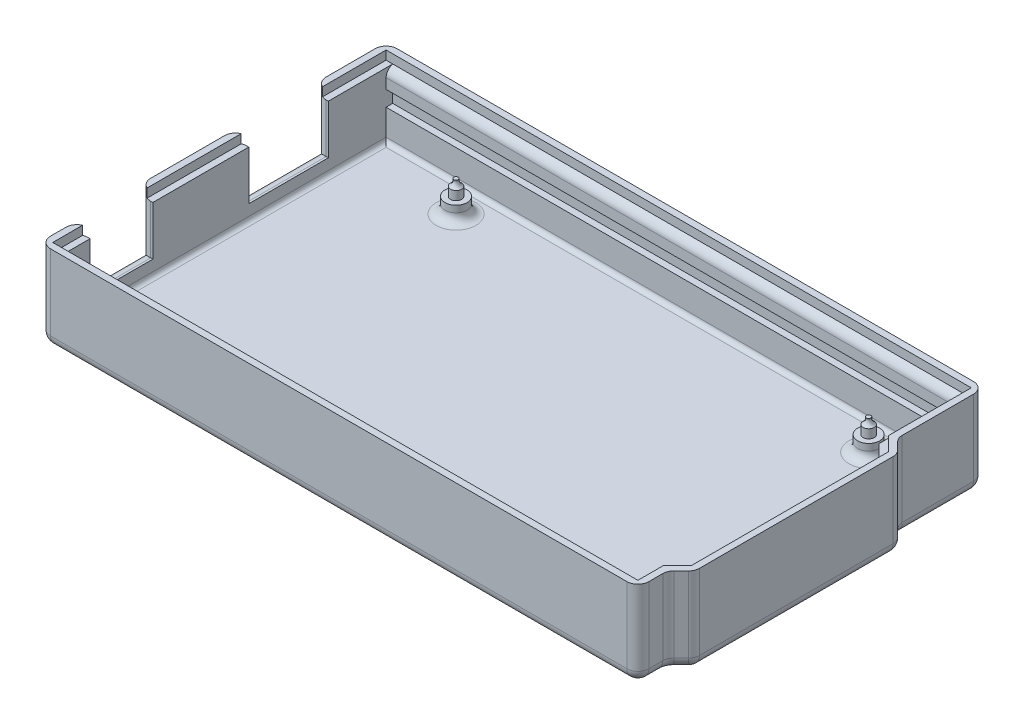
ISO-10303-21;
HEADER;
FILE_DESCRIPTION(('STEP AP214'),'2;1');
FILE_NAME('part.step','',(''),(''),'','','');
FILE_SCHEMA(('AUTOMOTIVE_DESIGN { 1 0 10303 214 1 1 1 1 }'));
ENDSEC;
DATA;
#1=APPLICATION_CONTEXT('core data for automotive mechanical design processes');
#2=APPLICATION_PROTOCOL_DEFINITION('international standard','automotive_design',2000,#1);
#3=PRODUCT_CONTEXT('',#1,'mechanical');
#4=PRODUCT('Part','Part','',(#3));
#5=PRODUCT_RELATED_PRODUCT_CATEGORY('part','',(#4));
#6=PRODUCT_DEFINITION_FORMATION('','',#4);
#7=PRODUCT_DEFINITION_CONTEXT('part definition',#1,'design');
#8=PRODUCT_DEFINITION('design','',#6,#7);
#9=PRODUCT_DEFINITION_SHAPE('','',#8);
#10=(LENGTH_UNIT() NAMED_UNIT(*) SI_UNIT(.MILLI.,.METRE.));
#11=(NAMED_UNIT(*) PLANE_ANGLE_UNIT() SI_UNIT($,.RADIAN.));
#12=(NAMED_UNIT(*) SI_UNIT($,.STERADIAN.) SOLID_ANGLE_UNIT());
#13=UNCERTAINTY_MEASURE_WITH_UNIT(LENGTH_MEASURE(1.E-05),#10,'distance_accuracy_value','');
#14=(GEOMETRIC_REPRESENTATION_CONTEXT(3) GLOBAL_UNCERTAINTY_ASSIGNED_CONTEXT((#13)) GLOBAL_UNIT_ASSIGNED_CONTEXT((#10,
#11,#12)) REPRESENTATION_CONTEXT('',''));
#15=CARTESIAN_POINT('',(0.,0.,0.));
#16=DIRECTION('',(0.,0.,1.));
#17=DIRECTION('',(1.,0.,0.));
#18=AXIS2_PLACEMENT_3D('',#15,#16,#17);
#19=CARTESIAN_POINT('',(0.,14.11,0.));
#20=DIRECTION('',(0.,-1.,0.));
#21=DIRECTION('',(0.,0.,-1.));
#22=AXIS2_PLACEMENT_3D('',#19,#20,#21);
#23=PLANE('',#22);
#24=DIRECTION('',(0.,0.,-1.));
#25=VECTOR('',#24,1.);
#26=CARTESIAN_POINT('',(71.3411254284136,14.11,26.521052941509));
#27=LINE('',#26,#25);
#28=CARTESIAN_POINT('',(71.3411254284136,14.11,31.6669403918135));
#29=VERTEX_POINT('',#28);
#30=CARTESIAN_POINT('',(71.3411254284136,14.11,26.521052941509));
#31=VERTEX_POINT('',#30);
#32=EDGE_CURVE('E746',#29,#31,#27,.T.);
#33=ORIENTED_EDGE('',*,*,#32,.F.);
#34=DIRECTION('',(1.,0.,0.));
#35=VECTOR('',#34,1.);
#36=CARTESIAN_POINT('',(72.5411254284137,14.11,31.6669403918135));
#37=LINE('',#36,#35);
#38=CARTESIAN_POINT('',(72.5411254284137,14.11,31.6669403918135));
#39=VERTEX_POINT('',#38);
#40=EDGE_CURVE('E666',#29,#39,#37,.T.);
#41=ORIENTED_EDGE('',*,*,#40,.T.);
#42=DIRECTION('',(0.,0.,-1.));
#43=VECTOR('',#42,1.);
#44=CARTESIAN_POINT('',(72.5411254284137,14.11,27.0181092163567));
#45=LINE('',#44,#43);
#46=CARTESIAN_POINT('',(72.5411254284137,14.11,27.0181092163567));
#47=VERTEX_POINT('',#46);
#48=EDGE_CURVE('E672',#39,#47,#45,.T.);
#49=ORIENTED_EDGE('',*,*,#48,.T.);
#50=DIRECTION('',(0.707106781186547,0.,-0.707106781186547));
#51=VECTOR('',#50,1.);
#52=CARTESIAN_POINT('',(75.0811254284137,14.11,24.4781092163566));
#53=LINE('',#52,#51);
#54=CARTESIAN_POINT('',(75.0811254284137,14.11,24.4781092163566));
#55=VERTEX_POINT('',#54);
#56=EDGE_CURVE('E676',#47,#55,#53,.T.);
#57=ORIENTED_EDGE('',*,*,#56,.T.);
#58=DIRECTION('',(0.,0.,-1.));
#59=VECTOR('',#58,1.);
#60=CARTESIAN_POINT('',(75.0811254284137,14.11,-11.2742284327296));
#61=LINE('',#60,#59);
#62=CARTESIAN_POINT('',(75.0811254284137,14.11,-11.2742284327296));
#63=VERTEX_POINT('',#62);
#64=EDGE_CURVE('E679',#55,#63,#61,.T.);
#65=ORIENTED_EDGE('',*,*,#64,.T.);
#66=DIRECTION('',(-0.707106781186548,0.,-0.707106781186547));
#67=VECTOR('',#66,1.);
#68=CARTESIAN_POINT('',(72.5411254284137,14.11,-13.8142284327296));
#69=LINE('',#68,#67);
#70=CARTESIAN_POINT('',(72.5411254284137,14.11,-13.8142284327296));
#71=VERTEX_POINT('',#70);
#72=EDGE_CURVE('E682',#63,#71,#69,.T.);
#73=ORIENTED_EDGE('',*,*,#72,.T.);
#74=DIRECTION('',(0.,0.,-1.));
#75=VECTOR('',#74,1.);
#76=CARTESIAN_POINT('',(72.5411254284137,14.11,-28.8730596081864));
#77=LINE('',#76,#75);
#78=CARTESIAN_POINT('',(72.5411254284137,14.11,-28.8730596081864));
#79=VERTEX_POINT('',#78);
#80=EDGE_CURVE('E685',#71,#79,#77,.T.);
#81=ORIENTED_EDGE('',*,*,#80,.T.);
#82=DIRECTION('',(-1.,0.,0.));
#83=VECTOR('',#82,1.);
#84=CARTESIAN_POINT('',(-33.7188745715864,14.11,-28.8730596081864));
#85=LINE('',#84,#83);
#86=CARTESIAN_POINT('',(71.3411254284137,14.11,-28.8730596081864));
#87=VERTEX_POINT('',#86);
#88=EDGE_CURVE('E689',#79,#87,#85,.T.);
#89=ORIENTED_EDGE('',*,*,#88,.T.);
#90=DIRECTION('',(0.,0.,-1.));
#91=VECTOR('',#90,1.);
#92=CARTESIAN_POINT('',(71.3411254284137,14.11,-27.6730596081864));
#93=LINE('',#92,#91);
#94=CARTESIAN_POINT('',(71.3411254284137,14.11,-13.3171721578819));
#95=VERTEX_POINT('',#94);
#96=EDGE_CURVE('E721',#95,#87,#93,.T.);
#97=ORIENTED_EDGE('',*,*,#96,.F.);
#98=DIRECTION('',(-0.707106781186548,0.,-0.707106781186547));
#99=VECTOR('',#98,1.);
#100=CARTESIAN_POINT('',(71.3411254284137,14.11,-13.3171721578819));
#101=LINE('',#100,#99);
#102=CARTESIAN_POINT('',(73.8811254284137,14.11,-10.7771721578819));
#103=VERTEX_POINT('',#102);
#104=EDGE_CURVE('E737',#103,#95,#101,.T.);
#105=ORIENTED_EDGE('',*,*,#104,.F.);
#106=DIRECTION('',(0.,0.,-1.));
#107=VECTOR('',#106,1.);
#108=CARTESIAN_POINT('',(73.8811254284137,14.11,-10.7771721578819));
#109=LINE('',#108,#107);
#110=CARTESIAN_POINT('',(73.8811254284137,14.11,23.9810529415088));
#111=VERTEX_POINT('',#110);
#112=EDGE_CURVE('E740',#111,#103,#109,.T.);
#113=ORIENTED_EDGE('',*,*,#112,.F.);
#114=DIRECTION('',(0.707106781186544,0.,-0.707106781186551));
#115=VECTOR('',#114,1.);
#116=CARTESIAN_POINT('',(73.8811254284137,14.11,23.9810529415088));
#117=LINE('',#116,#115);
#118=EDGE_CURVE('E743',#31,#111,#117,.T.);
#119=ORIENTED_EDGE('',*,*,#118,.F.);
#120=EDGE_LOOP('',(#33,#41,#49,#57,#65,#73,#81,#89,#97,#105,#113,#119));
#121=FACE_BOUND('',#120,.T.);
#122=ADVANCED_FACE('F90',(#121),#23,.F.);
#123=DIRECTION('',(0.,0.,1.));
#124=VECTOR('',#123,1.);
#125=CARTESIAN_POINT('',(-32.5188745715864,14.11,30.4669403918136));
#126=LINE('',#125,#124);
#127=CARTESIAN_POINT('',(-32.5188745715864,14.11,-28.8730596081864));
#128=VERTEX_POINT('',#127);
#129=CARTESIAN_POINT('',(-32.5188745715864,14.11,-17.1730596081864));
#130=VERTEX_POINT('',#129);
#131=EDGE_CURVE('E650',#128,#130,#126,.T.);
#132=ORIENTED_EDGE('',*,*,#131,.F.);
#133=CARTESIAN_POINT('',(-33.7188745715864,14.11,-28.8730596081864));
#134=VERTEX_POINT('',#133);
#135=EDGE_CURVE('E688',#128,#134,#85,.T.);
#136=ORIENTED_EDGE('',*,*,#135,.T.);
#137=DIRECTION('',(0.,0.,1.));
#138=VECTOR('',#137,1.);
#139=CARTESIAN_POINT('',(-33.7188745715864,14.11,31.6669403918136));
#140=LINE('',#139,#138);
#141=CARTESIAN_POINT('',(-33.7188745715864,14.11,-17.3400293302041));
#142=VERTEX_POINT('',#141);
#143=EDGE_CURVE('E663',#134,#142,#140,.T.);
#144=ORIENTED_EDGE('',*,*,#143,.T.);
#145=CARTESIAN_POINT('',(-32.9188745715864,14.11,-19.1730596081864));
#146=DIRECTION('',(0.,-1.,0.));
#147=DIRECTION('',(0.,0.,-1.));
#148=AXIS2_PLACEMENT_3D('',#145,#146,#147);
#149=CIRCLE('',#148,2.);
#150=CARTESIAN_POINT('',(-32.9188745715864,14.11,-17.1730596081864));
#151=VERTEX_POINT('',#150);
#152=EDGE_CURVE('E845',#142,#151,#149,.F.);
#153=ORIENTED_EDGE('',*,*,#152,.T.);
#154=DIRECTION('',(1.,0.,0.));
#155=VECTOR('',#154,1.);
#156=CARTESIAN_POINT('',(0.,14.11,-17.1730596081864));
#157=LINE('',#156,#155);
#158=EDGE_CURVE('E622',#151,#130,#157,.T.);
#159=ORIENTED_EDGE('',*,*,#158,.T.);
#160=EDGE_LOOP('',(#132,#136,#144,#153,#159));
#161=FACE_BOUND('',#160,.T.);
#162=ADVANCED_FACE('F1247',(#161),#23,.F.);
#163=CARTESIAN_POINT('',(71.3411254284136,15.71,30.4669403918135));
#164=DIRECTION('',(0.,0.,1.));
#165=DIRECTION('',(1.,0.,0.));
#166=AXIS2_PLACEMENT_3D('',#163,#164,#165);
#167=PLANE('',#166);
#168=DIRECTION('',(0.,-1.,0.));
#169=VECTOR('',#168,1.);
#170=CARTESIAN_POINT('',(-32.5188745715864,15.71,30.4669403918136));
#171=LINE('',#170,#169);
#172=CARTESIAN_POINT('',(-32.5188745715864,12.560806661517,30.4669403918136));
#173=VERTEX_POINT('',#172);
#174=CARTESIAN_POINT('',(-32.5188745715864,10.71,30.4669403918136));
#175=VERTEX_POINT('',#174);
#176=EDGE_CURVE('E770',#173,#175,#171,.T.);
#177=ORIENTED_EDGE('',*,*,#176,.F.);
#178=DIRECTION('',(-1.,0.,0.));
#179=VECTOR('',#178,1.);
#180=CARTESIAN_POINT('',(71.3411254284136,12.560806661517,30.4669403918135));
#181=LINE('',#180,#179);
#182=CARTESIAN_POINT('',(71.3411254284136,12.560806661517,30.4669403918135));
#183=VERTEX_POINT('',#182);
#184=EDGE_CURVE('E1094',#173,#183,#181,.F.);
#185=ORIENTED_EDGE('',*,*,#184,.T.);
#186=DIRECTION('',(0.,-1.,0.));
#187=VECTOR('',#186,1.);
#188=CARTESIAN_POINT('',(71.3411254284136,15.71,30.4669403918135));
#189=LINE('',#188,#187);
#190=CARTESIAN_POINT('',(71.3411254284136,10.71,30.4669403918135));
#191=VERTEX_POINT('',#190);
#192=EDGE_CURVE('E750',#183,#191,#189,.T.);
#193=ORIENTED_EDGE('',*,*,#192,.T.);
#194=DIRECTION('',(1.,0.,0.));
#195=VECTOR('',#194,1.);
#196=CARTESIAN_POINT('',(71.3411254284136,10.71,30.4669403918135));
#197=LINE('',#196,#195);
#198=EDGE_CURVE('E534',#175,#191,#197,.T.);
#199=ORIENTED_EDGE('',*,*,#198,.F.);
#200=EDGE_LOOP('',(#177,#185,#193,#199));
#201=FACE_BOUND('',#200,.T.);
#202=ADVANCED_FACE('F1227',(#201),#167,.F.);
#203=CARTESIAN_POINT('',(-32.5188745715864,15.71,-27.6730596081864));
#204=DIRECTION('',(0.,0.,-1.));
#205=DIRECTION('',(-1.,0.,0.));
#206=AXIS2_PLACEMENT_3D('',#203,#204,#205);
#207=PLANE('',#206);
#208=DIRECTION('',(0.,-1.,0.));
#209=VECTOR('',#208,1.);
#210=CARTESIAN_POINT('',(71.3411254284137,15.71,-27.6730596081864));
#211=LINE('',#210,#209);
#212=CARTESIAN_POINT('',(71.3411254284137,12.560806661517,-27.6730596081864));
#213=VERTEX_POINT('',#212);
#214=CARTESIAN_POINT('',(71.3411254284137,10.71,-27.6730596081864));
#215=VERTEX_POINT('',#214);
#216=EDGE_CURVE('E764',#213,#215,#211,.T.);
#217=ORIENTED_EDGE('',*,*,#216,.F.);
#218=DIRECTION('',(1.,0.,0.));
#219=VECTOR('',#218,1.);
#220=CARTESIAN_POINT('',(-32.5188745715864,12.560806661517,-27.6730596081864));
#221=LINE('',#220,#219);
#222=CARTESIAN_POINT('',(-32.5188745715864,12.560806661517,-27.6730596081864));
#223=VERTEX_POINT('',#222);
#224=EDGE_CURVE('E1118',#213,#223,#221,.F.);
#225=ORIENTED_EDGE('',*,*,#224,.T.);
#226=DIRECTION('',(0.,-1.,0.));
#227=VECTOR('',#226,1.);
#228=CARTESIAN_POINT('',(-32.5188745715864,15.71,-27.6730596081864));
#229=LINE('',#228,#227);
#230=CARTESIAN_POINT('',(-32.5188745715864,10.71,-27.6730596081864));
#231=VERTEX_POINT('',#230);
#232=EDGE_CURVE('E767',#223,#231,#229,.T.);
#233=ORIENTED_EDGE('',*,*,#232,.T.);
#234=DIRECTION('',(-1.,0.,0.));
#235=VECTOR('',#234,1.);
#236=CARTESIAN_POINT('',(-32.5188745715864,10.71,-27.6730596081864));
#237=LINE('',#236,#235);
#238=EDGE_CURVE('E555',#215,#231,#237,.T.);
#239=ORIENTED_EDGE('',*,*,#238,.F.);
#240=EDGE_LOOP('',(#217,#225,#233,#239));
#241=FACE_BOUND('',#240,.T.);
#242=ADVANCED_FACE('F1137',(#241),#207,.F.);
#243=CARTESIAN_POINT('',(0.,15.71,0.));
#244=DIRECTION('',(0.,-1.,0.));
#245=DIRECTION('',(0.,0.,-1.));
#246=AXIS2_PLACEMENT_3D('',#243,#244,#245);
#247=PLANE('',#246);
#248=DIRECTION('',(0.,0.,1.));
#249=VECTOR('',#248,1.);
#250=CARTESIAN_POINT('',(-33.7188745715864,15.71,31.6669403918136));
#251=LINE('',#250,#249);
#252=CARTESIAN_POINT('',(-33.7188745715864,15.71,26.2539101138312));
#253=VERTEX_POINT('',#252);
#254=CARTESIAN_POINT('',(-33.7188745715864,15.71,31.6669403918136));
#255=VERTEX_POINT('',#254);
#256=EDGE_CURVE('E662',#253,#255,#251,.T.);
#257=ORIENTED_EDGE('',*,*,#256,.F.);
#258=CARTESIAN_POINT('',(-32.9188745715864,15.71,28.0869403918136));
#259=DIRECTION('',(0.,-1.,0.));
#260=DIRECTION('',(0.,0.,-1.));
#261=AXIS2_PLACEMENT_3D('',#258,#259,#260);
#262=CIRCLE('',#261,2.);
#263=CARTESIAN_POINT('',(-34.9188745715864,15.71,28.0869403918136));
#264=VERTEX_POINT('',#263);
#265=EDGE_CURVE('E865',#253,#264,#262,.F.);
#266=ORIENTED_EDGE('',*,*,#265,.T.);
#267=DIRECTION('',(0.,0.,1.));
#268=VECTOR('',#267,1.);
#269=CARTESIAN_POINT('',(-34.9188745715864,15.71,-30.0730596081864));
#270=LINE('',#269,#268);
#271=CARTESIAN_POINT('',(-34.9188745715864,15.71,30.8669403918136));
#272=VERTEX_POINT('',#271);
#273=EDGE_CURVE('E792',#264,#272,#270,.T.);
#274=ORIENTED_EDGE('',*,*,#273,.T.);
#275=CARTESIAN_POINT('',(-32.9188745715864,15.71,30.8669403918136));
#276=DIRECTION('',(0.,-1.,0.));
#277=DIRECTION('',(0.,0.,-1.));
#278=AXIS2_PLACEMENT_3D('',#275,#276,#277);
#279=CIRCLE('',#278,2.);
#280=CARTESIAN_POINT('',(-32.9188745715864,15.71,32.8669403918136));
#281=VERTEX_POINT('',#280);
#282=EDGE_CURVE('E859',#272,#281,#279,.F.);
#283=ORIENTED_EDGE('',*,*,#282,.T.);
#284=DIRECTION('',(1.,0.,0.));
#285=VECTOR('',#284,1.);
#286=CARTESIAN_POINT('',(-34.9188745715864,15.71,32.8669403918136));
#287=LINE('',#286,#285);
#288=CARTESIAN_POINT('',(71.7411254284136,15.71,32.8669403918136));
#289=VERTEX_POINT('',#288);
#290=EDGE_CURVE('E789',#281,#289,#287,.T.);
#291=ORIENTED_EDGE('',*,*,#290,.T.);
#292=CARTESIAN_POINT('',(71.7411254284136,15.71,30.8669403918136));
#293=DIRECTION('',(0.,-1.,0.));
#294=DIRECTION('',(0.,0.,-1.));
#295=AXIS2_PLACEMENT_3D('',#292,#293,#294);
#296=CIRCLE('',#295,2.);
#297=CARTESIAN_POINT('',(73.7411254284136,15.71,30.8669403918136));
#298=VERTEX_POINT('',#297);
#299=EDGE_CURVE('E857',#289,#298,#296,.F.);
#300=ORIENTED_EDGE('',*,*,#299,.T.);
#301=DIRECTION('',(0.,0.,1.));
#302=VECTOR('',#301,1.);
#303=CARTESIAN_POINT('',(73.7411254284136,15.71,27.5151654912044));
#304=LINE('',#303,#302);
#305=CARTESIAN_POINT('',(73.7411254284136,15.71,28.3435926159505));
#306=VERTEX_POINT('',#305);
#307=EDGE_CURVE('E786',#306,#298,#304,.T.);
#308=ORIENTED_EDGE('',*,*,#307,.F.);
#309=CARTESIAN_POINT('',(75.7411254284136,15.71,28.3435926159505));
#310=DIRECTION('',(0.,-1.,0.));
#311=DIRECTION('',(0.,0.,-1.));
#312=AXIS2_PLACEMENT_3D('',#309,#310,#311);
#313=CIRCLE('',#312,2.);
#314=CARTESIAN_POINT('',(74.3269118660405,15.71,26.9293790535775));
#315=VERTEX_POINT('',#314);
#316=EDGE_CURVE('E944',#306,#315,#313,.T.);
#317=ORIENTED_EDGE('',*,*,#316,.T.);
#318=DIRECTION('',(-0.707106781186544,0.,0.707106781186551));
#319=VECTOR('',#318,1.);
#320=CARTESIAN_POINT('',(76.2464996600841,15.71,25.0097912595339));
#321=LINE('',#320,#319);
#322=CARTESIAN_POINT('',(75.6607132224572,15.71,25.5955776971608));
#323=VERTEX_POINT('',#322);
#324=EDGE_CURVE('E783',#323,#315,#321,.T.);
#325=ORIENTED_EDGE('',*,*,#324,.F.);
#326=CARTESIAN_POINT('',(74.2464996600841,15.71,24.1813641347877));
#327=DIRECTION('',(0.,-1.,0.));
#328=DIRECTION('',(0.,0.,-1.));
#329=AXIS2_PLACEMENT_3D('',#326,#327,#328);
#330=CIRCLE('',#329,2.);
#331=CARTESIAN_POINT('',(76.2464996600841,15.71,24.1813641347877));
#332=VERTEX_POINT('',#331);
#333=EDGE_CURVE('E851',#323,#332,#330,.F.);
#334=ORIENTED_EDGE('',*,*,#333,.T.);
#335=DIRECTION('',(0.,0.,1.));
#336=VECTOR('',#335,1.);
#337=CARTESIAN_POINT('',(76.246499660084,15.71,-11.805910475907));
#338=LINE('',#337,#336);
#339=CARTESIAN_POINT('',(76.246499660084,15.71,-10.9774833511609));
#340=VERTEX_POINT('',#339);
#341=EDGE_CURVE('E780',#340,#332,#338,.T.);
#342=ORIENTED_EDGE('',*,*,#341,.F.);
#343=CARTESIAN_POINT('',(74.246499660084,15.71,-10.9774833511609));
#344=DIRECTION('',(0.,-1.,0.));
#345=DIRECTION('',(0.,0.,-1.));
#346=AXIS2_PLACEMENT_3D('',#343,#344,#345);
#347=CIRCLE('',#346,2.);
#348=CARTESIAN_POINT('',(75.6607132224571,15.71,-12.391696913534));
#349=VERTEX_POINT('',#348);
#350=EDGE_CURVE('E853',#340,#349,#347,.F.);
#351=ORIENTED_EDGE('',*,*,#350,.T.);
#352=DIRECTION('',(0.707106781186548,0.,0.707106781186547));
#353=VECTOR('',#352,1.);
#354=CARTESIAN_POINT('',(73.7411254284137,15.71,-14.3112847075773));
#355=LINE('',#354,#353);
#356=CARTESIAN_POINT('',(74.3269118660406,15.71,-13.7254982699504));
#357=VERTEX_POINT('',#356);
#358=EDGE_CURVE('E777',#357,#349,#355,.T.);
#359=ORIENTED_EDGE('',*,*,#358,.F.);
#360=CARTESIAN_POINT('',(75.7411254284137,15.71,-15.1397118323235));
#361=DIRECTION('',(0.,-1.,0.));
#362=DIRECTION('',(0.,0.,-1.));
#363=AXIS2_PLACEMENT_3D('',#360,#361,#362);
#364=CIRCLE('',#363,2.);
#365=CARTESIAN_POINT('',(73.7411254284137,15.71,-15.1397118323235));
#366=VERTEX_POINT('',#365);
#367=EDGE_CURVE('E946',#357,#366,#364,.T.);
#368=ORIENTED_EDGE('',*,*,#367,.T.);
#369=DIRECTION('',(0.,0.,1.));
#370=VECTOR('',#369,1.);
#371=CARTESIAN_POINT('',(73.7411254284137,15.71,-30.0730596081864));
#372=LINE('',#371,#370);
#373=CARTESIAN_POINT('',(73.7411254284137,15.71,-28.0730596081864));
#374=VERTEX_POINT('',#373);
#375=EDGE_CURVE('E774',#374,#366,#372,.T.);
#376=ORIENTED_EDGE('',*,*,#375,.F.);
#377=CARTESIAN_POINT('',(71.7411254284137,15.71,-28.0730596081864));
#378=DIRECTION('',(0.,-1.,0.));
#379=DIRECTION('',(0.,0.,-1.));
#380=AXIS2_PLACEMENT_3D('',#377,#378,#379);
#381=CIRCLE('',#380,2.);
#382=CARTESIAN_POINT('',(71.7411254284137,15.71,-30.0730596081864));
#383=VERTEX_POINT('',#382);
#384=EDGE_CURVE('E855',#374,#383,#381,.F.);
#385=ORIENTED_EDGE('',*,*,#384,.T.);
#386=DIRECTION('',(1.,0.,0.));
#387=VECTOR('',#386,1.);
#388=CARTESIAN_POINT('',(-34.9188745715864,15.71,-30.0730596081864));
#389=LINE('',#388,#387);
#390=CARTESIAN_POINT('',(-32.9188745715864,15.71,-30.0730596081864));
#391=VERTEX_POINT('',#390);
#392=EDGE_CURVE('E752',#391,#383,#389,.T.);
#393=ORIENTED_EDGE('',*,*,#392,.F.);
#394=CARTESIAN_POINT('',(-32.9188745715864,15.71,-28.0730596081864));
#395=DIRECTION('',(0.,-1.,0.));
#396=DIRECTION('',(0.,0.,-1.));
#397=AXIS2_PLACEMENT_3D('',#394,#395,#396);
#398=CIRCLE('',#397,2.);
#399=CARTESIAN_POINT('',(-34.9188745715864,15.71,-28.0730596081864));
#400=VERTEX_POINT('',#399);
#401=EDGE_CURVE('E861',#391,#400,#398,.F.);
#402=ORIENTED_EDGE('',*,*,#401,.T.);
#403=CARTESIAN_POINT('',(-34.9188745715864,15.71,-19.1730596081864));
#404=VERTEX_POINT('',#403);
#405=EDGE_CURVE('E796',#400,#404,#270,.T.);
#406=ORIENTED_EDGE('',*,*,#405,.T.);
#407=CARTESIAN_POINT('',(-32.9188745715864,15.71,-19.1730596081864));
#408=DIRECTION('',(0.,-1.,0.));
#409=DIRECTION('',(0.,0.,-1.));
#410=AXIS2_PLACEMENT_3D('',#407,#408,#409);
#411=CIRCLE('',#410,2.);
#412=CARTESIAN_POINT('',(-33.7188745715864,15.71,-17.3400293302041));
#413=VERTEX_POINT('',#412);
#414=EDGE_CURVE('E863',#404,#413,#411,.F.);
#415=ORIENTED_EDGE('',*,*,#414,.T.);
#416=CARTESIAN_POINT('',(-33.7188745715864,15.71,-28.8730596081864));
#417=VERTEX_POINT('',#416);
#418=EDGE_CURVE('E694',#417,#413,#251,.T.);
#419=ORIENTED_EDGE('',*,*,#418,.F.);
#420=DIRECTION('',(-1.,0.,0.));
#421=VECTOR('',#420,1.);
#422=CARTESIAN_POINT('',(-33.7188745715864,15.71,-28.8730596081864));
#423=LINE('',#422,#421);
#424=CARTESIAN_POINT('',(72.5411254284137,15.71,-28.8730596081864));
#425=VERTEX_POINT('',#424);
#426=EDGE_CURVE('E716',#425,#417,#423,.T.);
#427=ORIENTED_EDGE('',*,*,#426,.F.);
#428=DIRECTION('',(0.,0.,-1.));
#429=VECTOR('',#428,1.);
#430=CARTESIAN_POINT('',(72.5411254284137,15.71,-28.8730596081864));
#431=LINE('',#430,#429);
#432=CARTESIAN_POINT('',(72.5411254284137,15.71,-13.8142284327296));
#433=VERTEX_POINT('',#432);
#434=EDGE_CURVE('E713',#433,#425,#431,.T.);
#435=ORIENTED_EDGE('',*,*,#434,.F.);
#436=DIRECTION('',(-0.707106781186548,0.,-0.707106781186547));
#437=VECTOR('',#436,1.);
#438=CARTESIAN_POINT('',(72.5411254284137,15.71,-13.8142284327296));
#439=LINE('',#438,#437);
#440=CARTESIAN_POINT('',(75.0811254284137,15.71,-11.2742284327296));
#441=VERTEX_POINT('',#440);
#442=EDGE_CURVE('E710',#441,#433,#439,.T.);
#443=ORIENTED_EDGE('',*,*,#442,.F.);
#444=DIRECTION('',(0.,0.,-1.));
#445=VECTOR('',#444,1.);
#446=CARTESIAN_POINT('',(75.0811254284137,15.71,-11.2742284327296));
#447=LINE('',#446,#445);
#448=CARTESIAN_POINT('',(75.0811254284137,15.71,24.4781092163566));
#449=VERTEX_POINT('',#448);
#450=EDGE_CURVE('E707',#449,#441,#447,.T.);
#451=ORIENTED_EDGE('',*,*,#450,.F.);
#452=DIRECTION('',(0.707106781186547,0.,-0.707106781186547));
#453=VECTOR('',#452,1.);
#454=CARTESIAN_POINT('',(75.0811254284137,15.71,24.4781092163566));
#455=LINE('',#454,#453);
#456=CARTESIAN_POINT('',(72.5411254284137,15.71,27.0181092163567));
#457=VERTEX_POINT('',#456);
#458=EDGE_CURVE('E704',#457,#449,#455,.T.);
#459=ORIENTED_EDGE('',*,*,#458,.F.);
#460=DIRECTION('',(0.,0.,-1.));
#461=VECTOR('',#460,1.);
#462=CARTESIAN_POINT('',(72.5411254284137,15.71,27.0181092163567));
#463=LINE('',#462,#461);
#464=CARTESIAN_POINT('',(72.5411254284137,15.71,31.6669403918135));
#465=VERTEX_POINT('',#464);
#466=EDGE_CURVE('E701',#465,#457,#463,.T.);
#467=ORIENTED_EDGE('',*,*,#466,.F.);
#468=DIRECTION('',(1.,0.,0.));
#469=VECTOR('',#468,1.);
#470=CARTESIAN_POINT('',(72.5411254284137,15.71,31.6669403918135));
#471=LINE('',#470,#469);
#472=EDGE_CURVE('E697',#255,#465,#471,.T.);
#473=ORIENTED_EDGE('',*,*,#472,.F.);
#474=EDGE_LOOP('',(#257,#266,#274,#283,#291,#300,#308,#317,#325,#334,#342,#351,#359,#368,#376,
#385,#393,#402,#406,#415,#419,#427,#435,#443,#451,#459,#467,#473));
#475=FACE_BOUND('',#474,.T.);
#476=ADVANCED_FACE('F1273',(#475),#247,.F.);
#477=CARTESIAN_POINT('',(-33.7188745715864,14.11,31.6669403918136));
#478=VERTEX_POINT('',#477);
#479=CARTESIAN_POINT('',(-32.5188745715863,14.11,31.6669403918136));
#480=VERTEX_POINT('',#479);
#481=EDGE_CURVE('E669',#478,#480,#37,.T.);
#482=ORIENTED_EDGE('',*,*,#481,.T.);
#483=CARTESIAN_POINT('',(-32.5188745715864,14.11,26.0869403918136));
#484=VERTEX_POINT('',#483);
#485=EDGE_CURVE('E800',#484,#480,#126,.T.);
#486=ORIENTED_EDGE('',*,*,#485,.F.);
#487=DIRECTION('',(-1.,0.,0.));
#488=VECTOR('',#487,1.);
#489=CARTESIAN_POINT('',(0.,14.11,26.0869403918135));
#490=LINE('',#489,#488);
#491=CARTESIAN_POINT('',(-32.9188745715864,14.11,26.0869403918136));
#492=VERTEX_POINT('',#491);
#493=EDGE_CURVE('E602',#484,#492,#490,.T.);
#494=ORIENTED_EDGE('',*,*,#493,.T.);
#495=CARTESIAN_POINT('',(-32.9188745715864,14.11,28.0869403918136));
#496=DIRECTION('',(0.,-1.,0.));
#497=DIRECTION('',(0.,0.,-1.));
#498=AXIS2_PLACEMENT_3D('',#495,#496,#497);
#499=CIRCLE('',#498,2.);
#500=CARTESIAN_POINT('',(-33.7188745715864,14.11,26.2539101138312));
#501=VERTEX_POINT('',#500);
#502=EDGE_CURVE('E847',#492,#501,#499,.F.);
#503=ORIENTED_EDGE('',*,*,#502,.T.);
#504=EDGE_CURVE('E668',#501,#478,#140,.T.);
#505=ORIENTED_EDGE('',*,*,#504,.T.);
#506=EDGE_LOOP('',(#482,#486,#494,#503,#505));
#507=FACE_BOUND('',#506,.T.);
#508=ADVANCED_FACE('F1254',(#507),#23,.F.);
#509=CARTESIAN_POINT('',(-33.7188745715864,14.11,31.6669403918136));
#510=DIRECTION('',(-1.,0.,0.));
#511=DIRECTION('',(0.,0.,1.));
#512=AXIS2_PLACEMENT_3D('',#509,#510,#511);
#513=PLANE('',#512);
#514=ORIENTED_EDGE('',*,*,#418,.T.);
#515=DIRECTION('',(0.,-1.,0.));
#516=VECTOR('',#515,1.);
#517=CARTESIAN_POINT('',(-33.7188745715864,15.71,-17.3400293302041));
#518=LINE('',#517,#516);
#519=EDGE_CURVE('E907',#413,#142,#518,.T.);
#520=ORIENTED_EDGE('',*,*,#519,.T.);
#521=ORIENTED_EDGE('',*,*,#143,.F.);
#522=DIRECTION('',(0.,1.,0.));
#523=VECTOR('',#522,1.);
#524=CARTESIAN_POINT('',(-33.7188745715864,14.11,-28.8730596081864));
#525=LINE('',#524,#523);
#526=EDGE_CURVE('E719',#134,#417,#525,.T.);
#527=ORIENTED_EDGE('',*,*,#526,.T.);
#528=EDGE_LOOP('',(#514,#520,#521,#527));
#529=FACE_BOUND('',#528,.T.);
#530=ADVANCED_FACE('F1266',(#529),#513,.F.);
#531=CARTESIAN_POINT('',(-33.7188745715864,15.71,-2.56608988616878));
#532=VERTEX_POINT('',#531);
#533=CARTESIAN_POINT('',(-33.7188745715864,15.71,14.5199706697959));
#534=VERTEX_POINT('',#533);
#535=EDGE_CURVE('E698',#532,#534,#251,.T.);
#536=ORIENTED_EDGE('',*,*,#535,.T.);
#537=DIRECTION('',(0.,-1.,0.));
#538=VECTOR('',#537,1.);
#539=CARTESIAN_POINT('',(-33.7188745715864,15.71,14.5199706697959));
#540=LINE('',#539,#538);
#541=CARTESIAN_POINT('',(-33.7188745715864,14.11,14.5199706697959));
#542=VERTEX_POINT('',#541);
#543=EDGE_CURVE('E894',#534,#542,#540,.T.);
#544=ORIENTED_EDGE('',*,*,#543,.T.);
#545=CARTESIAN_POINT('',(-33.7188745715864,14.11,-2.56608988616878));
#546=VERTEX_POINT('',#545);
#547=EDGE_CURVE('E667',#546,#542,#140,.T.);
#548=ORIENTED_EDGE('',*,*,#547,.F.);
#549=DIRECTION('',(0.,1.,0.));
#550=VECTOR('',#549,1.);
#551=CARTESIAN_POINT('',(-33.7188745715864,14.11,-2.56608988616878));
#552=LINE('',#551,#550);
#553=EDGE_CURVE('E892',#546,#532,#552,.T.);
#554=ORIENTED_EDGE('',*,*,#553,.T.);
#555=EDGE_LOOP('',(#536,#544,#548,#554));
#556=FACE_BOUND('',#555,.T.);
#557=ADVANCED_FACE('F1267',(#556),#513,.F.);
#558=CARTESIAN_POINT('',(-34.9188745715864,15.71,-30.0730596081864));
#559=DIRECTION('',(0.,0.,-1.));
#560=DIRECTION('',(-1.,0.,0.));
#561=AXIS2_PLACEMENT_3D('',#558,#559,#560);
#562=PLANE('',#561);
#563=DIRECTION('',(0.,-1.,0.));
#564=VECTOR('',#563,1.);
#565=CARTESIAN_POINT('',(71.7411254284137,15.71,-30.0730596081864));
#566=LINE('',#565,#564);
#567=CARTESIAN_POINT('',(71.7411254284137,2.,-30.0730596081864));
#568=VERTEX_POINT('',#567);
#569=EDGE_CURVE('E909',#383,#568,#566,.T.);
#570=ORIENTED_EDGE('',*,*,#569,.T.);
#571=DIRECTION('',(1.,0.,0.));
#572=VECTOR('',#571,1.);
#573=CARTESIAN_POINT('',(-34.9188745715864,2.,-30.0730596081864));
#574=LINE('',#573,#572);
#575=CARTESIAN_POINT('',(-32.9188745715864,2.,-30.0730596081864));
#576=VERTEX_POINT('',#575);
#577=EDGE_CURVE('E1012',#568,#576,#574,.F.);
#578=ORIENTED_EDGE('',*,*,#577,.T.);
#579=DIRECTION('',(0.,-1.,0.));
#580=VECTOR('',#579,1.);
#581=CARTESIAN_POINT('',(-32.9188745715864,15.71,-30.0730596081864));
#582=LINE('',#581,#580);
#583=EDGE_CURVE('E912',#576,#391,#582,.F.);
#584=ORIENTED_EDGE('',*,*,#583,.T.);
#585=ORIENTED_EDGE('',*,*,#392,.T.);
#586=EDGE_LOOP('',(#570,#578,#584,#585));
#587=FACE_BOUND('',#586,.T.);
#588=ADVANCED_FACE('F1475',(#587),#562,.T.);
#589=CARTESIAN_POINT('',(-34.9188745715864,15.71,-30.0730596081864));
#590=DIRECTION('',(1.,0.,0.));
#591=DIRECTION('',(0.,0.,-1.));
#592=AXIS2_PLACEMENT_3D('',#589,#590,#591);
#593=PLANE('',#592);
#594=DIRECTION('',(0.,-1.,0.));
#595=VECTOR('',#594,1.);
#596=CARTESIAN_POINT('',(-34.9188745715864,0.,-28.0730596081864));
#597=LINE('',#596,#595);
#598=CARTESIAN_POINT('',(-34.9188745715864,2.,-28.0730596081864));
#599=VERTEX_POINT('',#598);
#600=EDGE_CURVE('E869',#400,#599,#597,.T.);
#601=ORIENTED_EDGE('',*,*,#600,.T.);
#602=DIRECTION('',(0.,0.,1.));
#603=VECTOR('',#602,1.);
#604=CARTESIAN_POINT('',(-34.9188745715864,2.,30.8669403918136));
#605=LINE('',#604,#603);
#606=CARTESIAN_POINT('',(-34.9188745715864,2.,30.8669403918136));
#607=VERTEX_POINT('',#606);
#608=EDGE_CURVE('E1010',#599,#607,#605,.T.);
#609=ORIENTED_EDGE('',*,*,#608,.T.);
#610=DIRECTION('',(0.,-1.,0.));
#611=VECTOR('',#610,1.);
#612=CARTESIAN_POINT('',(-34.9188745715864,15.71,30.8669403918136));
#613=LINE('',#612,#611);
#614=EDGE_CURVE('E867',#607,#272,#613,.F.);
#615=ORIENTED_EDGE('',*,*,#614,.T.);
#616=ORIENTED_EDGE('',*,*,#273,.F.);
#617=DIRECTION('',(0.,1.,0.));
#618=VECTOR('',#617,1.);
#619=CARTESIAN_POINT('',(-34.9188745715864,15.71,28.0869403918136));
#620=LINE('',#619,#618);
#621=CARTESIAN_POINT('',(-34.9188745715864,3.2,28.0869403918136));
#622=VERTEX_POINT('',#621);
#623=EDGE_CURVE('E882',#264,#622,#620,.F.);
#624=ORIENTED_EDGE('',*,*,#623,.T.);
#625=DIRECTION('',(0.,0.,1.));
#626=VECTOR('',#625,1.);
#627=CARTESIAN_POINT('',(-34.9188745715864,3.2,-30.0730596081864));
#628=LINE('',#627,#626);
#629=CARTESIAN_POINT('',(-34.9188745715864,3.2,12.6869403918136));
#630=VERTEX_POINT('',#629);
#631=EDGE_CURVE('E880',#622,#630,#628,.F.);
#632=ORIENTED_EDGE('',*,*,#631,.T.);
#633=DIRECTION('',(0.,-1.,0.));
#634=VECTOR('',#633,1.);
#635=CARTESIAN_POINT('',(-34.9188745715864,15.71,12.6869403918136));
#636=LINE('',#635,#634);
#637=CARTESIAN_POINT('',(-34.9188745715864,15.71,12.6869403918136));
#638=VERTEX_POINT('',#637);
#639=EDGE_CURVE('E878',#630,#638,#636,.F.);
#640=ORIENTED_EDGE('',*,*,#639,.T.);
#641=CARTESIAN_POINT('',(-34.9188745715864,15.71,-0.73305960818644));
#642=VERTEX_POINT('',#641);
#643=EDGE_CURVE('E793',#642,#638,#270,.T.);
#644=ORIENTED_EDGE('',*,*,#643,.F.);
#645=DIRECTION('',(0.,1.,0.));
#646=VECTOR('',#645,1.);
#647=CARTESIAN_POINT('',(-34.9188745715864,15.71,-0.73305960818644));
#648=LINE('',#647,#646);
#649=CARTESIAN_POINT('',(-34.9188745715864,3.2,-0.733059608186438));
#650=VERTEX_POINT('',#649);
#651=EDGE_CURVE('E876',#642,#650,#648,.F.);
#652=ORIENTED_EDGE('',*,*,#651,.T.);
#653=DIRECTION('',(0.,0.,1.));
#654=VECTOR('',#653,1.);
#655=CARTESIAN_POINT('',(-34.9188745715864,3.2,-30.0730596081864));
#656=LINE('',#655,#654);
#657=CARTESIAN_POINT('',(-34.9188745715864,3.2,-19.1730596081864));
#658=VERTEX_POINT('',#657);
#659=EDGE_CURVE('E874',#650,#658,#656,.F.);
#660=ORIENTED_EDGE('',*,*,#659,.T.);
#661=DIRECTION('',(0.,-1.,0.));
#662=VECTOR('',#661,1.);
#663=CARTESIAN_POINT('',(-34.9188745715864,15.71,-19.1730596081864));
#664=LINE('',#663,#662);
#665=EDGE_CURVE('E872',#658,#404,#664,.F.);
#666=ORIENTED_EDGE('',*,*,#665,.T.);
#667=ORIENTED_EDGE('',*,*,#405,.F.);
#668=EDGE_LOOP('',(#601,#609,#615,#616,#624,#632,#640,#644,#652,#660,#666,#667));
#669=FACE_BOUND('',#668,.T.);
#670=ADVANCED_FACE('F1483',(#669),#593,.F.);
#671=CARTESIAN_POINT('',(-34.9188745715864,15.71,32.8669403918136));
#672=DIRECTION('',(0.,0.,-1.));
#673=DIRECTION('',(-1.,0.,0.));
#674=AXIS2_PLACEMENT_3D('',#671,#672,#673);
#675=PLANE('',#674);
#676=DIRECTION('',(0.,-1.,0.));
#677=VECTOR('',#676,1.);
#678=CARTESIAN_POINT('',(-32.9188745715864,15.71,32.8669403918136));
#679=LINE('',#678,#677);
#680=CARTESIAN_POINT('',(-32.9188745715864,2.,32.8669403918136));
#681=VERTEX_POINT('',#680);
#682=EDGE_CURVE('E916',#281,#681,#679,.T.);
#683=ORIENTED_EDGE('',*,*,#682,.T.);
#684=DIRECTION('',(1.,0.,0.));
#685=VECTOR('',#684,1.);
#686=CARTESIAN_POINT('',(71.7411254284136,2.,32.8669403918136));
#687=LINE('',#686,#685);
#688=CARTESIAN_POINT('',(71.7411254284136,2.,32.8669403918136));
#689=VERTEX_POINT('',#688);
#690=EDGE_CURVE('E1008',#681,#689,#687,.T.);
#691=ORIENTED_EDGE('',*,*,#690,.T.);
#692=DIRECTION('',(0.,-1.,0.));
#693=VECTOR('',#692,1.);
#694=CARTESIAN_POINT('',(71.7411254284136,15.71,32.8669403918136));
#695=LINE('',#694,#693);
#696=EDGE_CURVE('E914',#689,#289,#695,.F.);
#697=ORIENTED_EDGE('',*,*,#696,.T.);
#698=ORIENTED_EDGE('',*,*,#290,.F.);
#699=EDGE_LOOP('',(#683,#691,#697,#698));
#700=FACE_BOUND('',#699,.T.);
#701=ADVANCED_FACE('F1370',(#700),#675,.F.);
#702=CARTESIAN_POINT('',(73.7411254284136,15.71,27.5151654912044));
#703=DIRECTION('',(1.,0.,0.));
#704=DIRECTION('',(0.,0.,-1.));
#705=AXIS2_PLACEMENT_3D('',#702,#703,#704);
#706=PLANE('',#705);
#707=DIRECTION('',(0.,-1.,0.));
#708=VECTOR('',#707,1.);
#709=CARTESIAN_POINT('',(73.7411254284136,0.,30.8669403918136));
#710=LINE('',#709,#708);
#711=CARTESIAN_POINT('',(73.7411254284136,2.,30.8669403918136));
#712=VERTEX_POINT('',#711);
#713=EDGE_CURVE('E921',#298,#712,#710,.T.);
#714=ORIENTED_EDGE('',*,*,#713,.T.);
#715=DIRECTION('',(0.,0.,1.));
#716=VECTOR('',#715,1.);
#717=CARTESIAN_POINT('',(73.7411254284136,2.,27.5151654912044));
#718=LINE('',#717,#716);
#719=CARTESIAN_POINT('',(73.7411254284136,2.,28.3435926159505));
#720=VERTEX_POINT('',#719);
#721=EDGE_CURVE('E1000',#712,#720,#718,.F.);
#722=ORIENTED_EDGE('',*,*,#721,.T.);
#723=DIRECTION('',(0.,-1.,0.));
#724=VECTOR('',#723,1.);
#725=CARTESIAN_POINT('',(73.7411254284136,15.71,28.3435926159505));
#726=LINE('',#725,#724);
#727=EDGE_CURVE('E919',#720,#306,#726,.F.);
#728=ORIENTED_EDGE('',*,*,#727,.T.);
#729=ORIENTED_EDGE('',*,*,#307,.T.);
#730=EDGE_LOOP('',(#714,#722,#728,#729));
#731=FACE_BOUND('',#730,.T.);
#732=ADVANCED_FACE('F1403',(#731),#706,.T.);
#733=CARTESIAN_POINT('',(76.2464996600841,15.71,25.0097912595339));
#734=DIRECTION('',(0.707106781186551,0.,0.707106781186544));
#735=DIRECTION('',(0.707106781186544,0.,-0.707106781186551));
#736=AXIS2_PLACEMENT_3D('',#733,#734,#735);
#737=PLANE('',#736);
#738=DIRECTION('',(0.,-1.,0.));
#739=VECTOR('',#738,1.);
#740=CARTESIAN_POINT('',(74.3269118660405,0.,26.9293790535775));
#741=LINE('',#740,#739);
#742=CARTESIAN_POINT('',(74.3269118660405,2.,26.9293790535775));
#743=VERTEX_POINT('',#742);
#744=EDGE_CURVE('E926',#315,#743,#741,.T.);
#745=ORIENTED_EDGE('',*,*,#744,.T.);
#746=DIRECTION('',(-0.707106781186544,0.,0.707106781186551));
#747=VECTOR('',#746,1.);
#748=CARTESIAN_POINT('',(76.2464996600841,2.,25.0097912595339));
#749=LINE('',#748,#747);
#750=CARTESIAN_POINT('',(75.6607132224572,2.,25.5955776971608));
#751=VERTEX_POINT('',#750);
#752=EDGE_CURVE('E996',#743,#751,#749,.F.);
#753=ORIENTED_EDGE('',*,*,#752,.T.);
#754=DIRECTION('',(0.,-1.,0.));
#755=VECTOR('',#754,1.);
#756=CARTESIAN_POINT('',(75.6607132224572,15.71,25.5955776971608));
#757=LINE('',#756,#755);
#758=EDGE_CURVE('E924',#751,#323,#757,.F.);
#759=ORIENTED_EDGE('',*,*,#758,.T.);
#760=ORIENTED_EDGE('',*,*,#324,.T.);
#761=EDGE_LOOP('',(#745,#753,#759,#760));
#762=FACE_BOUND('',#761,.T.);
#763=ADVANCED_FACE('F1414',(#762),#737,.T.);
#764=CARTESIAN_POINT('',(76.246499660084,15.71,-11.805910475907));
#765=DIRECTION('',(1.,0.,0.));
#766=DIRECTION('',(0.,0.,-1.));
#767=AXIS2_PLACEMENT_3D('',#764,#765,#766);
#768=PLANE('',#767);
#769=DIRECTION('',(0.,-1.,0.));
#770=VECTOR('',#769,1.);
#771=CARTESIAN_POINT('',(76.2464996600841,15.71,24.1813641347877));
#772=LINE('',#771,#770);
#773=CARTESIAN_POINT('',(76.2464996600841,2.,24.1813641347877));
#774=VERTEX_POINT('',#773);
#775=EDGE_CURVE('E939',#332,#774,#772,.T.);
#776=ORIENTED_EDGE('',*,*,#775,.T.);
#777=DIRECTION('',(0.,0.,1.));
#778=VECTOR('',#777,1.);
#779=CARTESIAN_POINT('',(76.246499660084,2.,-11.805910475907));
#780=LINE('',#779,#778);
#781=CARTESIAN_POINT('',(76.246499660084,2.,-10.9774833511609));
#782=VERTEX_POINT('',#781);
#783=EDGE_CURVE('E992',#774,#782,#780,.F.);
#784=ORIENTED_EDGE('',*,*,#783,.T.);
#785=DIRECTION('',(0.,-1.,0.));
#786=VECTOR('',#785,1.);
#787=CARTESIAN_POINT('',(76.246499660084,15.71,-10.9774833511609));
#788=LINE('',#787,#786);
#789=EDGE_CURVE('E942',#782,#340,#788,.F.);
#790=ORIENTED_EDGE('',*,*,#789,.T.);
#791=ORIENTED_EDGE('',*,*,#341,.T.);
#792=EDGE_LOOP('',(#776,#784,#790,#791));
#793=FACE_BOUND('',#792,.T.);
#794=ADVANCED_FACE('F1433',(#793),#768,.T.);
#795=CARTESIAN_POINT('',(73.7411254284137,15.71,-14.3112847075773));
#796=DIRECTION('',(0.707106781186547,0.,-0.707106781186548));
#797=DIRECTION('',(-0.707106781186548,0.,-0.707106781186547));
#798=AXIS2_PLACEMENT_3D('',#795,#796,#797);
#799=PLANE('',#798);
#800=DIRECTION('',(0.,-1.,0.));
#801=VECTOR('',#800,1.);
#802=CARTESIAN_POINT('',(75.6607132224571,15.71,-12.391696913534));
#803=LINE('',#802,#801);
#804=CARTESIAN_POINT('',(75.6607132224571,2.,-12.391696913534));
#805=VERTEX_POINT('',#804);
#806=EDGE_CURVE('E934',#349,#805,#803,.T.);
#807=ORIENTED_EDGE('',*,*,#806,.T.);
#808=DIRECTION('',(0.707106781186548,0.,0.707106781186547));
#809=VECTOR('',#808,1.);
#810=CARTESIAN_POINT('',(73.7411254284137,2.,-14.3112847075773));
#811=LINE('',#810,#809);
#812=CARTESIAN_POINT('',(74.3269118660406,2.,-13.7254982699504));
#813=VERTEX_POINT('',#812);
#814=EDGE_CURVE('E988',#805,#813,#811,.F.);
#815=ORIENTED_EDGE('',*,*,#814,.T.);
#816=DIRECTION('',(0.,-1.,0.));
#817=VECTOR('',#816,1.);
#818=CARTESIAN_POINT('',(74.3269118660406,15.71,-13.7254982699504));
#819=LINE('',#818,#817);
#820=EDGE_CURVE('E937',#813,#357,#819,.F.);
#821=ORIENTED_EDGE('',*,*,#820,.T.);
#822=ORIENTED_EDGE('',*,*,#358,.T.);
#823=EDGE_LOOP('',(#807,#815,#821,#822));
#824=FACE_BOUND('',#823,.T.);
#825=ADVANCED_FACE('F1445',(#824),#799,.T.);
#826=CARTESIAN_POINT('',(73.7411254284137,15.71,-30.0730596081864));
#827=DIRECTION('',(1.,0.,0.));
#828=DIRECTION('',(0.,0.,-1.));
#829=AXIS2_PLACEMENT_3D('',#826,#827,#828);
#830=PLANE('',#829);
#831=DIRECTION('',(0.,-1.,0.));
#832=VECTOR('',#831,1.);
#833=CARTESIAN_POINT('',(73.7411254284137,0.,-15.1397118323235));
#834=LINE('',#833,#832);
#835=CARTESIAN_POINT('',(73.7411254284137,2.,-15.1397118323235));
#836=VERTEX_POINT('',#835);
#837=EDGE_CURVE('E929',#366,#836,#834,.T.);
#838=ORIENTED_EDGE('',*,*,#837,.T.);
#839=DIRECTION('',(0.,0.,1.));
#840=VECTOR('',#839,1.);
#841=CARTESIAN_POINT('',(73.7411254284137,2.,-30.0730596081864));
#842=LINE('',#841,#840);
#843=CARTESIAN_POINT('',(73.7411254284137,2.,-28.0730596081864));
#844=VERTEX_POINT('',#843);
#845=EDGE_CURVE('E984',#836,#844,#842,.F.);
#846=ORIENTED_EDGE('',*,*,#845,.T.);
#847=DIRECTION('',(0.,-1.,0.));
#848=VECTOR('',#847,1.);
#849=CARTESIAN_POINT('',(73.7411254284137,15.71,-28.0730596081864));
#850=LINE('',#849,#848);
#851=EDGE_CURVE('E932',#844,#374,#850,.F.);
#852=ORIENTED_EDGE('',*,*,#851,.T.);
#853=ORIENTED_EDGE('',*,*,#375,.T.);
#854=EDGE_LOOP('',(#838,#846,#852,#853));
#855=FACE_BOUND('',#854,.T.);
#856=ADVANCED_FACE('F1465',(#855),#830,.T.);
#857=ORIENTED_EDGE('',*,*,#643,.T.);
#858=CARTESIAN_POINT('',(-32.9188745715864,15.71,12.6869403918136));
#859=DIRECTION('',(0.,-1.,0.));
#860=DIRECTION('',(0.,0.,-1.));
#861=AXIS2_PLACEMENT_3D('',#858,#859,#860);
#862=CIRCLE('',#861,2.);
#863=EDGE_CURVE('E890',#638,#534,#862,.F.);
#864=ORIENTED_EDGE('',*,*,#863,.T.);
#865=ORIENTED_EDGE('',*,*,#535,.F.);
#866=CARTESIAN_POINT('',(-32.9188745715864,15.71,-0.73305960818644));
#867=DIRECTION('',(0.,-1.,0.));
#868=DIRECTION('',(0.,0.,-1.));
#869=AXIS2_PLACEMENT_3D('',#866,#867,#868);
#870=CIRCLE('',#869,2.);
#871=EDGE_CURVE('E888',#532,#642,#870,.F.);
#872=ORIENTED_EDGE('',*,*,#871,.T.);
#873=EDGE_LOOP('',(#857,#864,#865,#872));
#874=FACE_BOUND('',#873,.T.);
#875=ADVANCED_FACE('F1268',(#874),#247,.F.);
#876=CARTESIAN_POINT('',(0.,0.,0.));
#877=DIRECTION('',(0.,-1.,0.));
#878=DIRECTION('',(0.,0.,-1.));
#879=AXIS2_PLACEMENT_3D('',#876,#877,#878);
#880=PLANE('',#879);
#881=DIRECTION('',(1.,0.,0.));
#882=VECTOR('',#881,1.);
#883=CARTESIAN_POINT('',(0.,0.,-28.0730596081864));
#884=LINE('',#883,#882);
#885=CARTESIAN_POINT('',(-32.9188745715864,0.,-28.0730596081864));
#886=VERTEX_POINT('',#885);
#887=CARTESIAN_POINT('',(71.7411254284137,0.,-28.0730596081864));
#888=VERTEX_POINT('',#887);
#889=EDGE_CURVE('E963',#886,#888,#884,.T.);
#890=ORIENTED_EDGE('',*,*,#889,.T.);
#891=DIRECTION('',(0.,0.,1.));
#892=VECTOR('',#891,1.);
#893=CARTESIAN_POINT('',(71.7411254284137,0.,0.));
#894=LINE('',#893,#892);
#895=CARTESIAN_POINT('',(71.7411254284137,0.,-15.1397118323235));
#896=VERTEX_POINT('',#895);
#897=EDGE_CURVE('E981',#888,#896,#894,.T.);
#898=ORIENTED_EDGE('',*,*,#897,.T.);
#899=CARTESIAN_POINT('',(75.7411254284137,0.,-15.1397118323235));
#900=DIRECTION('',(0.,-1.,0.));
#901=DIRECTION('',(0.,0.,-1.));
#902=AXIS2_PLACEMENT_3D('',#899,#900,#901);
#903=CIRCLE('',#902,4.);
#904=CARTESIAN_POINT('',(72.9126983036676,0.,-12.3112847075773));
#905=VERTEX_POINT('',#904);
#906=EDGE_CURVE('E979',#896,#905,#903,.F.);
#907=ORIENTED_EDGE('',*,*,#906,.T.);
#908=DIRECTION('',(0.707106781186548,0.,0.707106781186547));
#909=VECTOR('',#908,1.);
#910=CARTESIAN_POINT('',(42.6119915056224,0.,-42.6119915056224));
#911=LINE('',#910,#909);
#912=CARTESIAN_POINT('',(74.246499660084,0.,-10.9774833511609));
#913=VERTEX_POINT('',#912);
#914=EDGE_CURVE('E977',#905,#913,#911,.T.);
#915=ORIENTED_EDGE('',*,*,#914,.T.);
#916=DIRECTION('',(0.,0.,1.));
#917=VECTOR('',#916,1.);
#918=CARTESIAN_POINT('',(74.246499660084,0.,-1.11949751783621E-13));
#919=LINE('',#918,#917);
#920=CARTESIAN_POINT('',(74.2464996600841,0.,24.1813641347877));
#921=VERTEX_POINT('',#920);
#922=EDGE_CURVE('E975',#913,#921,#919,.T.);
#923=ORIENTED_EDGE('',*,*,#922,.T.);
#924=DIRECTION('',(-0.707106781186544,0.,0.707106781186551));
#925=VECTOR('',#924,1.);
#926=CARTESIAN_POINT('',(49.2139318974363,0.,49.2139318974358));
#927=LINE('',#926,#925);
#928=CARTESIAN_POINT('',(72.9126983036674,0.,25.5151654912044));
#929=VERTEX_POINT('',#928);
#930=EDGE_CURVE('E973',#921,#929,#927,.T.);
#931=ORIENTED_EDGE('',*,*,#930,.T.);
#932=CARTESIAN_POINT('',(75.7411254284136,0.,28.3435926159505));
#933=DIRECTION('',(0.,-1.,0.));
#934=DIRECTION('',(0.,0.,-1.));
#935=AXIS2_PLACEMENT_3D('',#932,#933,#934);
#936=CIRCLE('',#935,4.);
#937=CARTESIAN_POINT('',(71.7411254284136,0.,28.3435926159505));
#938=VERTEX_POINT('',#937);
#939=EDGE_CURVE('E971',#929,#938,#936,.F.);
#940=ORIENTED_EDGE('',*,*,#939,.T.);
#941=DIRECTION('',(0.,0.,1.));
#942=VECTOR('',#941,1.);
#943=CARTESIAN_POINT('',(71.7411254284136,0.,0.));
#944=LINE('',#943,#942);
#945=CARTESIAN_POINT('',(71.7411254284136,0.,30.8669403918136));
#946=VERTEX_POINT('',#945);
#947=EDGE_CURVE('E969',#938,#946,#944,.T.);
#948=ORIENTED_EDGE('',*,*,#947,.T.);
#949=DIRECTION('',(1.,0.,0.));
#950=VECTOR('',#949,1.);
#951=CARTESIAN_POINT('',(-32.9188745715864,0.,30.8669403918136));
#952=LINE('',#951,#950);
#953=CARTESIAN_POINT('',(-32.9188745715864,0.,30.8669403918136));
#954=VERTEX_POINT('',#953);
#955=EDGE_CURVE('E967',#946,#954,#952,.F.);
#956=ORIENTED_EDGE('',*,*,#955,.T.);
#957=DIRECTION('',(0.,0.,1.));
#958=VECTOR('',#957,1.);
#959=CARTESIAN_POINT('',(-32.9188745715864,0.,-28.0730596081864));
#960=LINE('',#959,#958);
#961=EDGE_CURVE('E965',#954,#886,#960,.F.);
#962=ORIENTED_EDGE('',*,*,#961,.T.);
#963=EDGE_LOOP('',(#890,#898,#907,#915,#923,#931,#940,#948,#956,#962));
#964=FACE_BOUND('',#963,.T.);
#965=ADVANCED_FACE('F1258',(#964),#880,.T.);
#966=ORIENTED_EDGE('',*,*,#547,.T.);
#967=CARTESIAN_POINT('',(-32.9188745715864,14.11,12.6869403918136));
#968=DIRECTION('',(0.,-1.,0.));
#969=DIRECTION('',(0.,0.,-1.));
#970=AXIS2_PLACEMENT_3D('',#967,#968,#969);
#971=CIRCLE('',#970,2.);
#972=CARTESIAN_POINT('',(-32.9188745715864,14.11,14.6869403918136));
#973=VERTEX_POINT('',#972);
#974=EDGE_CURVE('E898',#542,#973,#971,.F.);
#975=ORIENTED_EDGE('',*,*,#974,.T.);
#976=DIRECTION('',(1.,0.,0.));
#977=VECTOR('',#976,1.);
#978=CARTESIAN_POINT('',(0.,14.11,14.6869403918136));
#979=LINE('',#978,#977);
#980=CARTESIAN_POINT('',(-32.5188745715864,14.11,14.6869403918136));
#981=VERTEX_POINT('',#980);
#982=EDGE_CURVE('E617',#973,#981,#979,.T.);
#983=ORIENTED_EDGE('',*,*,#982,.T.);
#984=CARTESIAN_POINT('',(-32.5188745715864,14.11,-2.73305960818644));
#985=VERTEX_POINT('',#984);
#986=EDGE_CURVE('E799',#985,#981,#126,.T.);
#987=ORIENTED_EDGE('',*,*,#986,.F.);
#988=DIRECTION('',(-1.,0.,0.));
#989=VECTOR('',#988,1.);
#990=CARTESIAN_POINT('',(0.,14.11,-2.73305960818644));
#991=LINE('',#990,#989);
#992=CARTESIAN_POINT('',(-32.9188745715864,14.11,-2.73305960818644));
#993=VERTEX_POINT('',#992);
#994=EDGE_CURVE('E619',#985,#993,#991,.T.);
#995=ORIENTED_EDGE('',*,*,#994,.T.);
#996=CARTESIAN_POINT('',(-32.9188745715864,14.11,-0.73305960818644));
#997=DIRECTION('',(0.,-1.,0.));
#998=DIRECTION('',(0.,0.,-1.));
#999=AXIS2_PLACEMENT_3D('',#996,#997,#998);
#1000=CIRCLE('',#999,2.);
#1001=EDGE_CURVE('E896',#993,#546,#1000,.F.);
#1002=ORIENTED_EDGE('',*,*,#1001,.T.);
#1003=EDGE_LOOP('',(#966,#975,#983,#987,#995,#1002));
#1004=FACE_BOUND('',#1003,.T.);
#1005=ADVANCED_FACE('F1250',(#1004),#23,.F.);
#1006=ORIENTED_EDGE('',*,*,#504,.F.);
#1007=DIRECTION('',(0.,1.,0.));
#1008=VECTOR('',#1007,1.);
#1009=CARTESIAN_POINT('',(-33.7188745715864,14.11,26.2539101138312));
#1010=LINE('',#1009,#1008);
#1011=EDGE_CURVE('E849',#501,#253,#1010,.T.);
#1012=ORIENTED_EDGE('',*,*,#1011,.T.);
#1013=ORIENTED_EDGE('',*,*,#256,.T.);
#1014=DIRECTION('',(0.,1.,0.));
#1015=VECTOR('',#1014,1.);
#1016=CARTESIAN_POINT('',(-33.7188745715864,14.11,31.6669403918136));
#1017=LINE('',#1016,#1015);
#1018=EDGE_CURVE('E692',#478,#255,#1017,.T.);
#1019=ORIENTED_EDGE('',*,*,#1018,.F.);
#1020=EDGE_LOOP('',(#1006,#1012,#1013,#1019));
#1021=FACE_BOUND('',#1020,.T.);
#1022=ADVANCED_FACE('F1257',(#1021),#513,.F.);
#1023=CARTESIAN_POINT('',(-33.7188745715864,14.11,-28.8730596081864));
#1024=DIRECTION('',(0.,0.,-1.));
#1025=DIRECTION('',(-1.,0.,0.));
#1026=AXIS2_PLACEMENT_3D('',#1023,#1024,#1025);
#1027=PLANE('',#1026);
#1028=ORIENTED_EDGE('',*,*,#426,.T.);
#1029=ORIENTED_EDGE('',*,*,#526,.F.);
#1030=ORIENTED_EDGE('',*,*,#135,.F.);
#1031=EDGE_CURVE('E693',#87,#128,#85,.T.);
#1032=ORIENTED_EDGE('',*,*,#1031,.F.);
#1033=ORIENTED_EDGE('',*,*,#88,.F.);
#1034=DIRECTION('',(0.,1.,0.));
#1035=VECTOR('',#1034,1.);
#1036=CARTESIAN_POINT('',(72.5411254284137,14.11,-28.8730596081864));
#1037=LINE('',#1036,#1035);
#1038=EDGE_CURVE('E722',#79,#425,#1037,.T.);
#1039=ORIENTED_EDGE('',*,*,#1038,.T.);
#1040=EDGE_LOOP('',(#1028,#1029,#1030,#1032,#1033,#1039));
#1041=FACE_BOUND('',#1040,.T.);
#1042=ADVANCED_FACE('F1132',(#1041),#1027,.F.);
#1043=CARTESIAN_POINT('',(72.5411254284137,14.11,-28.8730596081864));
#1044=DIRECTION('',(1.,0.,0.));
#1045=DIRECTION('',(0.,0.,-1.));
#1046=AXIS2_PLACEMENT_3D('',#1043,#1044,#1045);
#1047=PLANE('',#1046);
#1048=ORIENTED_EDGE('',*,*,#434,.T.);
#1049=ORIENTED_EDGE('',*,*,#1038,.F.);
#1050=ORIENTED_EDGE('',*,*,#80,.F.);
#1051=DIRECTION('',(0.,1.,0.));
#1052=VECTOR('',#1051,1.);
#1053=CARTESIAN_POINT('',(72.5411254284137,14.11,-13.8142284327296));
#1054=LINE('',#1053,#1052);
#1055=EDGE_CURVE('E724',#71,#433,#1054,.T.);
#1056=ORIENTED_EDGE('',*,*,#1055,.T.);
#1057=EDGE_LOOP('',(#1048,#1049,#1050,#1056));
#1058=FACE_BOUND('',#1057,.T.);
#1059=ADVANCED_FACE('F1306',(#1058),#1047,.F.);
#1060=CARTESIAN_POINT('',(72.5411254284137,14.11,-13.8142284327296));
#1061=DIRECTION('',(0.707106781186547,0.,-0.707106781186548));
#1062=DIRECTION('',(-0.707106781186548,0.,-0.707106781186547));
#1063=AXIS2_PLACEMENT_3D('',#1060,#1061,#1062);
#1064=PLANE('',#1063);
#1065=ORIENTED_EDGE('',*,*,#442,.T.);
#1066=ORIENTED_EDGE('',*,*,#1055,.F.);
#1067=ORIENTED_EDGE('',*,*,#72,.F.);
#1068=DIRECTION('',(0.,1.,0.));
#1069=VECTOR('',#1068,1.);
#1070=CARTESIAN_POINT('',(75.0811254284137,14.11,-11.2742284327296));
#1071=LINE('',#1070,#1069);
#1072=EDGE_CURVE('E726',#63,#441,#1071,.T.);
#1073=ORIENTED_EDGE('',*,*,#1072,.T.);
#1074=EDGE_LOOP('',(#1065,#1066,#1067,#1073));
#1075=FACE_BOUND('',#1074,.T.);
#1076=ADVANCED_FACE('F1300',(#1075),#1064,.F.);
#1077=CARTESIAN_POINT('',(75.0811254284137,14.11,-11.2742284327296));
#1078=DIRECTION('',(1.,0.,0.));
#1079=DIRECTION('',(0.,0.,-1.));
#1080=AXIS2_PLACEMENT_3D('',#1077,#1078,#1079);
#1081=PLANE('',#1080);
#1082=ORIENTED_EDGE('',*,*,#450,.T.);
#1083=ORIENTED_EDGE('',*,*,#1072,.F.);
#1084=ORIENTED_EDGE('',*,*,#64,.F.);
#1085=DIRECTION('',(0.,1.,0.));
#1086=VECTOR('',#1085,1.);
#1087=CARTESIAN_POINT('',(75.0811254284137,14.11,24.4781092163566));
#1088=LINE('',#1087,#1086);
#1089=EDGE_CURVE('E728',#55,#449,#1088,.T.);
#1090=ORIENTED_EDGE('',*,*,#1089,.T.);
#1091=EDGE_LOOP('',(#1082,#1083,#1084,#1090));
#1092=FACE_BOUND('',#1091,.T.);
#1093=ADVANCED_FACE('F1296',(#1092),#1081,.F.);
#1094=CARTESIAN_POINT('',(75.0811254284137,14.11,24.4781092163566));
#1095=DIRECTION('',(0.707106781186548,0.,0.707106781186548));
#1096=DIRECTION('',(0.707106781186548,0.,-0.707106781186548));
#1097=AXIS2_PLACEMENT_3D('',#1094,#1095,#1096);
#1098=PLANE('',#1097);
#1099=ORIENTED_EDGE('',*,*,#458,.T.);
#1100=ORIENTED_EDGE('',*,*,#1089,.F.);
#1101=ORIENTED_EDGE('',*,*,#56,.F.);
#1102=DIRECTION('',(0.,1.,0.));
#1103=VECTOR('',#1102,1.);
#1104=CARTESIAN_POINT('',(72.5411254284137,14.11,27.0181092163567));
#1105=LINE('',#1104,#1103);
#1106=EDGE_CURVE('E730',#47,#457,#1105,.T.);
#1107=ORIENTED_EDGE('',*,*,#1106,.T.);
#1108=EDGE_LOOP('',(#1099,#1100,#1101,#1107));
#1109=FACE_BOUND('',#1108,.T.);
#1110=ADVANCED_FACE('F1294',(#1109),#1098,.F.);
#1111=CARTESIAN_POINT('',(72.5411254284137,14.11,27.0181092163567));
#1112=DIRECTION('',(1.,0.,0.));
#1113=DIRECTION('',(0.,0.,-1.));
#1114=AXIS2_PLACEMENT_3D('',#1111,#1112,#1113);
#1115=PLANE('',#1114);
#1116=ORIENTED_EDGE('',*,*,#466,.T.);
#1117=ORIENTED_EDGE('',*,*,#1106,.F.);
#1118=ORIENTED_EDGE('',*,*,#48,.F.);
#1119=DIRECTION('',(0.,1.,0.));
#1120=VECTOR('',#1119,1.);
#1121=CARTESIAN_POINT('',(72.5411254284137,14.11,31.6669403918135));
#1122=LINE('',#1121,#1120);
#1123=EDGE_CURVE('E732',#39,#465,#1122,.T.);
#1124=ORIENTED_EDGE('',*,*,#1123,.T.);
#1125=EDGE_LOOP('',(#1116,#1117,#1118,#1124));
#1126=FACE_BOUND('',#1125,.T.);
#1127=ADVANCED_FACE('F1290',(#1126),#1115,.F.);
#1128=CARTESIAN_POINT('',(72.5411254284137,14.11,31.6669403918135));
#1129=DIRECTION('',(0.,0.,1.));
#1130=DIRECTION('',(1.,0.,0.));
#1131=AXIS2_PLACEMENT_3D('',#1128,#1129,#1130);
#1132=PLANE('',#1131);
#1133=ORIENTED_EDGE('',*,*,#472,.T.);
#1134=ORIENTED_EDGE('',*,*,#1123,.F.);
#1135=ORIENTED_EDGE('',*,*,#40,.F.);
#1136=EDGE_CURVE('E673',#480,#29,#37,.T.);
#1137=ORIENTED_EDGE('',*,*,#1136,.F.);
#1138=ORIENTED_EDGE('',*,*,#481,.F.);
#1139=ORIENTED_EDGE('',*,*,#1018,.T.);
#1140=EDGE_LOOP('',(#1133,#1134,#1135,#1137,#1138,#1139));
#1141=FACE_BOUND('',#1140,.T.);
#1142=ADVANCED_FACE('F1218',(#1141),#1132,.F.);
#1143=CARTESIAN_POINT('',(0.,2.4,0.));
#1144=DIRECTION('',(0.,-1.,0.));
#1145=DIRECTION('',(0.,0.,-1.));
#1146=AXIS2_PLACEMENT_3D('',#1143,#1144,#1145);
#1147=PLANE('',#1146);
#1148=DIRECTION('',(0.,0.,-1.));
#1149=VECTOR('',#1148,1.);
#1150=CARTESIAN_POINT('',(-31.7188745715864,2.4,30.4669403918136));
#1151=LINE('',#1150,#1149);
#1152=CARTESIAN_POINT('',(-31.7188745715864,2.4,-26.8730596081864));
#1153=VERTEX_POINT('',#1152);
#1154=CARTESIAN_POINT('',(-31.7188745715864,2.4,29.6669403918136));
#1155=VERTEX_POINT('',#1154);
#1156=EDGE_CURVE('E1065',#1153,#1155,#1151,.F.);
#1157=ORIENTED_EDGE('',*,*,#1156,.T.);
#1158=DIRECTION('',(-1.,0.,0.));
#1159=VECTOR('',#1158,1.);
#1160=CARTESIAN_POINT('',(71.3411254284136,2.4,29.6669403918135));
#1161=LINE('',#1160,#1159);
#1162=CARTESIAN_POINT('',(70.5411254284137,2.4,29.6669403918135));
#1163=VERTEX_POINT('',#1162);
#1164=EDGE_CURVE('E1077',#1155,#1163,#1161,.F.);
#1165=ORIENTED_EDGE('',*,*,#1164,.T.);
#1166=DIRECTION('',(0.,0.,1.));
#1167=VECTOR('',#1166,1.);
#1168=CARTESIAN_POINT('',(70.5411254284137,2.4,26.521052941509));
#1169=LINE('',#1168,#1167);
#1170=CARTESIAN_POINT('',(70.5411254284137,2.4,26.1896820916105));
#1171=VERTEX_POINT('',#1170);
#1172=EDGE_CURVE('E1075',#1163,#1171,#1169,.F.);
#1173=ORIENTED_EDGE('',*,*,#1172,.T.);
#1174=DIRECTION('',(-0.707106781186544,0.,0.707106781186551));
#1175=VECTOR('',#1174,1.);
#1176=CARTESIAN_POINT('',(73.3154400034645,2.4,23.4153675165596));
#1177=LINE('',#1176,#1175);
#1178=CARTESIAN_POINT('',(73.0811254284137,2.4,23.6496820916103));
#1179=VERTEX_POINT('',#1178);
#1180=EDGE_CURVE('E1073',#1171,#1179,#1177,.F.);
#1181=ORIENTED_EDGE('',*,*,#1180,.T.);
#1182=DIRECTION('',(0.,0.,1.));
#1183=VECTOR('',#1182,1.);
#1184=CARTESIAN_POINT('',(73.0811254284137,2.4,-10.7771721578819));
#1185=LINE('',#1184,#1183);
#1186=CARTESIAN_POINT('',(73.0811254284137,2.4,-10.4458013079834));
#1187=VERTEX_POINT('',#1186);
#1188=EDGE_CURVE('E1071',#1179,#1187,#1185,.F.);
#1189=ORIENTED_EDGE('',*,*,#1188,.T.);
#1190=DIRECTION('',(0.707106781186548,0.,0.707106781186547));
#1191=VECTOR('',#1190,1.);
#1192=CARTESIAN_POINT('',(70.7754400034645,2.4,-12.7514867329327));
#1193=LINE('',#1192,#1191);
#1194=CARTESIAN_POINT('',(70.5411254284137,2.4,-12.9858013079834));
#1195=VERTEX_POINT('',#1194);
#1196=EDGE_CURVE('E1069',#1187,#1195,#1193,.F.);
#1197=ORIENTED_EDGE('',*,*,#1196,.T.);
#1198=DIRECTION('',(0.,0.,1.));
#1199=VECTOR('',#1198,1.);
#1200=CARTESIAN_POINT('',(70.5411254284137,2.4,-27.6730596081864));
#1201=LINE('',#1200,#1199);
#1202=CARTESIAN_POINT('',(70.5411254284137,2.4,-26.8730596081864));
#1203=VERTEX_POINT('',#1202);
#1204=EDGE_CURVE('E1067',#1195,#1203,#1201,.F.);
#1205=ORIENTED_EDGE('',*,*,#1204,.T.);
#1206=DIRECTION('',(1.,0.,0.));
#1207=VECTOR('',#1206,1.);
#1208=CARTESIAN_POINT('',(-32.5188745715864,2.4,-26.8730596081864));
#1209=LINE('',#1208,#1207);
#1210=EDGE_CURVE('E1063',#1203,#1153,#1209,.F.);
#1211=ORIENTED_EDGE('',*,*,#1210,.T.);
#1212=EDGE_LOOP('',(#1157,#1165,#1173,#1181,#1189,#1197,#1205,#1211));
#1213=FACE_BOUND('',#1212,.T.);
#1214=CARTESIAN_POINT('',(66.4011254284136,2.4,25.5269403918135));
#1215=DIRECTION('',(0.,-1.,0.));
#1216=DIRECTION('',(0.,0.,-1.));
#1217=AXIS2_PLACEMENT_3D('',#1214,#1215,#1216);
#1218=CIRCLE('',#1217,3.6);
#1219=CARTESIAN_POINT('',(66.4011254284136,2.4,21.9269403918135));
#1220=VERTEX_POINT('',#1219);
#1221=EDGE_CURVE('E830',#1220,#1220,#1218,.T.);
#1222=ORIENTED_EDGE('',*,*,#1221,.T.);
#1223=EDGE_LOOP('',(#1222));
#1224=FACE_BOUND('',#1223,.T.);
#1225=CARTESIAN_POINT('',(-16.1488745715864,2.4,25.5269403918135));
#1226=DIRECTION('',(0.,-1.,0.));
#1227=DIRECTION('',(0.,0.,-1.));
#1228=AXIS2_PLACEMENT_3D('',#1225,#1226,#1227);
#1229=CIRCLE('',#1228,3.6);
#1230=CARTESIAN_POINT('',(-16.1488745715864,2.4,21.9269403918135));
#1231=VERTEX_POINT('',#1230);
#1232=EDGE_CURVE('E827',#1231,#1231,#1229,.T.);
#1233=ORIENTED_EDGE('',*,*,#1232,.T.);
#1234=EDGE_LOOP('',(#1233));
#1235=FACE_BOUND('',#1234,.T.);
#1236=CARTESIAN_POINT('',(60.0511254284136,2.4,-22.7330596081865));
#1237=DIRECTION('',(0.,-1.,0.));
#1238=DIRECTION('',(0.,0.,-1.));
#1239=AXIS2_PLACEMENT_3D('',#1236,#1237,#1238);
#1240=CIRCLE('',#1239,3.6);
#1241=CARTESIAN_POINT('',(60.0511254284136,2.4,-26.3330596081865));
#1242=VERTEX_POINT('',#1241);
#1243=EDGE_CURVE('E824',#1242,#1242,#1240,.T.);
#1244=ORIENTED_EDGE('',*,*,#1243,.T.);
#1245=EDGE_LOOP('',(#1244));
#1246=FACE_BOUND('',#1245,.T.);
#1247=CARTESIAN_POINT('',(-14.8788745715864,2.4,-22.7330596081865));
#1248=DIRECTION('',(0.,-1.,0.));
#1249=DIRECTION('',(0.,0.,-1.));
#1250=AXIS2_PLACEMENT_3D('',#1247,#1248,#1249);
#1251=CIRCLE('',#1250,3.6);
#1252=CARTESIAN_POINT('',(-14.8788745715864,2.4,-26.3330596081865));
#1253=VERTEX_POINT('',#1252);
#1254=EDGE_CURVE('E821',#1253,#1253,#1251,.T.);
#1255=ORIENTED_EDGE('',*,*,#1254,.T.);
#1256=EDGE_LOOP('',(#1255));
#1257=FACE_BOUND('',#1256,.T.);
#1258=ADVANCED_FACE('F1170',(#1213,#1224,#1235,#1246,#1257),#1147,.F.);
#1259=CARTESIAN_POINT('',(-32.5188745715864,15.71,30.4669403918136));
#1260=DIRECTION('',(-1.,0.,0.));
#1261=DIRECTION('',(0.,0.,1.));
#1262=AXIS2_PLACEMENT_3D('',#1259,#1260,#1261);
#1263=PLANE('',#1262);
#1264=CARTESIAN_POINT('',(-32.5188745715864,7.91,30.4669403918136));
#1265=VERTEX_POINT('',#1264);
#1266=CARTESIAN_POINT('',(-32.5188745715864,3.2,30.4669403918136));
#1267=VERTEX_POINT('',#1266);
#1268=EDGE_CURVE('E749',#1265,#1267,#171,.T.);
#1269=ORIENTED_EDGE('',*,*,#1268,.T.);
#1270=DIRECTION('',(0.,0.,-1.));
#1271=VECTOR('',#1270,1.);
#1272=CARTESIAN_POINT('',(-32.5188745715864,3.2,-27.6730596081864));
#1273=LINE('',#1272,#1271);
#1274=CARTESIAN_POINT('',(-32.5188745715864,3.2,-27.6730596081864));
#1275=VERTEX_POINT('',#1274);
#1276=EDGE_CURVE('E1090',#1267,#1275,#1273,.T.);
#1277=ORIENTED_EDGE('',*,*,#1276,.T.);
#1278=CARTESIAN_POINT('',(-32.5188745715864,7.91,-27.6730596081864));
#1279=VERTEX_POINT('',#1278);
#1280=EDGE_CURVE('E769',#1279,#1275,#229,.T.);
#1281=ORIENTED_EDGE('',*,*,#1280,.F.);
#1282=DIRECTION('',(0.,0.,1.));
#1283=VECTOR('',#1282,1.);
#1284=CARTESIAN_POINT('',(-32.5188745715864,7.91,-28.8730596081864));
#1285=LINE('',#1284,#1283);
#1286=CARTESIAN_POINT('',(-32.5188745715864,7.91,-28.8730596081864));
#1287=VERTEX_POINT('',#1286);
#1288=EDGE_CURVE('E564',#1287,#1279,#1285,.T.);
#1289=ORIENTED_EDGE('',*,*,#1288,.F.);
#1290=DIRECTION('',(0.,-1.,0.));
#1291=VECTOR('',#1290,1.);
#1292=CARTESIAN_POINT('',(-32.5188745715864,10.71,-28.8730596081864));
#1293=LINE('',#1292,#1291);
#1294=CARTESIAN_POINT('',(-32.5188745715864,10.71,-28.8730596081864));
#1295=VERTEX_POINT('',#1294);
#1296=EDGE_CURVE('E551',#1295,#1287,#1293,.T.);
#1297=ORIENTED_EDGE('',*,*,#1296,.F.);
#1298=DIRECTION('',(0.,0.,1.));
#1299=VECTOR('',#1298,1.);
#1300=CARTESIAN_POINT('',(-32.5188745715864,10.71,-28.8730596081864));
#1301=LINE('',#1300,#1299);
#1302=EDGE_CURVE('E568',#1295,#231,#1301,.T.);
#1303=ORIENTED_EDGE('',*,*,#1302,.T.);
#1304=ORIENTED_EDGE('',*,*,#232,.F.);
#1305=CARTESIAN_POINT('',(-32.5188745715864,12.560806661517,-29.2730596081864));
#1306=DIRECTION('',(-1.,0.,0.));
#1307=DIRECTION('',(0.,0.,1.));
#1308=AXIS2_PLACEMENT_3D('',#1305,#1306,#1307);
#1309=CIRCLE('',#1308,1.6);
#1310=EDGE_CURVE('E98',#223,#128,#1309,.T.);
#1311=ORIENTED_EDGE('',*,*,#1310,.T.);
#1312=ORIENTED_EDGE('',*,*,#131,.T.);
#1313=DIRECTION('',(0.,-1.,0.));
#1314=VECTOR('',#1313,1.);
#1315=CARTESIAN_POINT('',(-32.5188745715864,15.71,-17.1730596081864));
#1316=LINE('',#1315,#1314);
#1317=CARTESIAN_POINT('',(-32.5188745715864,5.2,-17.1730596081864));
#1318=VERTEX_POINT('',#1317);
#1319=EDGE_CURVE('E803',#130,#1318,#1316,.T.);
#1320=ORIENTED_EDGE('',*,*,#1319,.T.);
#1321=DIRECTION('',(0.,0.,1.));
#1322=VECTOR('',#1321,1.);
#1323=CARTESIAN_POINT('',(-32.5188745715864,5.2,-17.1730596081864));
#1324=LINE('',#1323,#1322);
#1325=CARTESIAN_POINT('',(-32.5188745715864,5.2,-2.73305960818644));
#1326=VERTEX_POINT('',#1325);
#1327=EDGE_CURVE('E591',#1318,#1326,#1324,.T.);
#1328=ORIENTED_EDGE('',*,*,#1327,.T.);
#1329=DIRECTION('',(0.,1.,0.));
#1330=VECTOR('',#1329,1.);
#1331=CARTESIAN_POINT('',(-32.5188745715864,15.71,-2.73305960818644));
#1332=LINE('',#1331,#1330);
#1333=EDGE_CURVE('E594',#1326,#985,#1332,.T.);
#1334=ORIENTED_EDGE('',*,*,#1333,.T.);
#1335=ORIENTED_EDGE('',*,*,#986,.T.);
#1336=DIRECTION('',(0.,-1.,0.));
#1337=VECTOR('',#1336,1.);
#1338=CARTESIAN_POINT('',(-32.5188745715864,15.71,14.6869403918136));
#1339=LINE('',#1338,#1337);
#1340=CARTESIAN_POINT('',(-32.5188745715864,5.2,14.6869403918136));
#1341=VERTEX_POINT('',#1340);
#1342=EDGE_CURVE('E631',#981,#1341,#1339,.T.);
#1343=ORIENTED_EDGE('',*,*,#1342,.T.);
#1344=DIRECTION('',(0.,0.,1.));
#1345=VECTOR('',#1344,1.);
#1346=CARTESIAN_POINT('',(-32.5188745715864,5.2,14.6869403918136));
#1347=LINE('',#1346,#1345);
#1348=CARTESIAN_POINT('',(-32.5188745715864,5.2,26.0869403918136));
#1349=VERTEX_POINT('',#1348);
#1350=EDGE_CURVE('E590',#1341,#1349,#1347,.T.);
#1351=ORIENTED_EDGE('',*,*,#1350,.T.);
#1352=DIRECTION('',(0.,1.,0.));
#1353=VECTOR('',#1352,1.);
#1354=CARTESIAN_POINT('',(-32.5188745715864,15.71,26.0869403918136));
#1355=LINE('',#1354,#1353);
#1356=EDGE_CURVE('E607',#1349,#484,#1355,.T.);
#1357=ORIENTED_EDGE('',*,*,#1356,.T.);
#1358=ORIENTED_EDGE('',*,*,#485,.T.);
#1359=CARTESIAN_POINT('',(-32.5188745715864,12.560806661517,32.0669403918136));
#1360=DIRECTION('',(-1.,0.,0.));
#1361=DIRECTION('',(0.,0.,1.));
#1362=AXIS2_PLACEMENT_3D('',#1359,#1360,#1361);
#1363=CIRCLE('',#1362,1.6);
#1364=EDGE_CURVE('E1123',#480,#173,#1363,.T.);
#1365=ORIENTED_EDGE('',*,*,#1364,.T.);
#1366=ORIENTED_EDGE('',*,*,#176,.T.);
#1367=DIRECTION('',(0.,0.,-1.));
#1368=VECTOR('',#1367,1.);
#1369=CARTESIAN_POINT('',(-32.5188745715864,10.71,31.6669403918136));
#1370=LINE('',#1369,#1368);
#1371=CARTESIAN_POINT('',(-32.5188745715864,10.71,31.6669403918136));
#1372=VERTEX_POINT('',#1371);
#1373=EDGE_CURVE('E547',#1372,#175,#1370,.T.);
#1374=ORIENTED_EDGE('',*,*,#1373,.F.);
#1375=DIRECTION('',(0.,1.,0.));
#1376=VECTOR('',#1375,1.);
#1377=CARTESIAN_POINT('',(-32.5188745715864,10.71,31.6669403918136));
#1378=LINE('',#1377,#1376);
#1379=CARTESIAN_POINT('',(-32.5188745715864,7.91,31.6669403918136));
#1380=VERTEX_POINT('',#1379);
#1381=EDGE_CURVE('E530',#1380,#1372,#1378,.T.);
#1382=ORIENTED_EDGE('',*,*,#1381,.F.);
#1383=DIRECTION('',(0.,0.,-1.));
#1384=VECTOR('',#1383,1.);
#1385=CARTESIAN_POINT('',(-32.5188745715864,7.91,31.6669403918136));
#1386=LINE('',#1385,#1384);
#1387=EDGE_CURVE('E521',#1380,#1265,#1386,.T.);
#1388=ORIENTED_EDGE('',*,*,#1387,.T.);
#1389=EDGE_LOOP('',(#1269,#1277,#1281,#1289,#1297,#1303,#1304,#1311,#1312,#1320,#1328,#1334,
#1335,#1343,#1351,#1357,#1358,#1365,#1366,#1374,#1382,#1388));
#1390=FACE_BOUND('',#1389,.T.);
#1391=ADVANCED_FACE('F1128',(#1390),#1263,.F.);
#1392=ORIENTED_EDGE('',*,*,#1280,.T.);
#1393=DIRECTION('',(1.,0.,0.));
#1394=VECTOR('',#1393,1.);
#1395=CARTESIAN_POINT('',(71.3411254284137,3.2,-27.6730596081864));
#1396=LINE('',#1395,#1394);
#1397=CARTESIAN_POINT('',(71.3411254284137,3.2,-27.6730596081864));
#1398=VERTEX_POINT('',#1397);
#1399=EDGE_CURVE('E1092',#1275,#1398,#1396,.T.);
#1400=ORIENTED_EDGE('',*,*,#1399,.T.);
#1401=CARTESIAN_POINT('',(71.3411254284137,7.91,-27.6730596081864));
#1402=VERTEX_POINT('',#1401);
#1403=EDGE_CURVE('E766',#1402,#1398,#211,.T.);
#1404=ORIENTED_EDGE('',*,*,#1403,.F.);
#1405=DIRECTION('',(1.,0.,0.));
#1406=VECTOR('',#1405,1.);
#1407=CARTESIAN_POINT('',(-32.5188745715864,7.91,-27.6730596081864));
#1408=LINE('',#1407,#1406);
#1409=EDGE_CURVE('E546',#1279,#1402,#1408,.T.);
#1410=ORIENTED_EDGE('',*,*,#1409,.F.);
#1411=EDGE_LOOP('',(#1392,#1400,#1404,#1410));
#1412=FACE_BOUND('',#1411,.T.);
#1413=ADVANCED_FACE('F1155',(#1412),#207,.F.);
#1414=CARTESIAN_POINT('',(71.3411254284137,15.71,-27.6730596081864));
#1415=DIRECTION('',(1.,0.,0.));
#1416=DIRECTION('',(0.,0.,-1.));
#1417=AXIS2_PLACEMENT_3D('',#1414,#1415,#1416);
#1418=PLANE('',#1417);
#1419=ORIENTED_EDGE('',*,*,#1403,.T.);
#1420=DIRECTION('',(0.,0.,1.));
#1421=VECTOR('',#1420,1.);
#1422=CARTESIAN_POINT('',(71.3411254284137,3.2,-13.3171721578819));
#1423=LINE('',#1422,#1421);
#1424=CARTESIAN_POINT('',(71.3411254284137,3.2,-13.3171721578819));
#1425=VERTEX_POINT('',#1424);
#1426=EDGE_CURVE('E1088',#1398,#1425,#1423,.T.);
#1427=ORIENTED_EDGE('',*,*,#1426,.T.);
#1428=DIRECTION('',(0.,-1.,0.));
#1429=VECTOR('',#1428,1.);
#1430=CARTESIAN_POINT('',(71.3411254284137,15.71,-13.3171721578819));
#1431=LINE('',#1430,#1429);
#1432=EDGE_CURVE('E761',#95,#1425,#1431,.T.);
#1433=ORIENTED_EDGE('',*,*,#1432,.F.);
#1434=ORIENTED_EDGE('',*,*,#96,.T.);
#1435=CARTESIAN_POINT('',(71.3411254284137,12.560806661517,-29.2730596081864));
#1436=DIRECTION('',(1.,0.,0.));
#1437=DIRECTION('',(0.,0.,-1.));
#1438=AXIS2_PLACEMENT_3D('',#1435,#1436,#1437);
#1439=CIRCLE('',#1438,1.6);
#1440=EDGE_CURVE('E12',#87,#213,#1439,.T.);
#1441=ORIENTED_EDGE('',*,*,#1440,.T.);
#1442=ORIENTED_EDGE('',*,*,#216,.T.);
#1443=DIRECTION('',(0.,0.,1.));
#1444=VECTOR('',#1443,1.);
#1445=CARTESIAN_POINT('',(71.3411254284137,10.71,-28.8730596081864));
#1446=LINE('',#1445,#1444);
#1447=CARTESIAN_POINT('',(71.3411254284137,10.71,-28.8730596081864));
#1448=VERTEX_POINT('',#1447);
#1449=EDGE_CURVE('E572',#1448,#215,#1446,.T.);
#1450=ORIENTED_EDGE('',*,*,#1449,.F.);
#1451=DIRECTION('',(0.,1.,0.));
#1452=VECTOR('',#1451,1.);
#1453=CARTESIAN_POINT('',(71.3411254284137,10.71,-28.8730596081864));
#1454=LINE('',#1453,#1452);
#1455=CARTESIAN_POINT('',(71.3411254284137,7.91,-28.8730596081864));
#1456=VERTEX_POINT('',#1455);
#1457=EDGE_CURVE('E558',#1456,#1448,#1454,.T.);
#1458=ORIENTED_EDGE('',*,*,#1457,.F.);
#1459=DIRECTION('',(0.,0.,1.));
#1460=VECTOR('',#1459,1.);
#1461=CARTESIAN_POINT('',(71.3411254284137,7.91,-28.8730596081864));
#1462=LINE('',#1461,#1460);
#1463=EDGE_CURVE('E575',#1456,#1402,#1462,.T.);
#1464=ORIENTED_EDGE('',*,*,#1463,.T.);
#1465=EDGE_LOOP('',(#1419,#1427,#1433,#1434,#1441,#1442,#1450,#1458,#1464));
#1466=FACE_BOUND('',#1465,.T.);
#1467=ADVANCED_FACE('F1140',(#1466),#1418,.F.);
#1468=CARTESIAN_POINT('',(71.3411254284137,15.71,-13.3171721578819));
#1469=DIRECTION('',(0.707106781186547,0.,-0.707106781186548));
#1470=DIRECTION('',(-0.707106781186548,0.,-0.707106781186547));
#1471=AXIS2_PLACEMENT_3D('',#1468,#1469,#1470);
#1472=PLANE('',#1471);
#1473=ORIENTED_EDGE('',*,*,#1432,.T.);
#1474=DIRECTION('',(0.707106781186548,0.,0.707106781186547));
#1475=VECTOR('',#1474,1.);
#1476=CARTESIAN_POINT('',(73.8811254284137,3.2,-10.7771721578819));
#1477=LINE('',#1476,#1475);
#1478=CARTESIAN_POINT('',(73.8811254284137,3.2,-10.7771721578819));
#1479=VERTEX_POINT('',#1478);
#1480=EDGE_CURVE('E1086',#1425,#1479,#1477,.T.);
#1481=ORIENTED_EDGE('',*,*,#1480,.T.);
#1482=DIRECTION('',(0.,-1.,0.));
#1483=VECTOR('',#1482,1.);
#1484=CARTESIAN_POINT('',(73.8811254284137,15.71,-10.7771721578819));
#1485=LINE('',#1484,#1483);
#1486=EDGE_CURVE('E758',#103,#1479,#1485,.T.);
#1487=ORIENTED_EDGE('',*,*,#1486,.F.);
#1488=ORIENTED_EDGE('',*,*,#104,.T.);
#1489=EDGE_LOOP('',(#1473,#1481,#1487,#1488));
#1490=FACE_BOUND('',#1489,.T.);
#1491=ADVANCED_FACE('F1201',(#1490),#1472,.F.);
#1492=CARTESIAN_POINT('',(73.8811254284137,15.71,-10.7771721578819));
#1493=DIRECTION('',(1.,0.,0.));
#1494=DIRECTION('',(0.,0.,-1.));
#1495=AXIS2_PLACEMENT_3D('',#1492,#1493,#1494);
#1496=PLANE('',#1495);
#1497=ORIENTED_EDGE('',*,*,#1486,.T.);
#1498=DIRECTION('',(0.,0.,1.));
#1499=VECTOR('',#1498,1.);
#1500=CARTESIAN_POINT('',(73.8811254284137,3.2,23.9810529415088));
#1501=LINE('',#1500,#1499);
#1502=CARTESIAN_POINT('',(73.8811254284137,3.2,23.9810529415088));
#1503=VERTEX_POINT('',#1502);
#1504=EDGE_CURVE('E1084',#1479,#1503,#1501,.T.);
#1505=ORIENTED_EDGE('',*,*,#1504,.T.);
#1506=DIRECTION('',(0.,-1.,0.));
#1507=VECTOR('',#1506,1.);
#1508=CARTESIAN_POINT('',(73.8811254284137,15.71,23.9810529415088));
#1509=LINE('',#1508,#1507);
#1510=EDGE_CURVE('E755',#111,#1503,#1509,.T.);
#1511=ORIENTED_EDGE('',*,*,#1510,.F.);
#1512=ORIENTED_EDGE('',*,*,#112,.T.);
#1513=EDGE_LOOP('',(#1497,#1505,#1511,#1512));
#1514=FACE_BOUND('',#1513,.T.);
#1515=ADVANCED_FACE('F1206',(#1514),#1496,.F.);
#1516=CARTESIAN_POINT('',(73.8811254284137,15.71,23.9810529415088));
#1517=DIRECTION('',(0.707106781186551,0.,0.707106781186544));
#1518=DIRECTION('',(0.707106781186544,0.,-0.707106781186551));
#1519=AXIS2_PLACEMENT_3D('',#1516,#1517,#1518);
#1520=PLANE('',#1519);
#1521=ORIENTED_EDGE('',*,*,#1510,.T.);
#1522=DIRECTION('',(-0.707106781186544,0.,0.707106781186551));
#1523=VECTOR('',#1522,1.);
#1524=CARTESIAN_POINT('',(71.3411254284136,3.2,26.521052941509));
#1525=LINE('',#1524,#1523);
#1526=CARTESIAN_POINT('',(71.3411254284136,3.2,26.521052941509));
#1527=VERTEX_POINT('',#1526);
#1528=EDGE_CURVE('E1082',#1503,#1527,#1525,.T.);
#1529=ORIENTED_EDGE('',*,*,#1528,.T.);
#1530=DIRECTION('',(0.,-1.,0.));
#1531=VECTOR('',#1530,1.);
#1532=CARTESIAN_POINT('',(71.3411254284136,15.71,26.521052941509));
#1533=LINE('',#1532,#1531);
#1534=EDGE_CURVE('E753',#31,#1527,#1533,.T.);
#1535=ORIENTED_EDGE('',*,*,#1534,.F.);
#1536=ORIENTED_EDGE('',*,*,#118,.T.);
#1537=EDGE_LOOP('',(#1521,#1529,#1535,#1536));
#1538=FACE_BOUND('',#1537,.T.);
#1539=ADVANCED_FACE('F1208',(#1538),#1520,.F.);
#1540=CARTESIAN_POINT('',(71.3411254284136,15.71,26.521052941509));
#1541=DIRECTION('',(1.,0.,0.));
#1542=DIRECTION('',(0.,0.,-1.));
#1543=AXIS2_PLACEMENT_3D('',#1540,#1541,#1542);
#1544=PLANE('',#1543);
#1545=ORIENTED_EDGE('',*,*,#1534,.T.);
#1546=DIRECTION('',(0.,0.,1.));
#1547=VECTOR('',#1546,1.);
#1548=CARTESIAN_POINT('',(71.3411254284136,3.2,30.4669403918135));
#1549=LINE('',#1548,#1547);
#1550=CARTESIAN_POINT('',(71.3411254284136,3.2,30.4669403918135));
#1551=VERTEX_POINT('',#1550);
#1552=EDGE_CURVE('E1080',#1527,#1551,#1549,.T.);
#1553=ORIENTED_EDGE('',*,*,#1552,.T.);
#1554=CARTESIAN_POINT('',(71.3411254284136,7.91,30.4669403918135));
#1555=VERTEX_POINT('',#1554);
#1556=EDGE_CURVE('E517',#1555,#1551,#189,.T.);
#1557=ORIENTED_EDGE('',*,*,#1556,.F.);
#1558=DIRECTION('',(0.,0.,-1.));
#1559=VECTOR('',#1558,1.);
#1560=CARTESIAN_POINT('',(71.3411254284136,7.91,31.6669403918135));
#1561=LINE('',#1560,#1559);
#1562=CARTESIAN_POINT('',(71.3411254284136,7.91,31.6669403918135));
#1563=VERTEX_POINT('',#1562);
#1564=EDGE_CURVE('E508',#1563,#1555,#1561,.T.);
#1565=ORIENTED_EDGE('',*,*,#1564,.F.);
#1566=DIRECTION('',(0.,-1.,0.));
#1567=VECTOR('',#1566,1.);
#1568=CARTESIAN_POINT('',(71.3411254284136,10.71,31.6669403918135));
#1569=LINE('',#1568,#1567);
#1570=CARTESIAN_POINT('',(71.3411254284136,10.71,31.6669403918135));
#1571=VERTEX_POINT('',#1570);
#1572=EDGE_CURVE('E514',#1571,#1563,#1569,.T.);
#1573=ORIENTED_EDGE('',*,*,#1572,.F.);
#1574=DIRECTION('',(0.,0.,-1.));
#1575=VECTOR('',#1574,1.);
#1576=CARTESIAN_POINT('',(71.3411254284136,10.71,31.6669403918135));
#1577=LINE('',#1576,#1575);
#1578=EDGE_CURVE('E544',#1571,#191,#1577,.T.);
#1579=ORIENTED_EDGE('',*,*,#1578,.T.);
#1580=ORIENTED_EDGE('',*,*,#192,.F.);
#1581=CARTESIAN_POINT('',(71.3411254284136,12.560806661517,32.0669403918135));
#1582=DIRECTION('',(1.,0.,0.));
#1583=DIRECTION('',(0.,0.,-1.));
#1584=AXIS2_PLACEMENT_3D('',#1581,#1582,#1583);
#1585=CIRCLE('',#1584,1.6);
#1586=EDGE_CURVE('E1120',#183,#29,#1585,.T.);
#1587=ORIENTED_EDGE('',*,*,#1586,.T.);
#1588=ORIENTED_EDGE('',*,*,#32,.T.);
#1589=EDGE_LOOP('',(#1545,#1553,#1557,#1565,#1573,#1579,#1580,#1587,#1588));
#1590=FACE_BOUND('',#1589,.T.);
#1591=ADVANCED_FACE('F511',(#1590),#1544,.F.);
#1592=ORIENTED_EDGE('',*,*,#1556,.T.);
#1593=DIRECTION('',(-1.,0.,0.));
#1594=VECTOR('',#1593,1.);
#1595=CARTESIAN_POINT('',(-32.5188745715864,3.2,30.4669403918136));
#1596=LINE('',#1595,#1594);
#1597=EDGE_CURVE('E1014',#1551,#1267,#1596,.T.);
#1598=ORIENTED_EDGE('',*,*,#1597,.T.);
#1599=ORIENTED_EDGE('',*,*,#1268,.F.);
#1600=DIRECTION('',(-1.,0.,0.));
#1601=VECTOR('',#1600,1.);
#1602=CARTESIAN_POINT('',(71.3411254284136,7.91,30.4669403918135));
#1603=LINE('',#1602,#1601);
#1604=EDGE_CURVE('E537',#1555,#1265,#1603,.T.);
#1605=ORIENTED_EDGE('',*,*,#1604,.F.);
#1606=EDGE_LOOP('',(#1592,#1598,#1599,#1605));
#1607=FACE_BOUND('',#1606,.T.);
#1608=ADVANCED_FACE('F1232',(#1607),#167,.F.);
#1609=CARTESIAN_POINT('',(-14.8788745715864,5.2,-22.7330596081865));
#1610=DIRECTION('',(0.,-1.,0.));
#1611=DIRECTION('',(0.,0.,-1.));
#1612=AXIS2_PLACEMENT_3D('',#1609,#1610,#1611);
#1613=CYLINDRICAL_SURFACE('',#1612,2.);
#1614=CARTESIAN_POINT('',(-14.8788745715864,4.,-22.7330596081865));
#1615=DIRECTION('',(0.,-1.,0.));
#1616=DIRECTION('',(0.,0.,-1.));
#1617=AXIS2_PLACEMENT_3D('',#1614,#1615,#1616);
#1618=CIRCLE('',#1617,2.);
#1619=CARTESIAN_POINT('',(-14.8788745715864,4.,-24.7330596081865));
#1620=VERTEX_POINT('',#1619);
#1621=EDGE_CURVE('E839',#1620,#1620,#1618,.F.);
#1622=ORIENTED_EDGE('',*,*,#1621,.T.);
#1623=EDGE_LOOP('',(#1622));
#1624=FACE_BOUND('',#1623,.T.);
#1625=CARTESIAN_POINT('',(-14.8788745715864,5.2,-22.7330596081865));
#1626=DIRECTION('',(0.,1.,0.));
#1627=DIRECTION('',(0.,0.,1.));
#1628=AXIS2_PLACEMENT_3D('',#1625,#1626,#1627);
#1629=CIRCLE('',#1628,2.);
#1630=CARTESIAN_POINT('',(-14.8788745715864,5.2,-20.7330596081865));
#1631=VERTEX_POINT('',#1630);
#1632=EDGE_CURVE('E659',#1631,#1631,#1629,.T.);
#1633=ORIENTED_EDGE('',*,*,#1632,.F.);
#1634=EDGE_LOOP('',(#1633));
#1635=FACE_BOUND('',#1634,.T.);
#1636=ADVANCED_FACE('F1234',(#1624,#1635),#1613,.T.);
#1637=CARTESIAN_POINT('',(-14.8788745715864,5.2,-22.7330596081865));
#1638=DIRECTION('',(0.,1.,0.));
#1639=DIRECTION('',(0.,0.,1.));
#1640=AXIS2_PLACEMENT_3D('',#1637,#1638,#1639);
#1641=PLANE('',#1640);
#1642=CARTESIAN_POINT('',(-14.8788745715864,5.2,-22.7330596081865));
#1643=DIRECTION('',(0.,1.,0.));
#1644=DIRECTION('',(0.,0.,1.));
#1645=AXIS2_PLACEMENT_3D('',#1642,#1643,#1644);
#1646=CIRCLE('',#1645,1.);
#1647=CARTESIAN_POINT('',(-14.8788745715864,5.2,-21.7330596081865));
#1648=VERTEX_POINT('',#1647);
#1649=EDGE_CURVE('E644',#1648,#1648,#1646,.T.);
#1650=ORIENTED_EDGE('',*,*,#1649,.F.);
#1651=EDGE_LOOP('',(#1650));
#1652=FACE_BOUND('',#1651,.T.);
#1653=ORIENTED_EDGE('',*,*,#1632,.T.);
#1654=EDGE_LOOP('',(#1653));
#1655=FACE_BOUND('',#1654,.T.);
#1656=ADVANCED_FACE('F1240',(#1652,#1655),#1641,.T.);
#1657=CARTESIAN_POINT('',(60.0511254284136,5.2,-22.7330596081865));
#1658=DIRECTION('',(0.,-1.,0.));
#1659=DIRECTION('',(0.,0.,-1.));
#1660=AXIS2_PLACEMENT_3D('',#1657,#1658,#1659);
#1661=CYLINDRICAL_SURFACE('',#1660,2.);
#1662=CARTESIAN_POINT('',(60.0511254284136,4.,-22.7330596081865));
#1663=DIRECTION('',(0.,-1.,0.));
#1664=DIRECTION('',(0.,0.,-1.));
#1665=AXIS2_PLACEMENT_3D('',#1662,#1663,#1664);
#1666=CIRCLE('',#1665,2.);
#1667=CARTESIAN_POINT('',(60.0511254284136,4.,-24.7330596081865));
#1668=VERTEX_POINT('',#1667);
#1669=EDGE_CURVE('E836',#1668,#1668,#1666,.F.);
#1670=ORIENTED_EDGE('',*,*,#1669,.T.);
#1671=EDGE_LOOP('',(#1670));
#1672=FACE_BOUND('',#1671,.T.);
#1673=CARTESIAN_POINT('',(60.0511254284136,5.2,-22.7330596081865));
#1674=DIRECTION('',(0.,1.,0.));
#1675=DIRECTION('',(0.,0.,1.));
#1676=AXIS2_PLACEMENT_3D('',#1673,#1674,#1675);
#1677=CIRCLE('',#1676,2.);
#1678=CARTESIAN_POINT('',(60.0511254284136,5.2,-20.7330596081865));
#1679=VERTEX_POINT('',#1678);
#1680=EDGE_CURVE('E656',#1679,#1679,#1677,.T.);
#1681=ORIENTED_EDGE('',*,*,#1680,.F.);
#1682=EDGE_LOOP('',(#1681));
#1683=FACE_BOUND('',#1682,.T.);
#1684=ADVANCED_FACE('F2233',(#1672,#1683),#1661,.T.);
#1685=CARTESIAN_POINT('',(60.0511254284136,5.2,-22.7330596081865));
#1686=DIRECTION('',(0.,1.,0.));
#1687=DIRECTION('',(0.,0.,1.));
#1688=AXIS2_PLACEMENT_3D('',#1685,#1686,#1687);
#1689=PLANE('',#1688);
#1690=CARTESIAN_POINT('',(60.0511254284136,5.2,-22.7330596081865));
#1691=DIRECTION('',(0.,1.,0.));
#1692=DIRECTION('',(0.,0.,1.));
#1693=AXIS2_PLACEMENT_3D('',#1690,#1691,#1692);
#1694=CIRCLE('',#1693,0.999999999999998);
#1695=CARTESIAN_POINT('',(60.0511254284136,5.2,-21.7330596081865));
#1696=VERTEX_POINT('',#1695);
#1697=EDGE_CURVE('E638',#1696,#1696,#1694,.T.);
#1698=ORIENTED_EDGE('',*,*,#1697,.F.);
#1699=EDGE_LOOP('',(#1698));
#1700=FACE_BOUND('',#1699,.T.);
#1701=ORIENTED_EDGE('',*,*,#1680,.T.);
#1702=EDGE_LOOP('',(#1701));
#1703=FACE_BOUND('',#1702,.T.);
#1704=ADVANCED_FACE('F2225',(#1700,#1703),#1689,.T.);
#1705=CARTESIAN_POINT('',(-16.1488745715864,5.2,25.5269403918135));
#1706=DIRECTION('',(0.,-1.,0.));
#1707=DIRECTION('',(0.,0.,-1.));
#1708=AXIS2_PLACEMENT_3D('',#1705,#1706,#1707);
#1709=CYLINDRICAL_SURFACE('',#1708,2.);
#1710=CARTESIAN_POINT('',(-16.1488745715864,4.,25.5269403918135));
#1711=DIRECTION('',(0.,-1.,0.));
#1712=DIRECTION('',(0.,0.,-1.));
#1713=AXIS2_PLACEMENT_3D('',#1710,#1711,#1712);
#1714=CIRCLE('',#1713,2.);
#1715=CARTESIAN_POINT('',(-16.1488745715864,4.,23.5269403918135));
#1716=VERTEX_POINT('',#1715);
#1717=EDGE_CURVE('E833',#1716,#1716,#1714,.F.);
#1718=ORIENTED_EDGE('',*,*,#1717,.T.);
#1719=EDGE_LOOP('',(#1718));
#1720=FACE_BOUND('',#1719,.T.);
#1721=CARTESIAN_POINT('',(-16.1488745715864,5.2,25.5269403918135));
#1722=DIRECTION('',(0.,1.,0.));
#1723=DIRECTION('',(0.,0.,1.));
#1724=AXIS2_PLACEMENT_3D('',#1721,#1722,#1723);
#1725=CIRCLE('',#1724,2.);
#1726=CARTESIAN_POINT('',(-16.1488745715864,5.2,27.5269403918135));
#1727=VERTEX_POINT('',#1726);
#1728=EDGE_CURVE('E653',#1727,#1727,#1725,.T.);
#1729=ORIENTED_EDGE('',*,*,#1728,.F.);
#1730=EDGE_LOOP('',(#1729));
#1731=FACE_BOUND('',#1730,.T.);
#1732=ADVANCED_FACE('F2220',(#1720,#1731),#1709,.T.);
#1733=CARTESIAN_POINT('',(-16.1488745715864,5.2,25.5269403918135));
#1734=DIRECTION('',(0.,1.,0.));
#1735=DIRECTION('',(0.,0.,1.));
#1736=AXIS2_PLACEMENT_3D('',#1733,#1734,#1735);
#1737=PLANE('',#1736);
#1738=CARTESIAN_POINT('',(-16.1488745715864,5.2,25.5269403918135));
#1739=DIRECTION('',(0.,1.,0.));
#1740=DIRECTION('',(0.,0.,1.));
#1741=AXIS2_PLACEMENT_3D('',#1738,#1739,#1740);
#1742=CIRCLE('',#1741,1.);
#1743=CARTESIAN_POINT('',(-16.1488745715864,5.2,26.5269403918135));
#1744=VERTEX_POINT('',#1743);
#1745=EDGE_CURVE('E628',#1744,#1744,#1742,.T.);
#1746=ORIENTED_EDGE('',*,*,#1745,.F.);
#1747=EDGE_LOOP('',(#1746));
#1748=FACE_BOUND('',#1747,.T.);
#1749=ORIENTED_EDGE('',*,*,#1728,.T.);
#1750=EDGE_LOOP('',(#1749));
#1751=FACE_BOUND('',#1750,.T.);
#1752=ADVANCED_FACE('F2210',(#1748,#1751),#1737,.T.);
#1753=CARTESIAN_POINT('',(66.4011254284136,5.2,25.5269403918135));
#1754=DIRECTION('',(0.,-1.,0.));
#1755=DIRECTION('',(0.,0.,-1.));
#1756=AXIS2_PLACEMENT_3D('',#1753,#1754,#1755);
#1757=CYLINDRICAL_SURFACE('',#1756,2.);
#1758=CARTESIAN_POINT('',(66.4011254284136,4.,25.5269403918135));
#1759=DIRECTION('',(0.,-1.,0.));
#1760=DIRECTION('',(0.,0.,-1.));
#1761=AXIS2_PLACEMENT_3D('',#1758,#1759,#1760);
#1762=CIRCLE('',#1761,2.);
#1763=CARTESIAN_POINT('',(66.4011254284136,4.,23.5269403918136));
#1764=VERTEX_POINT('',#1763);
#1765=EDGE_CURVE('E818',#1764,#1764,#1762,.F.);
#1766=ORIENTED_EDGE('',*,*,#1765,.T.);
#1767=EDGE_LOOP('',(#1766));
#1768=FACE_BOUND('',#1767,.T.);
#1769=CARTESIAN_POINT('',(66.4011254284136,5.2,25.5269403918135));
#1770=DIRECTION('',(0.,1.,0.));
#1771=DIRECTION('',(0.,0.,1.));
#1772=AXIS2_PLACEMENT_3D('',#1769,#1770,#1771);
#1773=CIRCLE('',#1772,2.);
#1774=CARTESIAN_POINT('',(66.4011254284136,5.2,27.5269403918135));
#1775=VERTEX_POINT('',#1774);
#1776=EDGE_CURVE('E647',#1775,#1775,#1773,.T.);
#1777=ORIENTED_EDGE('',*,*,#1776,.F.);
#1778=EDGE_LOOP('',(#1777));
#1779=FACE_BOUND('',#1778,.T.);
#1780=ADVANCED_FACE('F2204',(#1768,#1779),#1757,.T.);
#1781=CARTESIAN_POINT('',(66.4011254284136,5.2,25.5269403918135));
#1782=DIRECTION('',(0.,1.,0.));
#1783=DIRECTION('',(0.,0.,1.));
#1784=AXIS2_PLACEMENT_3D('',#1781,#1782,#1783);
#1785=PLANE('',#1784);
#1786=CARTESIAN_POINT('',(66.4011254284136,5.2,25.5269403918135));
#1787=DIRECTION('',(0.,1.,0.));
#1788=DIRECTION('',(0.,0.,1.));
#1789=AXIS2_PLACEMENT_3D('',#1786,#1787,#1788);
#1790=CIRCLE('',#1789,0.999999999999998);
#1791=CARTESIAN_POINT('',(66.4011254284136,5.2,26.5269403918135));
#1792=VERTEX_POINT('',#1791);
#1793=EDGE_CURVE('E632',#1792,#1792,#1790,.T.);
#1794=ORIENTED_EDGE('',*,*,#1793,.F.);
#1795=EDGE_LOOP('',(#1794));
#1796=FACE_BOUND('',#1795,.T.);
#1797=ORIENTED_EDGE('',*,*,#1776,.T.);
#1798=EDGE_LOOP('',(#1797));
#1799=FACE_BOUND('',#1798,.T.);
#1800=ADVANCED_FACE('F2209',(#1796,#1799),#1785,.T.);
#1801=CARTESIAN_POINT('',(-14.8788745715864,6.8,-22.7330596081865));
#1802=DIRECTION('',(0.,-1.,0.));
#1803=DIRECTION('',(0.,0.,-1.));
#1804=AXIS2_PLACEMENT_3D('',#1801,#1802,#1803);
#1805=CYLINDRICAL_SURFACE('',#1804,1.);
#1806=CARTESIAN_POINT('',(-14.8788745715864,6.8,-22.7330596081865));
#1807=DIRECTION('',(0.,1.,0.));
#1808=DIRECTION('',(0.,0.,1.));
#1809=AXIS2_PLACEMENT_3D('',#1806,#1807,#1808);
#1810=CIRCLE('',#1809,1.);
#1811=CARTESIAN_POINT('',(-14.8788745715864,6.8,-21.7330596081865));
#1812=VERTEX_POINT('',#1811);
#1813=EDGE_CURVE('E641',#1812,#1812,#1810,.T.);
#1814=ORIENTED_EDGE('',*,*,#1813,.F.);
#1815=EDGE_LOOP('',(#1814));
#1816=FACE_BOUND('',#1815,.T.);
#1817=ORIENTED_EDGE('',*,*,#1649,.T.);
#1818=EDGE_LOOP('',(#1817));
#1819=FACE_BOUND('',#1818,.T.);
#1820=ADVANCED_FACE('F2387',(#1816,#1819),#1805,.T.);
#1821=CARTESIAN_POINT('',(60.0511254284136,6.8,-22.7330596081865));
#1822=DIRECTION('',(0.,-1.,0.));
#1823=DIRECTION('',(0.,0.,-1.));
#1824=AXIS2_PLACEMENT_3D('',#1821,#1822,#1823);
#1825=CYLINDRICAL_SURFACE('',#1824,0.999999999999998);
#1826=CARTESIAN_POINT('',(60.0511254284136,6.8,-22.7330596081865));
#1827=DIRECTION('',(0.,1.,0.));
#1828=DIRECTION('',(0.,0.,1.));
#1829=AXIS2_PLACEMENT_3D('',#1826,#1827,#1828);
#1830=CIRCLE('',#1829,0.999999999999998);
#1831=CARTESIAN_POINT('',(60.0511254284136,6.8,-21.7330596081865));
#1832=VERTEX_POINT('',#1831);
#1833=EDGE_CURVE('E635',#1832,#1832,#1830,.T.);
#1834=ORIENTED_EDGE('',*,*,#1833,.F.);
#1835=EDGE_LOOP('',(#1834));
#1836=FACE_BOUND('',#1835,.T.);
#1837=ORIENTED_EDGE('',*,*,#1697,.T.);
#1838=EDGE_LOOP('',(#1837));
#1839=FACE_BOUND('',#1838,.T.);
#1840=ADVANCED_FACE('F2377',(#1836,#1839),#1825,.T.);
#1841=CARTESIAN_POINT('',(66.4011254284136,6.8,25.5269403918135));
#1842=DIRECTION('',(0.,-1.,0.));
#1843=DIRECTION('',(0.,0.,-1.));
#1844=AXIS2_PLACEMENT_3D('',#1841,#1842,#1843);
#1845=CYLINDRICAL_SURFACE('',#1844,0.999999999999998);
#1846=CARTESIAN_POINT('',(66.4011254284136,6.8,25.5269403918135));
#1847=DIRECTION('',(0.,1.,0.));
#1848=DIRECTION('',(0.,0.,1.));
#1849=AXIS2_PLACEMENT_3D('',#1846,#1847,#1848);
#1850=CIRCLE('',#1849,0.999999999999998);
#1851=CARTESIAN_POINT('',(66.4011254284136,6.8,26.5269403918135));
#1852=VERTEX_POINT('',#1851);
#1853=EDGE_CURVE('E627',#1852,#1852,#1850,.T.);
#1854=ORIENTED_EDGE('',*,*,#1853,.F.);
#1855=EDGE_LOOP('',(#1854));
#1856=FACE_BOUND('',#1855,.T.);
#1857=ORIENTED_EDGE('',*,*,#1793,.T.);
#1858=EDGE_LOOP('',(#1857));
#1859=FACE_BOUND('',#1858,.T.);
#1860=ADVANCED_FACE('F2367',(#1856,#1859),#1845,.T.);
#1861=CARTESIAN_POINT('',(-16.1488745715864,6.8,25.5269403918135));
#1862=DIRECTION('',(0.,-1.,0.));
#1863=DIRECTION('',(0.,0.,-1.));
#1864=AXIS2_PLACEMENT_3D('',#1861,#1862,#1863);
#1865=CYLINDRICAL_SURFACE('',#1864,1.);
#1866=CARTESIAN_POINT('',(-16.1488745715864,6.8,25.5269403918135));
#1867=DIRECTION('',(0.,1.,0.));
#1868=DIRECTION('',(0.,0.,1.));
#1869=AXIS2_PLACEMENT_3D('',#1866,#1867,#1868);
#1870=CIRCLE('',#1869,1.);
#1871=CARTESIAN_POINT('',(-16.1488745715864,6.8,26.5269403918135));
#1872=VERTEX_POINT('',#1871);
#1873=EDGE_CURVE('E624',#1872,#1872,#1870,.T.);
#1874=ORIENTED_EDGE('',*,*,#1873,.F.);
#1875=EDGE_LOOP('',(#1874));
#1876=FACE_BOUND('',#1875,.T.);
#1877=ORIENTED_EDGE('',*,*,#1745,.T.);
#1878=EDGE_LOOP('',(#1877));
#1879=FACE_BOUND('',#1878,.T.);
#1880=ADVANCED_FACE('F2080',(#1876,#1879),#1865,.T.);
#1881=CARTESIAN_POINT('',(-32.5188745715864,15.71,14.6869403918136));
#1882=DIRECTION('',(0.,0.,-1.));
#1883=DIRECTION('',(0.,1.,0.));
#1884=AXIS2_PLACEMENT_3D('',#1881,#1882,#1883);
#1885=PLANE('',#1884);
#1886=ORIENTED_EDGE('',*,*,#982,.F.);
#1887=DIRECTION('',(0.,-1.,0.));
#1888=VECTOR('',#1887,1.);
#1889=CARTESIAN_POINT('',(-32.9188745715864,15.71,14.6869403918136));
#1890=LINE('',#1889,#1888);
#1891=CARTESIAN_POINT('',(-32.9188745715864,5.2,14.6869403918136));
#1892=VERTEX_POINT('',#1891);
#1893=EDGE_CURVE('E886',#973,#1892,#1890,.T.);
#1894=ORIENTED_EDGE('',*,*,#1893,.T.);
#1895=DIRECTION('',(-1.,0.,0.));
#1896=VECTOR('',#1895,1.);
#1897=CARTESIAN_POINT('',(-32.5188745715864,5.2,14.6869403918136));
#1898=LINE('',#1897,#1896);
#1899=EDGE_CURVE('E610',#1341,#1892,#1898,.T.);
#1900=ORIENTED_EDGE('',*,*,#1899,.F.);
#1901=ORIENTED_EDGE('',*,*,#1342,.F.);
#1902=EDGE_LOOP('',(#1886,#1894,#1900,#1901));
#1903=FACE_BOUND('',#1902,.T.);
#1904=ADVANCED_FACE('F1354',(#1903),#1885,.F.);
#1905=CARTESIAN_POINT('',(-32.5188745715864,15.71,26.0869403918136));
#1906=DIRECTION('',(0.,0.,1.));
#1907=DIRECTION('',(1.,0.,0.));
#1908=AXIS2_PLACEMENT_3D('',#1905,#1906,#1907);
#1909=PLANE('',#1908);
#1910=DIRECTION('',(-1.,0.,0.));
#1911=VECTOR('',#1910,1.);
#1912=CARTESIAN_POINT('',(-32.5188745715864,5.2,26.0869403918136));
#1913=LINE('',#1912,#1911);
#1914=CARTESIAN_POINT('',(-32.9188745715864,5.2,26.0869403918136));
#1915=VERTEX_POINT('',#1914);
#1916=EDGE_CURVE('E595',#1349,#1915,#1913,.T.);
#1917=ORIENTED_EDGE('',*,*,#1916,.T.);
#1918=DIRECTION('',(0.,1.,0.));
#1919=VECTOR('',#1918,1.);
#1920=CARTESIAN_POINT('',(-32.9188745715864,15.71,26.0869403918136));
#1921=LINE('',#1920,#1919);
#1922=EDGE_CURVE('E842',#1915,#492,#1921,.T.);
#1923=ORIENTED_EDGE('',*,*,#1922,.T.);
#1924=ORIENTED_EDGE('',*,*,#493,.F.);
#1925=ORIENTED_EDGE('',*,*,#1356,.F.);
#1926=EDGE_LOOP('',(#1917,#1923,#1924,#1925));
#1927=FACE_BOUND('',#1926,.T.);
#1928=ADVANCED_FACE('F2061',(#1927),#1909,.F.);
#1929=CARTESIAN_POINT('',(-32.5188745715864,5.2,14.6869403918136));
#1930=DIRECTION('',(0.,-1.,0.));
#1931=DIRECTION('',(0.,0.,-1.));
#1932=AXIS2_PLACEMENT_3D('',#1929,#1930,#1931);
#1933=PLANE('',#1932);
#1934=ORIENTED_EDGE('',*,*,#1899,.T.);
#1935=DIRECTION('',(0.,0.,1.));
#1936=VECTOR('',#1935,1.);
#1937=CARTESIAN_POINT('',(-32.9188745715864,5.2,14.6869403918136));
#1938=LINE('',#1937,#1936);
#1939=EDGE_CURVE('E884',#1892,#1915,#1938,.T.);
#1940=ORIENTED_EDGE('',*,*,#1939,.T.);
#1941=ORIENTED_EDGE('',*,*,#1916,.F.);
#1942=ORIENTED_EDGE('',*,*,#1350,.F.);
#1943=EDGE_LOOP('',(#1934,#1940,#1941,#1942));
#1944=FACE_BOUND('',#1943,.T.);
#1945=ADVANCED_FACE('F2052',(#1944),#1933,.F.);
#1946=CARTESIAN_POINT('',(-32.5188745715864,15.71,-17.1730596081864));
#1947=DIRECTION('',(0.,0.,-1.));
#1948=DIRECTION('',(-1.,0.,0.));
#1949=AXIS2_PLACEMENT_3D('',#1946,#1947,#1948);
#1950=PLANE('',#1949);
#1951=ORIENTED_EDGE('',*,*,#158,.F.);
#1952=DIRECTION('',(0.,-1.,0.));
#1953=VECTOR('',#1952,1.);
#1954=CARTESIAN_POINT('',(-32.9188745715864,15.71,-17.1730596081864));
#1955=LINE('',#1954,#1953);
#1956=CARTESIAN_POINT('',(-32.9188745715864,5.2,-17.1730596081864));
#1957=VERTEX_POINT('',#1956);
#1958=EDGE_CURVE('E905',#151,#1957,#1955,.T.);
#1959=ORIENTED_EDGE('',*,*,#1958,.T.);
#1960=DIRECTION('',(-1.,0.,0.));
#1961=VECTOR('',#1960,1.);
#1962=CARTESIAN_POINT('',(-32.5188745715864,5.2,-17.1730596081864));
#1963=LINE('',#1962,#1961);
#1964=EDGE_CURVE('E598',#1318,#1957,#1963,.T.);
#1965=ORIENTED_EDGE('',*,*,#1964,.F.);
#1966=ORIENTED_EDGE('',*,*,#1319,.F.);
#1967=EDGE_LOOP('',(#1951,#1959,#1965,#1966));
#1968=FACE_BOUND('',#1967,.T.);
#1969=ADVANCED_FACE('F1319',(#1968),#1950,.F.);
#1970=CARTESIAN_POINT('',(-32.5188745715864,15.71,-2.73305960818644));
#1971=DIRECTION('',(0.,0.,1.));
#1972=DIRECTION('',(0.,-1.,0.));
#1973=AXIS2_PLACEMENT_3D('',#1970,#1971,#1972);
#1974=PLANE('',#1973);
#1975=DIRECTION('',(-1.,0.,0.));
#1976=VECTOR('',#1975,1.);
#1977=CARTESIAN_POINT('',(-32.5188745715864,5.2,-2.73305960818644));
#1978=LINE('',#1977,#1976);
#1979=CARTESIAN_POINT('',(-32.9188745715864,5.2,-2.73305960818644));
#1980=VERTEX_POINT('',#1979);
#1981=EDGE_CURVE('E599',#1326,#1980,#1978,.T.);
#1982=ORIENTED_EDGE('',*,*,#1981,.T.);
#1983=DIRECTION('',(0.,1.,0.));
#1984=VECTOR('',#1983,1.);
#1985=CARTESIAN_POINT('',(-32.9188745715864,15.71,-2.73305960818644));
#1986=LINE('',#1985,#1984);
#1987=EDGE_CURVE('E900',#1980,#993,#1986,.T.);
#1988=ORIENTED_EDGE('',*,*,#1987,.T.);
#1989=ORIENTED_EDGE('',*,*,#994,.F.);
#1990=ORIENTED_EDGE('',*,*,#1333,.F.);
#1991=EDGE_LOOP('',(#1982,#1988,#1989,#1990));
#1992=FACE_BOUND('',#1991,.T.);
#1993=ADVANCED_FACE('F1329',(#1992),#1974,.F.);
#1994=CARTESIAN_POINT('',(-32.5188745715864,5.2,-17.1730596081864));
#1995=DIRECTION('',(0.,-1.,0.));
#1996=DIRECTION('',(0.,0.,-1.));
#1997=AXIS2_PLACEMENT_3D('',#1994,#1995,#1996);
#1998=PLANE('',#1997);
#1999=ORIENTED_EDGE('',*,*,#1964,.T.);
#2000=DIRECTION('',(0.,0.,1.));
#2001=VECTOR('',#2000,1.);
#2002=CARTESIAN_POINT('',(-32.9188745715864,5.2,-17.1730596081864));
#2003=LINE('',#2002,#2001);
#2004=EDGE_CURVE('E903',#1957,#1980,#2003,.T.);
#2005=ORIENTED_EDGE('',*,*,#2004,.T.);
#2006=ORIENTED_EDGE('',*,*,#1981,.F.);
#2007=ORIENTED_EDGE('',*,*,#1327,.F.);
#2008=EDGE_LOOP('',(#1999,#2005,#2006,#2007));
#2009=FACE_BOUND('',#2008,.T.);
#2010=ADVANCED_FACE('F1325',(#2009),#1998,.F.);
#2011=CARTESIAN_POINT('',(66.4011254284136,8.,25.5269403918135));
#2012=DIRECTION('',(0.,-1.,0.));
#2013=DIRECTION('',(0.,0.,-1.));
#2014=AXIS2_PLACEMENT_3D('',#2011,#2012,#2013);
#2015=CYLINDRICAL_SURFACE('',#2014,0.399999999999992);
#2016=CARTESIAN_POINT('',(66.4011254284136,7.83923048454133,25.5269403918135));
#2017=DIRECTION('',(0.,-1.,0.));
#2018=DIRECTION('',(0.,0.,-1.));
#2019=AXIS2_PLACEMENT_3D('',#2016,#2017,#2018);
#2020=CIRCLE('',#2019,0.399999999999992);
#2021=CARTESIAN_POINT('',(66.4011254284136,7.83923048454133,25.1269403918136));
#2022=VERTEX_POINT('',#2021);
#2023=EDGE_CURVE('E806',#2022,#2022,#2020,.F.);
#2024=ORIENTED_EDGE('',*,*,#2023,.T.);
#2025=EDGE_LOOP('',(#2024));
#2026=FACE_BOUND('',#2025,.T.);
#2027=CARTESIAN_POINT('',(66.4011254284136,8.,25.5269403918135));
#2028=DIRECTION('',(0.,1.,0.));
#2029=DIRECTION('',(0.,0.,1.));
#2030=AXIS2_PLACEMENT_3D('',#2027,#2028,#2029);
#2031=CIRCLE('',#2030,0.399999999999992);
#2032=CARTESIAN_POINT('',(66.4011254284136,8.,25.9269403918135));
#2033=VERTEX_POINT('',#2032);
#2034=EDGE_CURVE('E587',#2033,#2033,#2031,.T.);
#2035=ORIENTED_EDGE('',*,*,#2034,.F.);
#2036=EDGE_LOOP('',(#2035));
#2037=FACE_BOUND('',#2036,.T.);
#2038=ADVANCED_FACE('F2033',(#2026,#2037),#2015,.T.);
#2039=CARTESIAN_POINT('',(66.4011254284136,8.,25.5269403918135));
#2040=DIRECTION('',(0.,1.,0.));
#2041=DIRECTION('',(0.,0.,1.));
#2042=AXIS2_PLACEMENT_3D('',#2039,#2040,#2041);
#2043=PLANE('',#2042);
#2044=ORIENTED_EDGE('',*,*,#2034,.T.);
#2045=EDGE_LOOP('',(#2044));
#2046=FACE_BOUND('',#2045,.T.);
#2047=ADVANCED_FACE('F2322',(#2046),#2043,.T.);
#2048=CARTESIAN_POINT('',(60.0511254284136,8.,-22.7330596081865));
#2049=DIRECTION('',(0.,-1.,0.));
#2050=DIRECTION('',(0.,0.,-1.));
#2051=AXIS2_PLACEMENT_3D('',#2048,#2049,#2050);
#2052=CYLINDRICAL_SURFACE('',#2051,0.399999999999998);
#2053=CARTESIAN_POINT('',(60.0511254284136,7.83923048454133,-22.7330596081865));
#2054=DIRECTION('',(0.,-1.,0.));
#2055=DIRECTION('',(0.,0.,-1.));
#2056=AXIS2_PLACEMENT_3D('',#2053,#2054,#2055);
#2057=CIRCLE('',#2056,0.399999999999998);
#2058=CARTESIAN_POINT('',(60.0511254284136,7.83923048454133,-23.1330596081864));
#2059=VERTEX_POINT('',#2058);
#2060=EDGE_CURVE('E809',#2059,#2059,#2057,.F.);
#2061=ORIENTED_EDGE('',*,*,#2060,.T.);
#2062=EDGE_LOOP('',(#2061));
#2063=FACE_BOUND('',#2062,.T.);
#2064=CARTESIAN_POINT('',(60.0511254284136,8.,-22.7330596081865));
#2065=DIRECTION('',(0.,1.,0.));
#2066=DIRECTION('',(0.,0.,1.));
#2067=AXIS2_PLACEMENT_3D('',#2064,#2065,#2066);
#2068=CIRCLE('',#2067,0.399999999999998);
#2069=CARTESIAN_POINT('',(60.0511254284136,8.,-22.3330596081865));
#2070=VERTEX_POINT('',#2069);
#2071=EDGE_CURVE('E584',#2070,#2070,#2068,.T.);
#2072=ORIENTED_EDGE('',*,*,#2071,.F.);
#2073=EDGE_LOOP('',(#2072));
#2074=FACE_BOUND('',#2073,.T.);
#2075=ADVANCED_FACE('F2317',(#2063,#2074),#2052,.T.);
#2076=CARTESIAN_POINT('',(60.0511254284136,8.,-22.7330596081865));
#2077=DIRECTION('',(0.,1.,0.));
#2078=DIRECTION('',(0.,0.,1.));
#2079=AXIS2_PLACEMENT_3D('',#2076,#2077,#2078);
#2080=PLANE('',#2079);
#2081=ORIENTED_EDGE('',*,*,#2071,.T.);
#2082=EDGE_LOOP('',(#2081));
#2083=FACE_BOUND('',#2082,.T.);
#2084=ADVANCED_FACE('F2308',(#2083),#2080,.T.);
#2085=CARTESIAN_POINT('',(-14.8788745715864,8.,-22.7330596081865));
#2086=DIRECTION('',(0.,-1.,0.));
#2087=DIRECTION('',(0.,0.,-1.));
#2088=AXIS2_PLACEMENT_3D('',#2085,#2086,#2087);
#2089=CYLINDRICAL_SURFACE('',#2088,0.4);
#2090=CARTESIAN_POINT('',(-14.8788745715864,7.83923048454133,-22.7330596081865));
#2091=DIRECTION('',(0.,-1.,0.));
#2092=DIRECTION('',(0.,0.,-1.));
#2093=AXIS2_PLACEMENT_3D('',#2090,#2091,#2092);
#2094=CIRCLE('',#2093,0.4);
#2095=CARTESIAN_POINT('',(-14.8788745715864,7.83923048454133,-23.1330596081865));
#2096=VERTEX_POINT('',#2095);
#2097=EDGE_CURVE('E812',#2096,#2096,#2094,.F.);
#2098=ORIENTED_EDGE('',*,*,#2097,.T.);
#2099=EDGE_LOOP('',(#2098));
#2100=FACE_BOUND('',#2099,.T.);
#2101=CARTESIAN_POINT('',(-14.8788745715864,8.,-22.7330596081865));
#2102=DIRECTION('',(0.,1.,0.));
#2103=DIRECTION('',(0.,0.,1.));
#2104=AXIS2_PLACEMENT_3D('',#2101,#2102,#2103);
#2105=CIRCLE('',#2104,0.4);
#2106=CARTESIAN_POINT('',(-14.8788745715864,8.,-22.3330596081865));
#2107=VERTEX_POINT('',#2106);
#2108=EDGE_CURVE('E581',#2107,#2107,#2105,.T.);
#2109=ORIENTED_EDGE('',*,*,#2108,.F.);
#2110=EDGE_LOOP('',(#2109));
#2111=FACE_BOUND('',#2110,.T.);
#2112=ADVANCED_FACE('F2303',(#2100,#2111),#2089,.T.);
#2113=CARTESIAN_POINT('',(-14.8788745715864,8.,-22.7330596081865));
#2114=DIRECTION('',(0.,1.,0.));
#2115=DIRECTION('',(0.,0.,1.));
#2116=AXIS2_PLACEMENT_3D('',#2113,#2114,#2115);
#2117=PLANE('',#2116);
#2118=ORIENTED_EDGE('',*,*,#2108,.T.);
#2119=EDGE_LOOP('',(#2118));
#2120=FACE_BOUND('',#2119,.T.);
#2121=ADVANCED_FACE('F2295',(#2120),#2117,.T.);
#2122=CARTESIAN_POINT('',(-16.1488745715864,8.,25.5269403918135));
#2123=DIRECTION('',(0.,-1.,0.));
#2124=DIRECTION('',(0.,0.,-1.));
#2125=AXIS2_PLACEMENT_3D('',#2122,#2123,#2124);
#2126=CYLINDRICAL_SURFACE('',#2125,0.400000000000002);
#2127=CARTESIAN_POINT('',(-16.1488745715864,7.83923048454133,25.5269403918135));
#2128=DIRECTION('',(0.,-1.,0.));
#2129=DIRECTION('',(0.,0.,-1.));
#2130=AXIS2_PLACEMENT_3D('',#2127,#2128,#2129);
#2131=CIRCLE('',#2130,0.400000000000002);
#2132=CARTESIAN_POINT('',(-16.1488745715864,7.83923048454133,25.1269403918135));
#2133=VERTEX_POINT('',#2132);
#2134=EDGE_CURVE('E815',#2133,#2133,#2131,.F.);
#2135=ORIENTED_EDGE('',*,*,#2134,.T.);
#2136=EDGE_LOOP('',(#2135));
#2137=FACE_BOUND('',#2136,.T.);
#2138=CARTESIAN_POINT('',(-16.1488745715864,8.,25.5269403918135));
#2139=DIRECTION('',(0.,1.,0.));
#2140=DIRECTION('',(0.,0.,1.));
#2141=AXIS2_PLACEMENT_3D('',#2138,#2139,#2140);
#2142=CIRCLE('',#2141,0.400000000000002);
#2143=CARTESIAN_POINT('',(-16.1488745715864,8.,25.9269403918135));
#2144=VERTEX_POINT('',#2143);
#2145=EDGE_CURVE('E571',#2144,#2144,#2142,.T.);
#2146=ORIENTED_EDGE('',*,*,#2145,.F.);
#2147=EDGE_LOOP('',(#2146));
#2148=FACE_BOUND('',#2147,.T.);
#2149=ADVANCED_FACE('F2290',(#2137,#2148),#2126,.T.);
#2150=CARTESIAN_POINT('',(-16.1488745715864,8.,25.5269403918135));
#2151=DIRECTION('',(0.,1.,0.));
#2152=DIRECTION('',(0.,0.,1.));
#2153=AXIS2_PLACEMENT_3D('',#2150,#2151,#2152);
#2154=PLANE('',#2153);
#2155=ORIENTED_EDGE('',*,*,#2145,.T.);
#2156=EDGE_LOOP('',(#2155));
#2157=FACE_BOUND('',#2156,.T.);
#2158=ADVANCED_FACE('F2282',(#2157),#2154,.T.);
#2159=CARTESIAN_POINT('',(66.4011254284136,7.83923048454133,25.5269403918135));
#2160=DIRECTION('',(0.,-1.,0.));
#2161=DIRECTION('',(0.,0.,-1.));
#2162=AXIS2_PLACEMENT_3D('',#2159,#2160,#2161);
#2163=TOROIDAL_SURFACE('',#2162,1.59999999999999,1.2);
#2164=ORIENTED_EDGE('',*,*,#1853,.T.);
#2165=EDGE_LOOP('',(#2164));
#2166=FACE_BOUND('',#2165,.T.);
#2167=ORIENTED_EDGE('',*,*,#2023,.F.);
#2168=EDGE_LOOP('',(#2167));
#2169=FACE_BOUND('',#2168,.T.);
#2170=ADVANCED_FACE('F2272',(#2166,#2169),#2163,.F.);
#2171=CARTESIAN_POINT('',(60.0511254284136,7.83923048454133,-22.7330596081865));
#2172=DIRECTION('',(0.,-1.,0.));
#2173=DIRECTION('',(0.,0.,-1.));
#2174=AXIS2_PLACEMENT_3D('',#2171,#2172,#2173);
#2175=TOROIDAL_SURFACE('',#2174,1.6,1.2);
#2176=ORIENTED_EDGE('',*,*,#1833,.T.);
#2177=EDGE_LOOP('',(#2176));
#2178=FACE_BOUND('',#2177,.T.);
#2179=ORIENTED_EDGE('',*,*,#2060,.F.);
#2180=EDGE_LOOP('',(#2179));
#2181=FACE_BOUND('',#2180,.T.);
#2182=ADVANCED_FACE('F2262',(#2178,#2181),#2175,.F.);
#2183=CARTESIAN_POINT('',(-14.8788745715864,7.83923048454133,-22.7330596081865));
#2184=DIRECTION('',(0.,-1.,0.));
#2185=DIRECTION('',(0.,0.,-1.));
#2186=AXIS2_PLACEMENT_3D('',#2183,#2184,#2185);
#2187=TOROIDAL_SURFACE('',#2186,1.6,1.2);
#2188=ORIENTED_EDGE('',*,*,#1813,.T.);
#2189=EDGE_LOOP('',(#2188));
#2190=FACE_BOUND('',#2189,.T.);
#2191=ORIENTED_EDGE('',*,*,#2097,.F.);
#2192=EDGE_LOOP('',(#2191));
#2193=FACE_BOUND('',#2192,.T.);
#2194=ADVANCED_FACE('F2252',(#2190,#2193),#2187,.F.);
#2195=CARTESIAN_POINT('',(-16.1488745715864,7.83923048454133,25.5269403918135));
#2196=DIRECTION('',(0.,-1.,0.));
#2197=DIRECTION('',(0.,0.,-1.));
#2198=AXIS2_PLACEMENT_3D('',#2195,#2196,#2197);
#2199=TOROIDAL_SURFACE('',#2198,1.6,1.2);
#2200=ORIENTED_EDGE('',*,*,#1873,.T.);
#2201=EDGE_LOOP('',(#2200));
#2202=FACE_BOUND('',#2201,.T.);
#2203=ORIENTED_EDGE('',*,*,#2134,.F.);
#2204=EDGE_LOOP('',(#2203));
#2205=FACE_BOUND('',#2204,.T.);
#2206=ADVANCED_FACE('F2196',(#2202,#2205),#2199,.F.);
#2207=CARTESIAN_POINT('',(66.4011254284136,4.,25.5269403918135));
#2208=DIRECTION('',(0.,-1.,0.));
#2209=DIRECTION('',(0.,0.,-1.));
#2210=AXIS2_PLACEMENT_3D('',#2207,#2208,#2209);
#2211=TOROIDAL_SURFACE('',#2210,3.6,1.6);
#2212=ORIENTED_EDGE('',*,*,#1221,.F.);
#2213=EDGE_LOOP('',(#2212));
#2214=FACE_BOUND('',#2213,.T.);
#2215=ORIENTED_EDGE('',*,*,#1765,.F.);
#2216=EDGE_LOOP('',(#2215));
#2217=FACE_BOUND('',#2216,.T.);
#2218=ADVANCED_FACE('F2186',(#2214,#2217),#2211,.F.);
#2219=CARTESIAN_POINT('',(-16.1488745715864,4.,25.5269403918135));
#2220=DIRECTION('',(0.,-1.,0.));
#2221=DIRECTION('',(0.,0.,-1.));
#2222=AXIS2_PLACEMENT_3D('',#2219,#2220,#2221);
#2223=TOROIDAL_SURFACE('',#2222,3.6,1.6);
#2224=ORIENTED_EDGE('',*,*,#1232,.F.);
#2225=EDGE_LOOP('',(#2224));
#2226=FACE_BOUND('',#2225,.T.);
#2227=ORIENTED_EDGE('',*,*,#1717,.F.);
#2228=EDGE_LOOP('',(#2227));
#2229=FACE_BOUND('',#2228,.T.);
#2230=ADVANCED_FACE('F2176',(#2226,#2229),#2223,.F.);
#2231=CARTESIAN_POINT('',(60.0511254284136,4.,-22.7330596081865));
#2232=DIRECTION('',(0.,-1.,0.));
#2233=DIRECTION('',(0.,0.,-1.));
#2234=AXIS2_PLACEMENT_3D('',#2231,#2232,#2233);
#2235=TOROIDAL_SURFACE('',#2234,3.6,1.6);
#2236=ORIENTED_EDGE('',*,*,#1243,.F.);
#2237=EDGE_LOOP('',(#2236));
#2238=FACE_BOUND('',#2237,.T.);
#2239=ORIENTED_EDGE('',*,*,#1669,.F.);
#2240=EDGE_LOOP('',(#2239));
#2241=FACE_BOUND('',#2240,.T.);
#2242=ADVANCED_FACE('F2166',(#2238,#2241),#2235,.F.);
#2243=CARTESIAN_POINT('',(-14.8788745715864,4.,-22.7330596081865));
#2244=DIRECTION('',(0.,-1.,0.));
#2245=DIRECTION('',(0.,0.,-1.));
#2246=AXIS2_PLACEMENT_3D('',#2243,#2244,#2245);
#2247=TOROIDAL_SURFACE('',#2246,3.6,1.6);
#2248=ORIENTED_EDGE('',*,*,#1254,.F.);
#2249=EDGE_LOOP('',(#2248));
#2250=FACE_BOUND('',#2249,.T.);
#2251=ORIENTED_EDGE('',*,*,#1621,.F.);
#2252=EDGE_LOOP('',(#2251));
#2253=FACE_BOUND('',#2252,.T.);
#2254=ADVANCED_FACE('F2158',(#2250,#2253),#2247,.F.);
#2255=CARTESIAN_POINT('',(-32.5188745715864,10.71,-28.8730596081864));
#2256=DIRECTION('',(0.,1.,0.));
#2257=DIRECTION('',(0.,0.,1.));
#2258=AXIS2_PLACEMENT_3D('',#2255,#2256,#2257);
#2259=PLANE('',#2258);
#2260=ORIENTED_EDGE('',*,*,#238,.T.);
#2261=ORIENTED_EDGE('',*,*,#1302,.F.);
#2262=DIRECTION('',(-1.,0.,0.));
#2263=VECTOR('',#2262,1.);
#2264=CARTESIAN_POINT('',(-32.5188745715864,10.71,-28.8730596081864));
#2265=LINE('',#2264,#2263);
#2266=EDGE_CURVE('E561',#1448,#1295,#2265,.T.);
#2267=ORIENTED_EDGE('',*,*,#2266,.F.);
#2268=ORIENTED_EDGE('',*,*,#1449,.T.);
#2269=EDGE_LOOP('',(#2260,#2261,#2267,#2268));
#2270=FACE_BOUND('',#2269,.T.);
#2271=ADVANCED_FACE('F1144',(#2270),#2259,.F.);
#2272=CARTESIAN_POINT('',(-32.5188745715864,7.91,-28.8730596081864));
#2273=DIRECTION('',(0.,-1.,0.));
#2274=DIRECTION('',(0.,0.,-1.));
#2275=AXIS2_PLACEMENT_3D('',#2272,#2273,#2274);
#2276=PLANE('',#2275);
#2277=ORIENTED_EDGE('',*,*,#1409,.T.);
#2278=ORIENTED_EDGE('',*,*,#1463,.F.);
#2279=DIRECTION('',(1.,0.,0.));
#2280=VECTOR('',#2279,1.);
#2281=CARTESIAN_POINT('',(-32.5188745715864,7.91,-28.8730596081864));
#2282=LINE('',#2281,#2280);
#2283=EDGE_CURVE('E554',#1287,#1456,#2282,.T.);
#2284=ORIENTED_EDGE('',*,*,#2283,.F.);
#2285=ORIENTED_EDGE('',*,*,#1288,.T.);
#2286=EDGE_LOOP('',(#2277,#2278,#2284,#2285));
#2287=FACE_BOUND('',#2286,.T.);
#2288=ADVANCED_FACE('F2142',(#2287),#2276,.F.);
#2289=CARTESIAN_POINT('',(0.,0.,-28.8730596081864));
#2290=DIRECTION('',(0.,0.,1.));
#2291=DIRECTION('',(1.,0.,0.));
#2292=AXIS2_PLACEMENT_3D('',#2289,#2290,#2291);
#2293=PLANE('',#2292);
#2294=ORIENTED_EDGE('',*,*,#1296,.T.);
#2295=ORIENTED_EDGE('',*,*,#2283,.T.);
#2296=ORIENTED_EDGE('',*,*,#1457,.T.);
#2297=ORIENTED_EDGE('',*,*,#2266,.T.);
#2298=EDGE_LOOP('',(#2294,#2295,#2296,#2297));
#2299=FACE_BOUND('',#2298,.T.);
#2300=ADVANCED_FACE('F1147',(#2299),#2293,.T.);
#2301=CARTESIAN_POINT('',(71.3411254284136,10.71,31.6669403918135));
#2302=DIRECTION('',(0.,1.,0.));
#2303=DIRECTION('',(0.,0.,1.));
#2304=AXIS2_PLACEMENT_3D('',#2301,#2302,#2303);
#2305=PLANE('',#2304);
#2306=ORIENTED_EDGE('',*,*,#198,.T.);
#2307=ORIENTED_EDGE('',*,*,#1578,.F.);
#2308=DIRECTION('',(1.,0.,0.));
#2309=VECTOR('',#2308,1.);
#2310=CARTESIAN_POINT('',(71.3411254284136,10.71,31.6669403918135));
#2311=LINE('',#2310,#2309);
#2312=EDGE_CURVE('E522',#1372,#1571,#2311,.T.);
#2313=ORIENTED_EDGE('',*,*,#2312,.F.);
#2314=ORIENTED_EDGE('',*,*,#1373,.T.);
#2315=EDGE_LOOP('',(#2306,#2307,#2313,#2314));
#2316=FACE_BOUND('',#2315,.T.);
#2317=ADVANCED_FACE('F1229',(#2316),#2305,.F.);
#2318=CARTESIAN_POINT('',(71.3411254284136,7.91,31.6669403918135));
#2319=DIRECTION('',(0.,-1.,0.));
#2320=DIRECTION('',(0.,0.,-1.));
#2321=AXIS2_PLACEMENT_3D('',#2318,#2319,#2320);
#2322=PLANE('',#2321);
#2323=ORIENTED_EDGE('',*,*,#1604,.T.);
#2324=ORIENTED_EDGE('',*,*,#1387,.F.);
#2325=DIRECTION('',(-1.,0.,0.));
#2326=VECTOR('',#2325,1.);
#2327=CARTESIAN_POINT('',(71.3411254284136,7.91,31.6669403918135));
#2328=LINE('',#2327,#2326);
#2329=EDGE_CURVE('E525',#1563,#1380,#2328,.T.);
#2330=ORIENTED_EDGE('',*,*,#2329,.F.);
#2331=ORIENTED_EDGE('',*,*,#1564,.T.);
#2332=EDGE_LOOP('',(#2323,#2324,#2330,#2331));
#2333=FACE_BOUND('',#2332,.T.);
#2334=ADVANCED_FACE('F526',(#2333),#2322,.F.);
#2335=CARTESIAN_POINT('',(0.,0.,31.6669403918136));
#2336=DIRECTION('',(0.,0.,-1.));
#2337=DIRECTION('',(-1.,0.,0.));
#2338=AXIS2_PLACEMENT_3D('',#2335,#2336,#2337);
#2339=PLANE('',#2338);
#2340=ORIENTED_EDGE('',*,*,#1572,.T.);
#2341=ORIENTED_EDGE('',*,*,#2329,.T.);
#2342=ORIENTED_EDGE('',*,*,#1381,.T.);
#2343=ORIENTED_EDGE('',*,*,#2312,.T.);
#2344=EDGE_LOOP('',(#2340,#2341,#2342,#2343));
#2345=FACE_BOUND('',#2344,.T.);
#2346=ADVANCED_FACE('F532',(#2345),#2339,.T.);
#2347=CARTESIAN_POINT('',(-32.9188745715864,15.71,12.6869403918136));
#2348=DIRECTION('',(0.,-1.,0.));
#2349=DIRECTION('',(0.,0.,-1.));
#2350=AXIS2_PLACEMENT_3D('',#2347,#2348,#2349);
#2351=CYLINDRICAL_SURFACE('',#2350,2.);
#2352=ORIENTED_EDGE('',*,*,#863,.F.);
#2353=ORIENTED_EDGE('',*,*,#639,.F.);
#2354=CARTESIAN_POINT('',(-32.9188745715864,3.2,12.6869403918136));
#2355=DIRECTION('',(0.,-0.707106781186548,0.707106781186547));
#2356=DIRECTION('',(0.,0.707106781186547,0.707106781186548));
#2357=AXIS2_PLACEMENT_3D('',#2354,#2355,#2356);
#2358=ELLIPSE('',#2357,2.82842712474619,2.);
#2359=EDGE_CURVE('E542',#1892,#630,#2358,.T.);
#2360=ORIENTED_EDGE('',*,*,#2359,.F.);
#2361=ORIENTED_EDGE('',*,*,#1893,.F.);
#2362=ORIENTED_EDGE('',*,*,#974,.F.);
#2363=ORIENTED_EDGE('',*,*,#543,.F.);
#2364=EDGE_LOOP('',(#2352,#2353,#2360,#2361,#2362,#2363));
#2365=FACE_BOUND('',#2364,.T.);
#2366=ADVANCED_FACE('F1347',(#2365),#2351,.T.);
#2367=CARTESIAN_POINT('',(-32.9188745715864,3.2,14.6869403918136));
#2368=DIRECTION('',(0.,0.,1.));
#2369=DIRECTION('',(1.,0.,0.));
#2370=AXIS2_PLACEMENT_3D('',#2367,#2368,#2369);
#2371=CYLINDRICAL_SURFACE('',#2370,2.);
#2372=ORIENTED_EDGE('',*,*,#2359,.T.);
#2373=ORIENTED_EDGE('',*,*,#631,.F.);
#2374=CARTESIAN_POINT('',(-32.9188745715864,3.2,28.0869403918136));
#2375=DIRECTION('',(0.,0.707106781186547,0.707106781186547));
#2376=DIRECTION('',(0.,0.707106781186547,-0.707106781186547));
#2377=AXIS2_PLACEMENT_3D('',#2374,#2375,#2376);
#2378=ELLIPSE('',#2377,2.82842712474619,2.);
#2379=EDGE_CURVE('E949',#1915,#622,#2378,.T.);
#2380=ORIENTED_EDGE('',*,*,#2379,.F.);
#2381=ORIENTED_EDGE('',*,*,#1939,.F.);
#2382=EDGE_LOOP('',(#2372,#2373,#2380,#2381));
#2383=FACE_BOUND('',#2382,.T.);
#2384=ADVANCED_FACE('F2004',(#2383),#2371,.T.);
#2385=CARTESIAN_POINT('',(-32.9188745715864,15.71,28.0869403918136));
#2386=DIRECTION('',(0.,1.,0.));
#2387=DIRECTION('',(0.,0.,1.));
#2388=AXIS2_PLACEMENT_3D('',#2385,#2386,#2387);
#2389=CYLINDRICAL_SURFACE('',#2388,2.);
#2390=ORIENTED_EDGE('',*,*,#2379,.T.);
#2391=ORIENTED_EDGE('',*,*,#623,.F.);
#2392=ORIENTED_EDGE('',*,*,#265,.F.);
#2393=ORIENTED_EDGE('',*,*,#1011,.F.);
#2394=ORIENTED_EDGE('',*,*,#502,.F.);
#2395=ORIENTED_EDGE('',*,*,#1922,.F.);
#2396=EDGE_LOOP('',(#2390,#2391,#2392,#2393,#2394,#2395));
#2397=FACE_BOUND('',#2396,.T.);
#2398=ADVANCED_FACE('F1995',(#2397),#2389,.T.);
#2399=CARTESIAN_POINT('',(-32.9188745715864,15.71,-19.1730596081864));
#2400=DIRECTION('',(0.,-1.,0.));
#2401=DIRECTION('',(0.,0.,-1.));
#2402=AXIS2_PLACEMENT_3D('',#2399,#2400,#2401);
#2403=CYLINDRICAL_SURFACE('',#2402,2.);
#2404=ORIENTED_EDGE('',*,*,#414,.F.);
#2405=ORIENTED_EDGE('',*,*,#665,.F.);
#2406=CARTESIAN_POINT('',(-32.9188745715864,3.2,-19.1730596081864));
#2407=DIRECTION('',(0.,-0.707106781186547,0.707106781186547));
#2408=DIRECTION('',(0.,0.707106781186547,0.707106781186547));
#2409=AXIS2_PLACEMENT_3D('',#2406,#2407,#2408);
#2410=ELLIPSE('',#2409,2.82842712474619,2.);
#2411=EDGE_CURVE('E952',#1957,#658,#2410,.T.);
#2412=ORIENTED_EDGE('',*,*,#2411,.F.);
#2413=ORIENTED_EDGE('',*,*,#1958,.F.);
#2414=ORIENTED_EDGE('',*,*,#152,.F.);
#2415=ORIENTED_EDGE('',*,*,#519,.F.);
#2416=EDGE_LOOP('',(#2404,#2405,#2412,#2413,#2414,#2415));
#2417=FACE_BOUND('',#2416,.T.);
#2418=ADVANCED_FACE('F1312',(#2417),#2403,.T.);
#2419=CARTESIAN_POINT('',(-32.9188745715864,3.2,-17.1730596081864));
#2420=DIRECTION('',(0.,0.,1.));
#2421=DIRECTION('',(1.,0.,0.));
#2422=AXIS2_PLACEMENT_3D('',#2419,#2420,#2421);
#2423=CYLINDRICAL_SURFACE('',#2422,2.);
#2424=ORIENTED_EDGE('',*,*,#2411,.T.);
#2425=ORIENTED_EDGE('',*,*,#659,.F.);
#2426=CARTESIAN_POINT('',(-32.9188745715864,3.2,-0.733059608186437));
#2427=DIRECTION('',(0.,0.707106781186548,0.707106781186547));
#2428=DIRECTION('',(0.,0.707106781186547,-0.707106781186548));
#2429=AXIS2_PLACEMENT_3D('',#2426,#2427,#2428);
#2430=ELLIPSE('',#2429,2.82842712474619,2.);
#2431=EDGE_CURVE('E955',#1980,#650,#2430,.T.);
#2432=ORIENTED_EDGE('',*,*,#2431,.F.);
#2433=ORIENTED_EDGE('',*,*,#2004,.F.);
#2434=EDGE_LOOP('',(#2424,#2425,#2432,#2433));
#2435=FACE_BOUND('',#2434,.T.);
#2436=ADVANCED_FACE('F1333',(#2435),#2423,.T.);
#2437=CARTESIAN_POINT('',(-32.9188745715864,15.71,-0.73305960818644));
#2438=DIRECTION('',(0.,1.,0.));
#2439=DIRECTION('',(0.,0.,1.));
#2440=AXIS2_PLACEMENT_3D('',#2437,#2438,#2439);
#2441=CYLINDRICAL_SURFACE('',#2440,2.);
#2442=ORIENTED_EDGE('',*,*,#2431,.T.);
#2443=ORIENTED_EDGE('',*,*,#651,.F.);
#2444=ORIENTED_EDGE('',*,*,#871,.F.);
#2445=ORIENTED_EDGE('',*,*,#553,.F.);
#2446=ORIENTED_EDGE('',*,*,#1001,.F.);
#2447=ORIENTED_EDGE('',*,*,#1987,.F.);
#2448=EDGE_LOOP('',(#2442,#2443,#2444,#2445,#2446,#2447));
#2449=FACE_BOUND('',#2448,.T.);
#2450=ADVANCED_FACE('F1336',(#2449),#2441,.T.);
#2451=CARTESIAN_POINT('',(-32.9188745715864,15.71,-28.0730596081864));
#2452=DIRECTION('',(0.,1.,0.));
#2453=DIRECTION('',(0.,0.,1.));
#2454=AXIS2_PLACEMENT_3D('',#2451,#2452,#2453);
#2455=CYLINDRICAL_SURFACE('',#2454,2.);
#2456=ORIENTED_EDGE('',*,*,#583,.F.);
#2457=CARTESIAN_POINT('',(-32.9188745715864,2.,-28.0730596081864));
#2458=DIRECTION('',(0.,1.,0.));
#2459=DIRECTION('',(0.,0.,1.));
#2460=AXIS2_PLACEMENT_3D('',#2457,#2458,#2459);
#2461=CIRCLE('',#2460,2.);
#2462=EDGE_CURVE('E1004',#576,#599,#2461,.T.);
#2463=ORIENTED_EDGE('',*,*,#2462,.T.);
#2464=ORIENTED_EDGE('',*,*,#600,.F.);
#2465=ORIENTED_EDGE('',*,*,#401,.F.);
#2466=EDGE_LOOP('',(#2456,#2463,#2464,#2465));
#2467=FACE_BOUND('',#2466,.T.);
#2468=ADVANCED_FACE('F1481',(#2467),#2455,.T.);
#2469=CARTESIAN_POINT('',(-32.9188745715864,15.71,30.8669403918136));
#2470=DIRECTION('',(0.,-1.,0.));
#2471=DIRECTION('',(0.,0.,-1.));
#2472=AXIS2_PLACEMENT_3D('',#2469,#2470,#2471);
#2473=CYLINDRICAL_SURFACE('',#2472,2.);
#2474=ORIENTED_EDGE('',*,*,#614,.F.);
#2475=CARTESIAN_POINT('',(-32.9188745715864,2.,30.8669403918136));
#2476=DIRECTION('',(0.,-1.,0.));
#2477=DIRECTION('',(0.,0.,-1.));
#2478=AXIS2_PLACEMENT_3D('',#2475,#2476,#2477);
#2479=CIRCLE('',#2478,2.);
#2480=EDGE_CURVE('E1006',#607,#681,#2479,.F.);
#2481=ORIENTED_EDGE('',*,*,#2480,.T.);
#2482=ORIENTED_EDGE('',*,*,#682,.F.);
#2483=ORIENTED_EDGE('',*,*,#282,.F.);
#2484=EDGE_LOOP('',(#2474,#2481,#2482,#2483));
#2485=FACE_BOUND('',#2484,.T.);
#2486=ADVANCED_FACE('F1366',(#2485),#2473,.T.);
#2487=CARTESIAN_POINT('',(71.7411254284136,15.71,30.8669403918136));
#2488=DIRECTION('',(0.,1.,0.));
#2489=DIRECTION('',(0.,0.,1.));
#2490=AXIS2_PLACEMENT_3D('',#2487,#2488,#2489);
#2491=CYLINDRICAL_SURFACE('',#2490,2.);
#2492=ORIENTED_EDGE('',*,*,#696,.F.);
#2493=CARTESIAN_POINT('',(71.7411254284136,2.,30.8669403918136));
#2494=DIRECTION('',(0.,1.,0.));
#2495=DIRECTION('',(0.,0.,1.));
#2496=AXIS2_PLACEMENT_3D('',#2493,#2494,#2495);
#2497=CIRCLE('',#2496,2.);
#2498=EDGE_CURVE('E1002',#689,#712,#2497,.T.);
#2499=ORIENTED_EDGE('',*,*,#2498,.T.);
#2500=ORIENTED_EDGE('',*,*,#713,.F.);
#2501=ORIENTED_EDGE('',*,*,#299,.F.);
#2502=EDGE_LOOP('',(#2492,#2499,#2500,#2501));
#2503=FACE_BOUND('',#2502,.T.);
#2504=ADVANCED_FACE('F1400',(#2503),#2491,.T.);
#2505=CARTESIAN_POINT('',(75.7411254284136,15.71,28.3435926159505));
#2506=DIRECTION('',(0.,1.,0.));
#2507=DIRECTION('',(0.,0.,1.));
#2508=AXIS2_PLACEMENT_3D('',#2505,#2506,#2507);
#2509=CYLINDRICAL_SURFACE('',#2508,2.);
#2510=ORIENTED_EDGE('',*,*,#727,.F.);
#2511=CARTESIAN_POINT('',(75.7411254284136,2.,28.3435926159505));
#2512=DIRECTION('',(0.,-1.,0.));
#2513=DIRECTION('',(0.,0.,-1.));
#2514=AXIS2_PLACEMENT_3D('',#2511,#2512,#2513);
#2515=CIRCLE('',#2514,2.);
#2516=EDGE_CURVE('E998',#720,#743,#2515,.T.);
#2517=ORIENTED_EDGE('',*,*,#2516,.T.);
#2518=ORIENTED_EDGE('',*,*,#744,.F.);
#2519=ORIENTED_EDGE('',*,*,#316,.F.);
#2520=EDGE_LOOP('',(#2510,#2517,#2518,#2519));
#2521=FACE_BOUND('',#2520,.T.);
#2522=ADVANCED_FACE('F1410',(#2521),#2509,.F.);
#2523=CARTESIAN_POINT('',(71.7411254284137,15.71,-28.0730596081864));
#2524=DIRECTION('',(0.,-1.,0.));
#2525=DIRECTION('',(0.,0.,-1.));
#2526=AXIS2_PLACEMENT_3D('',#2523,#2524,#2525);
#2527=CYLINDRICAL_SURFACE('',#2526,2.);
#2528=ORIENTED_EDGE('',*,*,#851,.F.);
#2529=CARTESIAN_POINT('',(71.7411254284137,2.,-28.0730596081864));
#2530=DIRECTION('',(0.,-1.,0.));
#2531=DIRECTION('',(0.,0.,-1.));
#2532=AXIS2_PLACEMENT_3D('',#2529,#2530,#2531);
#2533=CIRCLE('',#2532,2.);
#2534=EDGE_CURVE('E948',#844,#568,#2533,.F.);
#2535=ORIENTED_EDGE('',*,*,#2534,.T.);
#2536=ORIENTED_EDGE('',*,*,#569,.F.);
#2537=ORIENTED_EDGE('',*,*,#384,.F.);
#2538=EDGE_LOOP('',(#2528,#2535,#2536,#2537));
#2539=FACE_BOUND('',#2538,.T.);
#2540=ADVANCED_FACE('F1472',(#2539),#2527,.T.);
#2541=CARTESIAN_POINT('',(75.7411254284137,15.71,-15.1397118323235));
#2542=DIRECTION('',(0.,1.,0.));
#2543=DIRECTION('',(0.,0.,1.));
#2544=AXIS2_PLACEMENT_3D('',#2541,#2542,#2543);
#2545=CYLINDRICAL_SURFACE('',#2544,2.);
#2546=ORIENTED_EDGE('',*,*,#820,.F.);
#2547=CARTESIAN_POINT('',(75.7411254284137,2.,-15.1397118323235));
#2548=DIRECTION('',(0.,-1.,0.));
#2549=DIRECTION('',(0.,0.,-1.));
#2550=AXIS2_PLACEMENT_3D('',#2547,#2548,#2549);
#2551=CIRCLE('',#2550,2.);
#2552=EDGE_CURVE('E986',#813,#836,#2551,.T.);
#2553=ORIENTED_EDGE('',*,*,#2552,.T.);
#2554=ORIENTED_EDGE('',*,*,#837,.F.);
#2555=ORIENTED_EDGE('',*,*,#367,.F.);
#2556=EDGE_LOOP('',(#2546,#2553,#2554,#2555));
#2557=FACE_BOUND('',#2556,.T.);
#2558=ADVANCED_FACE('F1462',(#2557),#2545,.F.);
#2559=CARTESIAN_POINT('',(74.246499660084,15.71,-10.9774833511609));
#2560=DIRECTION('',(0.,-1.,0.));
#2561=DIRECTION('',(0.,0.,-1.));
#2562=AXIS2_PLACEMENT_3D('',#2559,#2560,#2561);
#2563=CYLINDRICAL_SURFACE('',#2562,2.);
#2564=ORIENTED_EDGE('',*,*,#789,.F.);
#2565=CARTESIAN_POINT('',(74.246499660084,2.,-10.9774833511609));
#2566=DIRECTION('',(0.,-1.,0.));
#2567=DIRECTION('',(0.,0.,-1.));
#2568=AXIS2_PLACEMENT_3D('',#2565,#2566,#2567);
#2569=CIRCLE('',#2568,2.);
#2570=EDGE_CURVE('E990',#782,#805,#2569,.F.);
#2571=ORIENTED_EDGE('',*,*,#2570,.T.);
#2572=ORIENTED_EDGE('',*,*,#806,.F.);
#2573=ORIENTED_EDGE('',*,*,#350,.F.);
#2574=EDGE_LOOP('',(#2564,#2571,#2572,#2573));
#2575=FACE_BOUND('',#2574,.T.);
#2576=ADVANCED_FACE('F1440',(#2575),#2563,.T.);
#2577=CARTESIAN_POINT('',(74.2464996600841,15.71,24.1813641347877));
#2578=DIRECTION('',(0.,-1.,0.));
#2579=DIRECTION('',(0.,0.,-1.));
#2580=AXIS2_PLACEMENT_3D('',#2577,#2578,#2579);
#2581=CYLINDRICAL_SURFACE('',#2580,2.);
#2582=ORIENTED_EDGE('',*,*,#758,.F.);
#2583=CARTESIAN_POINT('',(74.2464996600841,2.,24.1813641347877));
#2584=DIRECTION('',(0.,-1.,0.));
#2585=DIRECTION('',(0.,0.,-1.));
#2586=AXIS2_PLACEMENT_3D('',#2583,#2584,#2585);
#2587=CIRCLE('',#2586,2.);
#2588=EDGE_CURVE('E994',#751,#774,#2587,.F.);
#2589=ORIENTED_EDGE('',*,*,#2588,.T.);
#2590=ORIENTED_EDGE('',*,*,#775,.F.);
#2591=ORIENTED_EDGE('',*,*,#333,.F.);
#2592=EDGE_LOOP('',(#2582,#2589,#2590,#2591));
#2593=FACE_BOUND('',#2592,.T.);
#2594=ADVANCED_FACE('F1430',(#2593),#2581,.T.);
#2595=CARTESIAN_POINT('',(75.7411254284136,2.,28.3435926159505));
#2596=DIRECTION('',(0.,-1.,0.));
#2597=DIRECTION('',(0.,0.,-1.));
#2598=AXIS2_PLACEMENT_3D('',#2595,#2596,#2597);
#2599=TOROIDAL_SURFACE('',#2598,4.,2.);
#2600=CARTESIAN_POINT('',(72.9126983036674,2.,25.5151654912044));
#2601=DIRECTION('',(0.707106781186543,0.,-0.707106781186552));
#2602=DIRECTION('',(-0.707106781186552,0.,-0.707106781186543));
#2603=AXIS2_PLACEMENT_3D('',#2600,#2601,#2602);
#2604=CIRCLE('',#2603,2.);
#2605=EDGE_CURVE('E1056',#743,#929,#2604,.T.);
#2606=ORIENTED_EDGE('',*,*,#2605,.F.);
#2607=ORIENTED_EDGE('',*,*,#2516,.F.);
#2608=CARTESIAN_POINT('',(71.7411254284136,2.,28.3435926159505));
#2609=DIRECTION('',(0.,0.,1.));
#2610=DIRECTION('',(1.,0.,0.));
#2611=AXIS2_PLACEMENT_3D('',#2608,#2609,#2610);
#2612=CIRCLE('',#2611,2.);
#2613=EDGE_CURVE('E958',#938,#720,#2612,.T.);
#2614=ORIENTED_EDGE('',*,*,#2613,.F.);
#2615=ORIENTED_EDGE('',*,*,#939,.F.);
#2616=EDGE_LOOP('',(#2606,#2607,#2614,#2615));
#2617=FACE_BOUND('',#2616,.T.);
#2618=ADVANCED_FACE('F1418',(#2617),#2599,.T.);
#2619=CARTESIAN_POINT('',(71.7411254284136,2.,0.));
#2620=DIRECTION('',(0.,0.,1.));
#2621=DIRECTION('',(1.,0.,0.));
#2622=AXIS2_PLACEMENT_3D('',#2619,#2620,#2621);
#2623=CYLINDRICAL_SURFACE('',#2622,2.);
#2624=ORIENTED_EDGE('',*,*,#2613,.T.);
#2625=ORIENTED_EDGE('',*,*,#721,.F.);
#2626=CARTESIAN_POINT('',(71.7411254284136,2.,30.8669403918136));
#2627=DIRECTION('',(0.,0.,1.));
#2628=DIRECTION('',(1.,0.,0.));
#2629=AXIS2_PLACEMENT_3D('',#2626,#2627,#2628);
#2630=CIRCLE('',#2629,2.);
#2631=EDGE_CURVE('E1053',#946,#712,#2630,.T.);
#2632=ORIENTED_EDGE('',*,*,#2631,.F.);
#2633=ORIENTED_EDGE('',*,*,#947,.F.);
#2634=EDGE_LOOP('',(#2624,#2625,#2632,#2633));
#2635=FACE_BOUND('',#2634,.T.);
#2636=ADVANCED_FACE('F1394',(#2635),#2623,.T.);
#2637=CARTESIAN_POINT('',(49.2139318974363,2.,49.2139318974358));
#2638=DIRECTION('',(-0.707106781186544,0.,0.707106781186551));
#2639=DIRECTION('',(0.707106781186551,0.,0.707106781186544));
#2640=AXIS2_PLACEMENT_3D('',#2637,#2638,#2639);
#2641=CYLINDRICAL_SURFACE('',#2640,2.);
#2642=ORIENTED_EDGE('',*,*,#2605,.T.);
#2643=ORIENTED_EDGE('',*,*,#930,.F.);
#2644=CARTESIAN_POINT('',(74.2464996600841,2.,24.1813641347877));
#2645=DIRECTION('',(0.707106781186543,0.,-0.707106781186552));
#2646=DIRECTION('',(-0.707106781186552,0.,-0.707106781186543));
#2647=AXIS2_PLACEMENT_3D('',#2644,#2645,#2646);
#2648=CIRCLE('',#2647,2.);
#2649=EDGE_CURVE('E1050',#751,#921,#2648,.T.);
#2650=ORIENTED_EDGE('',*,*,#2649,.F.);
#2651=ORIENTED_EDGE('',*,*,#752,.F.);
#2652=EDGE_LOOP('',(#2642,#2643,#2650,#2651));
#2653=FACE_BOUND('',#2652,.T.);
#2654=ADVANCED_FACE('F1422',(#2653),#2641,.T.);
#2655=CARTESIAN_POINT('',(71.7411254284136,2.,30.8669403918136));
#2656=DIRECTION('',(0.,-1.,0.));
#2657=DIRECTION('',(0.,0.,-1.));
#2658=AXIS2_PLACEMENT_3D('',#2655,#2656,#2657);
#2659=SPHERICAL_SURFACE('',#2658,2.);
#2660=ORIENTED_EDGE('',*,*,#2631,.T.);
#2661=ORIENTED_EDGE('',*,*,#2498,.F.);
#2662=CARTESIAN_POINT('',(71.7411254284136,2.,30.8669403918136));
#2663=DIRECTION('',(-1.,0.,0.));
#2664=DIRECTION('',(0.,0.,1.));
#2665=AXIS2_PLACEMENT_3D('',#2662,#2663,#2664);
#2666=CIRCLE('',#2665,2.);
#2667=EDGE_CURVE('E1047',#946,#689,#2666,.T.);
#2668=ORIENTED_EDGE('',*,*,#2667,.F.);
#2669=EDGE_LOOP('',(#2660,#2661,#2668));
#2670=FACE_BOUND('',#2669,.T.);
#2671=ADVANCED_FACE('F1397',(#2670),#2659,.T.);
#2672=CARTESIAN_POINT('',(74.2464996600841,2.,24.1813641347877));
#2673=DIRECTION('',(0.,-1.,0.));
#2674=DIRECTION('',(0.,0.,-1.));
#2675=AXIS2_PLACEMENT_3D('',#2672,#2673,#2674);
#2676=SPHERICAL_SURFACE('',#2675,2.);
#2677=ORIENTED_EDGE('',*,*,#2588,.F.);
#2678=ORIENTED_EDGE('',*,*,#2649,.T.);
#2679=CARTESIAN_POINT('',(74.2464996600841,2.,24.1813641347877));
#2680=DIRECTION('',(0.,0.,-1.));
#2681=DIRECTION('',(-1.,0.,0.));
#2682=AXIS2_PLACEMENT_3D('',#2679,#2680,#2681);
#2683=CIRCLE('',#2682,2.);
#2684=EDGE_CURVE('E1044',#774,#921,#2683,.T.);
#2685=ORIENTED_EDGE('',*,*,#2684,.F.);
#2686=EDGE_LOOP('',(#2677,#2678,#2685));
#2687=FACE_BOUND('',#2686,.T.);
#2688=ADVANCED_FACE('F1426',(#2687),#2676,.T.);
#2689=CARTESIAN_POINT('',(-34.9188745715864,2.,30.8669403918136));
#2690=DIRECTION('',(-1.,0.,0.));
#2691=DIRECTION('',(0.,0.,1.));
#2692=AXIS2_PLACEMENT_3D('',#2689,#2690,#2691);
#2693=CYLINDRICAL_SURFACE('',#2692,2.);
#2694=ORIENTED_EDGE('',*,*,#2667,.T.);
#2695=ORIENTED_EDGE('',*,*,#690,.F.);
#2696=CARTESIAN_POINT('',(-32.9188745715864,2.,30.8669403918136));
#2697=DIRECTION('',(-1.,0.,0.));
#2698=DIRECTION('',(0.,0.,1.));
#2699=AXIS2_PLACEMENT_3D('',#2696,#2697,#2698);
#2700=CIRCLE('',#2699,2.);
#2701=EDGE_CURVE('E1041',#954,#681,#2700,.T.);
#2702=ORIENTED_EDGE('',*,*,#2701,.F.);
#2703=ORIENTED_EDGE('',*,*,#955,.F.);
#2704=EDGE_LOOP('',(#2694,#2695,#2702,#2703));
#2705=FACE_BOUND('',#2704,.T.);
#2706=ADVANCED_FACE('F1374',(#2705),#2693,.T.);
#2707=CARTESIAN_POINT('',(74.246499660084,2.,-1.11949751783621E-13));
#2708=DIRECTION('',(0.,0.,1.));
#2709=DIRECTION('',(1.,0.,0.));
#2710=AXIS2_PLACEMENT_3D('',#2707,#2708,#2709);
#2711=CYLINDRICAL_SURFACE('',#2710,2.);
#2712=ORIENTED_EDGE('',*,*,#2684,.T.);
#2713=ORIENTED_EDGE('',*,*,#922,.F.);
#2714=CARTESIAN_POINT('',(74.246499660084,2.,-10.9774833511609));
#2715=DIRECTION('',(0.,0.,-1.));
#2716=DIRECTION('',(-1.,0.,0.));
#2717=AXIS2_PLACEMENT_3D('',#2714,#2715,#2716);
#2718=CIRCLE('',#2717,2.);
#2719=EDGE_CURVE('E1038',#782,#913,#2718,.T.);
#2720=ORIENTED_EDGE('',*,*,#2719,.F.);
#2721=ORIENTED_EDGE('',*,*,#783,.F.);
#2722=EDGE_LOOP('',(#2712,#2713,#2720,#2721));
#2723=FACE_BOUND('',#2722,.T.);
#2724=ADVANCED_FACE('F1496',(#2723),#2711,.T.);
#2725=CARTESIAN_POINT('',(-32.9188745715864,2.,30.8669403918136));
#2726=DIRECTION('',(0.,-1.,0.));
#2727=DIRECTION('',(0.,0.,-1.));
#2728=AXIS2_PLACEMENT_3D('',#2725,#2726,#2727);
#2729=SPHERICAL_SURFACE('',#2728,2.);
#2730=ORIENTED_EDGE('',*,*,#2701,.T.);
#2731=ORIENTED_EDGE('',*,*,#2480,.F.);
#2732=CARTESIAN_POINT('',(-32.9188745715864,2.,30.8669403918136));
#2733=DIRECTION('',(0.,0.,-1.));
#2734=DIRECTION('',(-1.,0.,0.));
#2735=AXIS2_PLACEMENT_3D('',#2732,#2733,#2734);
#2736=CIRCLE('',#2735,2.);
#2737=EDGE_CURVE('E1035',#954,#607,#2736,.T.);
#2738=ORIENTED_EDGE('',*,*,#2737,.F.);
#2739=EDGE_LOOP('',(#2730,#2731,#2738));
#2740=FACE_BOUND('',#2739,.T.);
#2741=ADVANCED_FACE('F1379',(#2740),#2729,.T.);
#2742=CARTESIAN_POINT('',(74.246499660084,2.,-10.9774833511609));
#2743=DIRECTION('',(0.,-1.,0.));
#2744=DIRECTION('',(0.,0.,-1.));
#2745=AXIS2_PLACEMENT_3D('',#2742,#2743,#2744);
#2746=SPHERICAL_SURFACE('',#2745,2.);
#2747=ORIENTED_EDGE('',*,*,#2570,.F.);
#2748=ORIENTED_EDGE('',*,*,#2719,.T.);
#2749=CARTESIAN_POINT('',(74.246499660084,2.,-10.9774833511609));
#2750=DIRECTION('',(-0.70710678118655,0.,-0.707106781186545));
#2751=DIRECTION('',(-0.707106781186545,0.,0.70710678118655));
#2752=AXIS2_PLACEMENT_3D('',#2749,#2750,#2751);
#2753=CIRCLE('',#2752,2.);
#2754=EDGE_CURVE('E1032',#805,#913,#2753,.T.);
#2755=ORIENTED_EDGE('',*,*,#2754,.F.);
#2756=EDGE_LOOP('',(#2747,#2748,#2755));
#2757=FACE_BOUND('',#2756,.T.);
#2758=ADVANCED_FACE('F1449',(#2757),#2746,.T.);
#2759=CARTESIAN_POINT('',(-32.9188745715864,2.,-30.0730596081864));
#2760=DIRECTION('',(0.,0.,-1.));
#2761=DIRECTION('',(-1.,0.,0.));
#2762=AXIS2_PLACEMENT_3D('',#2759,#2760,#2761);
#2763=CYLINDRICAL_SURFACE('',#2762,2.);
#2764=ORIENTED_EDGE('',*,*,#2737,.T.);
#2765=ORIENTED_EDGE('',*,*,#608,.F.);
#2766=CARTESIAN_POINT('',(-32.9188745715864,2.,-28.0730596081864));
#2767=DIRECTION('',(0.,0.,-1.));
#2768=DIRECTION('',(-1.,0.,0.));
#2769=AXIS2_PLACEMENT_3D('',#2766,#2767,#2768);
#2770=CIRCLE('',#2769,2.);
#2771=EDGE_CURVE('E1029',#886,#599,#2770,.T.);
#2772=ORIENTED_EDGE('',*,*,#2771,.F.);
#2773=ORIENTED_EDGE('',*,*,#961,.F.);
#2774=EDGE_LOOP('',(#2764,#2765,#2772,#2773));
#2775=FACE_BOUND('',#2774,.T.);
#2776=ADVANCED_FACE('F1384',(#2775),#2763,.T.);
#2777=CARTESIAN_POINT('',(42.6119915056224,2.,-42.6119915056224));
#2778=DIRECTION('',(0.707106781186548,0.,0.707106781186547));
#2779=DIRECTION('',(0.707106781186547,0.,-0.707106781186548));
#2780=AXIS2_PLACEMENT_3D('',#2777,#2778,#2779);
#2781=CYLINDRICAL_SURFACE('',#2780,2.);
#2782=ORIENTED_EDGE('',*,*,#2754,.T.);
#2783=ORIENTED_EDGE('',*,*,#914,.F.);
#2784=CARTESIAN_POINT('',(72.9126983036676,2.,-12.3112847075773));
#2785=DIRECTION('',(-0.707106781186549,0.,-0.707106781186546));
#2786=DIRECTION('',(-0.707106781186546,0.,0.707106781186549));
#2787=AXIS2_PLACEMENT_3D('',#2784,#2785,#2786);
#2788=CIRCLE('',#2787,2.);
#2789=EDGE_CURVE('E1026',#813,#905,#2788,.T.);
#2790=ORIENTED_EDGE('',*,*,#2789,.F.);
#2791=ORIENTED_EDGE('',*,*,#814,.F.);
#2792=EDGE_LOOP('',(#2782,#2783,#2790,#2791));
#2793=FACE_BOUND('',#2792,.T.);
#2794=ADVANCED_FACE('F1453',(#2793),#2781,.T.);
#2795=CARTESIAN_POINT('',(-32.9188745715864,2.,-28.0730596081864));
#2796=DIRECTION('',(0.,-1.,0.));
#2797=DIRECTION('',(0.,0.,-1.));
#2798=AXIS2_PLACEMENT_3D('',#2795,#2796,#2797);
#2799=SPHERICAL_SURFACE('',#2798,2.);
#2800=ORIENTED_EDGE('',*,*,#2771,.T.);
#2801=ORIENTED_EDGE('',*,*,#2462,.F.);
#2802=CARTESIAN_POINT('',(-32.9188745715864,2.,-28.0730596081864));
#2803=DIRECTION('',(1.,0.,0.));
#2804=DIRECTION('',(0.,0.,-1.));
#2805=AXIS2_PLACEMENT_3D('',#2802,#2803,#2804);
#2806=CIRCLE('',#2805,2.);
#2807=EDGE_CURVE('E1023',#886,#576,#2806,.T.);
#2808=ORIENTED_EDGE('',*,*,#2807,.F.);
#2809=EDGE_LOOP('',(#2800,#2801,#2808));
#2810=FACE_BOUND('',#2809,.T.);
#2811=ADVANCED_FACE('F1485',(#2810),#2799,.T.);
#2812=CARTESIAN_POINT('',(75.7411254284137,2.,-15.1397118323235));
#2813=DIRECTION('',(0.,-1.,0.));
#2814=DIRECTION('',(0.,0.,-1.));
#2815=AXIS2_PLACEMENT_3D('',#2812,#2813,#2814);
#2816=TOROIDAL_SURFACE('',#2815,4.,2.);
#2817=ORIENTED_EDGE('',*,*,#2789,.T.);
#2818=ORIENTED_EDGE('',*,*,#906,.F.);
#2819=CARTESIAN_POINT('',(71.7411254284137,2.,-15.1397118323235));
#2820=DIRECTION('',(0.,0.,-1.));
#2821=DIRECTION('',(-1.,0.,0.));
#2822=AXIS2_PLACEMENT_3D('',#2819,#2820,#2821);
#2823=CIRCLE('',#2822,2.);
#2824=EDGE_CURVE('E1021',#836,#896,#2823,.T.);
#2825=ORIENTED_EDGE('',*,*,#2824,.F.);
#2826=ORIENTED_EDGE('',*,*,#2552,.F.);
#2827=EDGE_LOOP('',(#2817,#2818,#2825,#2826));
#2828=FACE_BOUND('',#2827,.T.);
#2829=ADVANCED_FACE('F1458',(#2828),#2816,.T.);
#2830=CARTESIAN_POINT('',(0.,2.,-28.0730596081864));
#2831=DIRECTION('',(1.,0.,0.));
#2832=DIRECTION('',(0.,0.,-1.));
#2833=AXIS2_PLACEMENT_3D('',#2830,#2831,#2832);
#2834=CYLINDRICAL_SURFACE('',#2833,2.);
#2835=ORIENTED_EDGE('',*,*,#2807,.T.);
#2836=ORIENTED_EDGE('',*,*,#577,.F.);
#2837=CARTESIAN_POINT('',(71.7411254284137,2.,-28.0730596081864));
#2838=DIRECTION('',(1.,0.,0.));
#2839=DIRECTION('',(0.,0.,-1.));
#2840=AXIS2_PLACEMENT_3D('',#2837,#2838,#2839);
#2841=CIRCLE('',#2840,2.);
#2842=EDGE_CURVE('E1018',#888,#568,#2841,.T.);
#2843=ORIENTED_EDGE('',*,*,#2842,.F.);
#2844=ORIENTED_EDGE('',*,*,#889,.F.);
#2845=EDGE_LOOP('',(#2835,#2836,#2843,#2844));
#2846=FACE_BOUND('',#2845,.T.);
#2847=ADVANCED_FACE('F1488',(#2846),#2834,.T.);
#2848=CARTESIAN_POINT('',(71.7411254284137,2.,0.));
#2849=DIRECTION('',(0.,0.,1.));
#2850=DIRECTION('',(1.,0.,0.));
#2851=AXIS2_PLACEMENT_3D('',#2848,#2849,#2850);
#2852=CYLINDRICAL_SURFACE('',#2851,2.);
#2853=ORIENTED_EDGE('',*,*,#2824,.T.);
#2854=ORIENTED_EDGE('',*,*,#897,.F.);
#2855=CARTESIAN_POINT('',(71.7411254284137,2.,-28.0730596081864));
#2856=DIRECTION('',(0.,0.,-1.));
#2857=DIRECTION('',(-1.,0.,0.));
#2858=AXIS2_PLACEMENT_3D('',#2855,#2856,#2857);
#2859=CIRCLE('',#2858,2.);
#2860=EDGE_CURVE('E1015',#844,#888,#2859,.T.);
#2861=ORIENTED_EDGE('',*,*,#2860,.F.);
#2862=ORIENTED_EDGE('',*,*,#845,.F.);
#2863=EDGE_LOOP('',(#2853,#2854,#2861,#2862));
#2864=FACE_BOUND('',#2863,.T.);
#2865=ADVANCED_FACE('F1493',(#2864),#2852,.T.);
#2866=CARTESIAN_POINT('',(71.7411254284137,2.,-28.0730596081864));
#2867=DIRECTION('',(0.,-1.,0.));
#2868=DIRECTION('',(0.,0.,-1.));
#2869=AXIS2_PLACEMENT_3D('',#2866,#2867,#2868);
#2870=SPHERICAL_SURFACE('',#2869,2.);
#2871=ORIENTED_EDGE('',*,*,#2842,.T.);
#2872=ORIENTED_EDGE('',*,*,#2534,.F.);
#2873=ORIENTED_EDGE('',*,*,#2860,.T.);
#2874=EDGE_LOOP('',(#2871,#2872,#2873));
#2875=FACE_BOUND('',#2874,.T.);
#2876=ADVANCED_FACE('F1491',(#2875),#2870,.T.);
#2877=CARTESIAN_POINT('',(70.7754400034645,3.2,-12.7514867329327));
#2878=DIRECTION('',(-0.707106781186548,0.,-0.707106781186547));
#2879=DIRECTION('',(-0.707106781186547,0.,0.707106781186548));
#2880=AXIS2_PLACEMENT_3D('',#2877,#2878,#2879);
#2881=CYLINDRICAL_SURFACE('',#2880,0.8);
#2882=CARTESIAN_POINT('',(70.5411254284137,3.2,-12.9858013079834));
#2883=DIRECTION('',(-0.38268343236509,0.,-0.923879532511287));
#2884=DIRECTION('',(0.923879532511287,0.,-0.38268343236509));
#2885=AXIS2_PLACEMENT_3D('',#2882,#2883,#2884);
#2886=ELLIPSE('',#2885,0.865913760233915,0.8);
#2887=EDGE_CURVE('E1111',#1195,#1425,#2886,.F.);
#2888=ORIENTED_EDGE('',*,*,#2887,.F.);
#2889=ORIENTED_EDGE('',*,*,#1196,.F.);
#2890=CARTESIAN_POINT('',(73.0811254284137,3.2,-10.4458013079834));
#2891=DIRECTION('',(-0.38268343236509,0.,-0.923879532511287));
#2892=DIRECTION('',(0.923879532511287,0.,-0.38268343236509));
#2893=AXIS2_PLACEMENT_3D('',#2890,#2891,#2892);
#2894=ELLIPSE('',#2893,0.865913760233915,0.8);
#2895=EDGE_CURVE('E1019',#1479,#1187,#2894,.T.);
#2896=ORIENTED_EDGE('',*,*,#2895,.F.);
#2897=ORIENTED_EDGE('',*,*,#1480,.F.);
#2898=EDGE_LOOP('',(#2888,#2889,#2896,#2897));
#2899=FACE_BOUND('',#2898,.T.);
#2900=ADVANCED_FACE('F1194',(#2899),#2881,.F.);
#2901=CARTESIAN_POINT('',(73.0811254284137,3.2,-10.7771721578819));
#2902=DIRECTION('',(0.,0.,-1.));
#2903=DIRECTION('',(-1.,0.,0.));
#2904=AXIS2_PLACEMENT_3D('',#2901,#2902,#2903);
#2905=CYLINDRICAL_SURFACE('',#2904,0.8);
#2906=ORIENTED_EDGE('',*,*,#2895,.T.);
#2907=ORIENTED_EDGE('',*,*,#1188,.F.);
#2908=CARTESIAN_POINT('',(73.0811254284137,3.2,23.6496820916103));
#2909=DIRECTION('',(0.382683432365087,0.,-0.923879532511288));
#2910=DIRECTION('',(0.923879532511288,0.,0.382683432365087));
#2911=AXIS2_PLACEMENT_3D('',#2908,#2909,#2910);
#2912=ELLIPSE('',#2911,0.865913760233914,0.8);
#2913=EDGE_CURVE('E1108',#1503,#1179,#2912,.T.);
#2914=ORIENTED_EDGE('',*,*,#2913,.F.);
#2915=ORIENTED_EDGE('',*,*,#1504,.F.);
#2916=EDGE_LOOP('',(#2906,#2907,#2914,#2915));
#2917=FACE_BOUND('',#2916,.T.);
#2918=ADVANCED_FACE('F1189',(#2917),#2905,.F.);
#2919=CARTESIAN_POINT('',(70.5411254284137,3.2,-27.6730596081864));
#2920=DIRECTION('',(0.,0.,-1.));
#2921=DIRECTION('',(-1.,0.,0.));
#2922=AXIS2_PLACEMENT_3D('',#2919,#2920,#2921);
#2923=CYLINDRICAL_SURFACE('',#2922,0.8);
#2924=ORIENTED_EDGE('',*,*,#2887,.T.);
#2925=ORIENTED_EDGE('',*,*,#1426,.F.);
#2926=CARTESIAN_POINT('',(70.5411254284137,3.2,-26.8730596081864));
#2927=DIRECTION('',(-0.707106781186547,0.,-0.707106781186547));
#2928=DIRECTION('',(0.707106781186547,0.,-0.707106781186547));
#2929=AXIS2_PLACEMENT_3D('',#2926,#2927,#2928);
#2930=ELLIPSE('',#2929,1.13137084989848,0.8);
#2931=EDGE_CURVE('E1105',#1203,#1398,#2930,.F.);
#2932=ORIENTED_EDGE('',*,*,#2931,.F.);
#2933=ORIENTED_EDGE('',*,*,#1204,.F.);
#2934=EDGE_LOOP('',(#2924,#2925,#2932,#2933));
#2935=FACE_BOUND('',#2934,.T.);
#2936=ADVANCED_FACE('F1198',(#2935),#2923,.F.);
#2937=CARTESIAN_POINT('',(73.3154400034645,3.2,23.4153675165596));
#2938=DIRECTION('',(0.707106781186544,0.,-0.707106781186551));
#2939=DIRECTION('',(-0.707106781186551,0.,-0.707106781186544));
#2940=AXIS2_PLACEMENT_3D('',#2937,#2938,#2939);
#2941=CYLINDRICAL_SURFACE('',#2940,0.8);
#2942=ORIENTED_EDGE('',*,*,#2913,.T.);
#2943=ORIENTED_EDGE('',*,*,#1180,.F.);
#2944=CARTESIAN_POINT('',(70.5411254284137,3.2,26.1896820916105));
#2945=DIRECTION('',(0.382683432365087,0.,-0.923879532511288));
#2946=DIRECTION('',(0.923879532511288,0.,0.382683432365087));
#2947=AXIS2_PLACEMENT_3D('',#2944,#2945,#2946);
#2948=ELLIPSE('',#2947,0.865913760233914,0.8);
#2949=EDGE_CURVE('E1102',#1527,#1171,#2948,.T.);
#2950=ORIENTED_EDGE('',*,*,#2949,.F.);
#2951=ORIENTED_EDGE('',*,*,#1528,.F.);
#2952=EDGE_LOOP('',(#2942,#2943,#2950,#2951));
#2953=FACE_BOUND('',#2952,.T.);
#2954=ADVANCED_FACE('F1184',(#2953),#2941,.F.);
#2955=CARTESIAN_POINT('',(-32.5188745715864,3.2,-26.8730596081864));
#2956=DIRECTION('',(-1.,0.,0.));
#2957=DIRECTION('',(0.,0.,1.));
#2958=AXIS2_PLACEMENT_3D('',#2955,#2956,#2957);
#2959=CYLINDRICAL_SURFACE('',#2958,0.8);
#2960=ORIENTED_EDGE('',*,*,#2931,.T.);
#2961=ORIENTED_EDGE('',*,*,#1399,.F.);
#2962=CARTESIAN_POINT('',(-31.7188745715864,3.2,-26.8730596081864));
#2963=DIRECTION('',(-0.707106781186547,0.,0.707106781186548));
#2964=DIRECTION('',(0.707106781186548,0.,0.707106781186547));
#2965=AXIS2_PLACEMENT_3D('',#2962,#2963,#2964);
#2966=ELLIPSE('',#2965,1.13137084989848,0.8);
#2967=EDGE_CURVE('E1099',#1153,#1275,#2966,.F.);
#2968=ORIENTED_EDGE('',*,*,#2967,.F.);
#2969=ORIENTED_EDGE('',*,*,#1210,.F.);
#2970=EDGE_LOOP('',(#2960,#2961,#2968,#2969));
#2971=FACE_BOUND('',#2970,.T.);
#2972=ADVANCED_FACE('F1160',(#2971),#2959,.F.);
#2973=CARTESIAN_POINT('',(70.5411254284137,3.2,26.521052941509));
#2974=DIRECTION('',(0.,0.,-1.));
#2975=DIRECTION('',(-1.,0.,0.));
#2976=AXIS2_PLACEMENT_3D('',#2973,#2974,#2975);
#2977=CYLINDRICAL_SURFACE('',#2976,0.8);
#2978=ORIENTED_EDGE('',*,*,#2949,.T.);
#2979=ORIENTED_EDGE('',*,*,#1172,.F.);
#2980=CARTESIAN_POINT('',(70.5411254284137,3.2,29.6669403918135));
#2981=DIRECTION('',(0.707106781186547,0.,-0.707106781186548));
#2982=DIRECTION('',(0.707106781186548,0.,0.707106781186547));
#2983=AXIS2_PLACEMENT_3D('',#2980,#2981,#2982);
#2984=ELLIPSE('',#2983,1.13137084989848,0.8);
#2985=EDGE_CURVE('E1097',#1551,#1163,#2984,.T.);
#2986=ORIENTED_EDGE('',*,*,#2985,.F.);
#2987=ORIENTED_EDGE('',*,*,#1552,.F.);
#2988=EDGE_LOOP('',(#2978,#2979,#2986,#2987));
#2989=FACE_BOUND('',#2988,.T.);
#2990=ADVANCED_FACE('F1179',(#2989),#2977,.F.);
#2991=CARTESIAN_POINT('',(-31.7188745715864,3.2,30.4669403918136));
#2992=DIRECTION('',(0.,0.,1.));
#2993=DIRECTION('',(1.,0.,0.));
#2994=AXIS2_PLACEMENT_3D('',#2991,#2992,#2993);
#2995=CYLINDRICAL_SURFACE('',#2994,0.8);
#2996=ORIENTED_EDGE('',*,*,#2967,.T.);
#2997=ORIENTED_EDGE('',*,*,#1276,.F.);
#2998=CARTESIAN_POINT('',(-31.7188745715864,3.2,29.6669403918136));
#2999=DIRECTION('',(0.707106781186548,0.,0.707106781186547));
#3000=DIRECTION('',(0.707106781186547,0.,-0.707106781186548));
#3001=AXIS2_PLACEMENT_3D('',#2998,#2999,#3000);
#3002=ELLIPSE('',#3001,1.13137084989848,0.8);
#3003=EDGE_CURVE('E1095',#1155,#1267,#3002,.F.);
#3004=ORIENTED_EDGE('',*,*,#3003,.F.);
#3005=ORIENTED_EDGE('',*,*,#1156,.F.);
#3006=EDGE_LOOP('',(#2996,#2997,#3004,#3005));
#3007=FACE_BOUND('',#3006,.T.);
#3008=ADVANCED_FACE('F1166',(#3007),#2995,.F.);
#3009=CARTESIAN_POINT('',(71.3411254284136,3.2,29.6669403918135));
#3010=DIRECTION('',(1.,0.,0.));
#3011=DIRECTION('',(0.,0.,-1.));
#3012=AXIS2_PLACEMENT_3D('',#3009,#3010,#3011);
#3013=CYLINDRICAL_SURFACE('',#3012,0.8);
#3014=ORIENTED_EDGE('',*,*,#2985,.T.);
#3015=ORIENTED_EDGE('',*,*,#1164,.F.);
#3016=ORIENTED_EDGE('',*,*,#3003,.T.);
#3017=ORIENTED_EDGE('',*,*,#1597,.F.);
#3018=EDGE_LOOP('',(#3014,#3015,#3016,#3017));
#3019=FACE_BOUND('',#3018,.T.);
#3020=ADVANCED_FACE('F1173',(#3019),#3013,.F.);
#3021=CARTESIAN_POINT('',(0.,12.560806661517,32.0669403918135));
#3022=DIRECTION('',(-1.,0.,0.));
#3023=DIRECTION('',(0.,0.,1.));
#3024=AXIS2_PLACEMENT_3D('',#3021,#3022,#3023);
#3025=CYLINDRICAL_SURFACE('',#3024,1.6);
#3026=ORIENTED_EDGE('',*,*,#1364,.F.);
#3027=ORIENTED_EDGE('',*,*,#1136,.T.);
#3028=ORIENTED_EDGE('',*,*,#1586,.F.);
#3029=ORIENTED_EDGE('',*,*,#184,.F.);
#3030=EDGE_LOOP('',(#3026,#3027,#3028,#3029));
#3031=FACE_BOUND('',#3030,.T.);
#3032=ADVANCED_FACE('F1222',(#3031),#3025,.T.);
#3033=CARTESIAN_POINT('',(0.,12.560806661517,-29.2730596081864));
#3034=DIRECTION('',(1.,0.,0.));
#3035=DIRECTION('',(0.,0.,-1.));
#3036=AXIS2_PLACEMENT_3D('',#3033,#3034,#3035);
#3037=CYLINDRICAL_SURFACE('',#3036,1.6);
#3038=ORIENTED_EDGE('',*,*,#1440,.F.);
#3039=ORIENTED_EDGE('',*,*,#1031,.T.);
#3040=ORIENTED_EDGE('',*,*,#1310,.F.);
#3041=ORIENTED_EDGE('',*,*,#224,.F.);
#3042=EDGE_LOOP('',(#3038,#3039,#3040,#3041));
#3043=FACE_BOUND('',#3042,.T.);
#3044=ADVANCED_FACE('F92',(#3043),#3037,.T.);
#3045=CLOSED_SHELL('',(#122,#162,#202,#242,#476,#508,#530,#557,#588,#670,#701,#732,#763,#794,
#825,#856,#875,#965,#1005,#1022,#1042,#1059,#1076,#1093,#1110,#1127,#1142,#1258,#1391,#1413,
#1467,#1491,#1515,#1539,#1591,#1608,#1636,#1656,#1684,#1704,#1732,#1752,#1780,#1800,#1820,#1840,
#1860,#1880,#1904,#1928,#1945,#1969,#1993,#2010,#2038,#2047,#2075,#2084,#2112,#2121,#2149,#2158,
#2170,#2182,#2194,#2206,#2218,#2230,#2242,#2254,#2271,#2288,#2300,#2317,#2334,#2346,#2366,#2384,
#2398,#2418,#2436,#2450,#2468,#2486,#2504,#2522,#2540,#2558,#2576,#2594,#2618,#2636,#2654,#2671,
#2688,#2706,#2724,#2741,#2758,#2776,#2794,#2811,#2829,#2847,#2865,#2876,#2900,#2918,#2936,#2954,
#2972,#2990,#3008,#3020,#3032,#3044));
#3046=MANIFOLD_SOLID_BREP('B2',#3045);
#3047=ADVANCED_BREP_SHAPE_REPRESENTATION('',(#18,#3046),#14);
#3048=SHAPE_DEFINITION_REPRESENTATION(#9,#3047);
ENDSEC;
END-ISO-10303-21;
